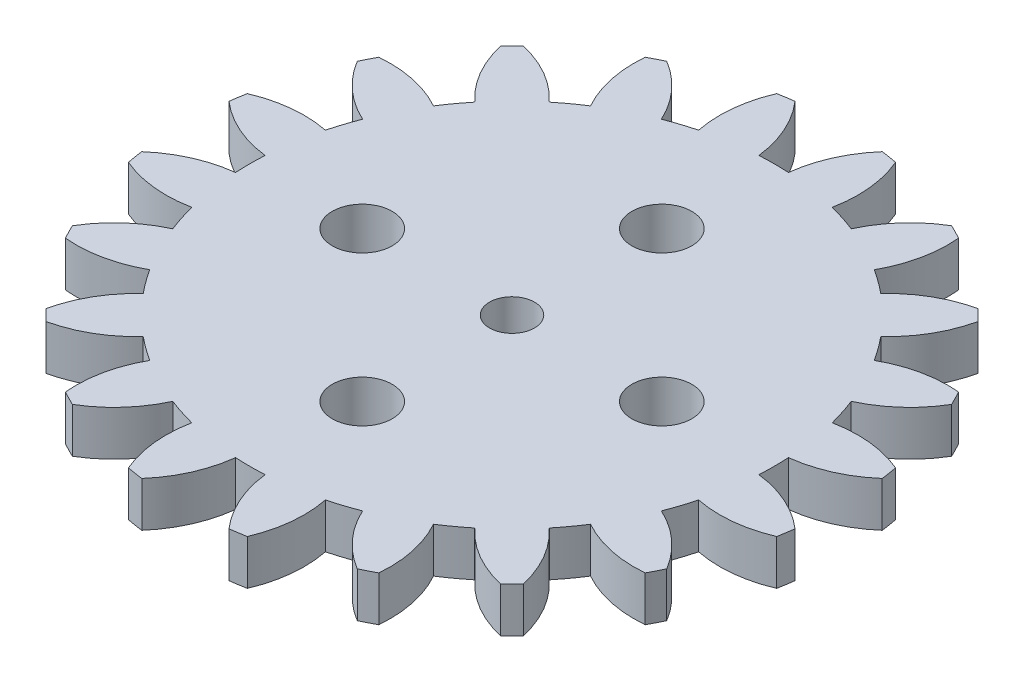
ISO-10303-21;
HEADER;
FILE_DESCRIPTION(('STEP AP214'),'2;1');
FILE_NAME('part.step','',(''),(''),'','','');
FILE_SCHEMA(('AUTOMOTIVE_DESIGN { 1 0 10303 214 1 1 1 1 }'));
ENDSEC;
DATA;
#1=APPLICATION_CONTEXT('core data for automotive mechanical design processes');
#2=APPLICATION_PROTOCOL_DEFINITION('international standard','automotive_design',2000,#1);
#3=PRODUCT_CONTEXT('',#1,'mechanical');
#4=PRODUCT('Part','Part','',(#3));
#5=PRODUCT_RELATED_PRODUCT_CATEGORY('part','',(#4));
#6=PRODUCT_DEFINITION_FORMATION('','',#4);
#7=PRODUCT_DEFINITION_CONTEXT('part definition',#1,'design');
#8=PRODUCT_DEFINITION('design','',#6,#7);
#9=PRODUCT_DEFINITION_SHAPE('','',#8);
#10=(LENGTH_UNIT() NAMED_UNIT(*) SI_UNIT(.MILLI.,.METRE.));
#11=(NAMED_UNIT(*) PLANE_ANGLE_UNIT() SI_UNIT($,.RADIAN.));
#12=(NAMED_UNIT(*) SI_UNIT($,.STERADIAN.) SOLID_ANGLE_UNIT());
#13=UNCERTAINTY_MEASURE_WITH_UNIT(LENGTH_MEASURE(1.E-05),#10,'distance_accuracy_value','');
#14=(GEOMETRIC_REPRESENTATION_CONTEXT(3) GLOBAL_UNCERTAINTY_ASSIGNED_CONTEXT((#13)) GLOBAL_UNIT_ASSIGNED_CONTEXT((#10,
#11,#12)) REPRESENTATION_CONTEXT('',''));
#15=CARTESIAN_POINT('',(0.,0.,0.));
#16=DIRECTION('',(0.,0.,1.));
#17=DIRECTION('',(1.,0.,0.));
#18=AXIS2_PLACEMENT_3D('',#15,#16,#17);
#19=CARTESIAN_POINT('',(-11.9535113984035,3.,-20.918644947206));
#20=DIRECTION('',(0.,-1.,0.));
#21=DIRECTION('',(0.,0.,-1.));
#22=AXIS2_PLACEMENT_3D('',#19,#20,#21);
#23=CYLINDRICAL_SURFACE('',#22,22.);
#24=CARTESIAN_POINT('',(-11.9535113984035,0.,-20.918644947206));
#25=DIRECTION('',(0.,1.,0.));
#26=DIRECTION('',(0.,0.,1.));
#27=AXIS2_PLACEMENT_3D('',#24,#25,#26);
#28=CIRCLE('',#27,22.);
#29=CARTESIAN_POINT('',(-33.5926400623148,0.,-24.8870338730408));
#30=VERTEX_POINT('',#29);
#31=CARTESIAN_POINT('',(-33.7598453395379,0.,-23.8313413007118));
#32=VERTEX_POINT('',#31);
#33=EDGE_CURVE('E576',#30,#32,#28,.T.);
#34=ORIENTED_EDGE('',*,*,#33,.T.);
#35=DIRECTION('',(0.,-1.,0.));
#36=VECTOR('',#35,1.);
#37=CARTESIAN_POINT('',(-33.7598453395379,3.,-23.8313413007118));
#38=LINE('',#37,#36);
#39=CARTESIAN_POINT('',(-33.7598453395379,3.,-23.8313413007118));
#40=VERTEX_POINT('',#39);
#41=EDGE_CURVE('E13',#40,#32,#38,.T.);
#42=ORIENTED_EDGE('',*,*,#41,.F.);
#43=CARTESIAN_POINT('',(-11.9535113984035,3.,-20.918644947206));
#44=DIRECTION('',(0.,1.,0.));
#45=DIRECTION('',(0.,0.,1.));
#46=AXIS2_PLACEMENT_3D('',#43,#44,#45);
#47=CIRCLE('',#46,22.);
#48=CARTESIAN_POINT('',(-33.5926400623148,3.,-24.8870338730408));
#49=VERTEX_POINT('',#48);
#50=EDGE_CURVE('E735',#49,#40,#47,.T.);
#51=ORIENTED_EDGE('',*,*,#50,.F.);
#52=DIRECTION('',(0.,-1.,0.));
#53=VECTOR('',#52,1.);
#54=CARTESIAN_POINT('',(-33.5926400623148,3.,-24.8870338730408));
#55=LINE('',#54,#53);
#56=EDGE_CURVE('E572',#49,#30,#55,.T.);
#57=ORIENTED_EDGE('',*,*,#56,.T.);
#58=EDGE_LOOP('',(#34,#42,#51,#57));
#59=FACE_BOUND('',#58,.T.);
#60=ADVANCED_FACE('F46',(#59),#23,.T.);
#61=CARTESIAN_POINT('',(-28.4895419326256,3.,-29.8499708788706));
#62=DIRECTION('',(0.,-1.,0.));
#63=DIRECTION('',(0.,0.,-1.));
#64=AXIS2_PLACEMENT_3D('',#61,#62,#63);
#65=CYLINDRICAL_SURFACE('',#64,8.);
#66=CARTESIAN_POINT('',(-28.4895419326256,0.,-29.8499708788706));
#67=DIRECTION('',(0.,1.,0.));
#68=DIRECTION('',(0.,0.,1.));
#69=AXIS2_PLACEMENT_3D('',#66,#67,#68);
#70=CIRCLE('',#69,8.);
#71=CARTESIAN_POINT('',(-29.4247010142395,0.,-21.9048165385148));
#72=VERTEX_POINT('',#71);
#73=EDGE_CURVE('E579',#32,#72,#70,.T.);
#74=ORIENTED_EDGE('',*,*,#73,.T.);
#75=DIRECTION('',(0.,-1.,0.));
#76=VECTOR('',#75,1.);
#77=CARTESIAN_POINT('',(-29.4247010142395,3.,-21.9048165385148));
#78=LINE('',#77,#76);
#79=CARTESIAN_POINT('',(-29.4247010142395,3.,-21.9048165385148));
#80=VERTEX_POINT('',#79);
#81=EDGE_CURVE('E55',#80,#72,#78,.T.);
#82=ORIENTED_EDGE('',*,*,#81,.F.);
#83=CARTESIAN_POINT('',(-28.4895419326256,3.,-29.8499708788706));
#84=DIRECTION('',(0.,1.,0.));
#85=DIRECTION('',(0.,0.,1.));
#86=AXIS2_PLACEMENT_3D('',#83,#84,#85);
#87=CIRCLE('',#86,8.);
#88=EDGE_CURVE('E323',#40,#80,#87,.T.);
#89=ORIENTED_EDGE('',*,*,#88,.F.);
#90=ORIENTED_EDGE('',*,*,#41,.T.);
#91=EDGE_LOOP('',(#74,#82,#89,#90));
#92=FACE_BOUND('',#91,.T.);
#93=ADVANCED_FACE('F1168',(#92),#65,.T.);
#94=CARTESIAN_POINT('',(-11.9535113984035,3.,-20.918644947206));
#95=DIRECTION('',(0.,-1.,0.));
#96=DIRECTION('',(0.,0.,-1.));
#97=AXIS2_PLACEMENT_3D('',#94,#95,#96);
#98=CYLINDRICAL_SURFACE('',#97,17.499);
#99=CARTESIAN_POINT('',(-11.9535113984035,0.,-20.918644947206));
#100=DIRECTION('',(0.,1.,0.));
#101=DIRECTION('',(0.,0.,1.));
#102=AXIS2_PLACEMENT_3D('',#99,#100,#101);
#103=CIRCLE('',#102,17.499);
#104=CARTESIAN_POINT('',(-29.4247010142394,0.,-19.9324733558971));
#105=VERTEX_POINT('',#104);
#106=EDGE_CURVE('E582',#72,#105,#103,.T.);
#107=ORIENTED_EDGE('',*,*,#106,.T.);
#108=DIRECTION('',(0.,-1.,0.));
#109=VECTOR('',#108,1.);
#110=CARTESIAN_POINT('',(-29.4247010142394,3.,-19.9324733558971));
#111=LINE('',#110,#109);
#112=CARTESIAN_POINT('',(-29.4247010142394,3.,-19.9324733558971));
#113=VERTEX_POINT('',#112);
#114=EDGE_CURVE('E958',#113,#105,#111,.T.);
#115=ORIENTED_EDGE('',*,*,#114,.F.);
#116=CARTESIAN_POINT('',(-11.9535113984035,3.,-20.918644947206));
#117=DIRECTION('',(0.,1.,0.));
#118=DIRECTION('',(0.,0.,1.));
#119=AXIS2_PLACEMENT_3D('',#116,#117,#118);
#120=CIRCLE('',#119,17.499);
#121=EDGE_CURVE('E992',#80,#113,#120,.T.);
#122=ORIENTED_EDGE('',*,*,#121,.F.);
#123=ORIENTED_EDGE('',*,*,#81,.T.);
#124=EDGE_LOOP('',(#107,#115,#122,#123));
#125=FACE_BOUND('',#124,.T.);
#126=ADVANCED_FACE('F1172',(#125),#98,.T.);
#127=CARTESIAN_POINT('',(-28.4895419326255,3.,-11.9873190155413));
#128=DIRECTION('',(0.,-1.,0.));
#129=DIRECTION('',(0.,0.,-1.));
#130=AXIS2_PLACEMENT_3D('',#127,#128,#129);
#131=CYLINDRICAL_SURFACE('',#130,8.);
#132=CARTESIAN_POINT('',(-28.4895419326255,0.,-11.9873190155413));
#133=DIRECTION('',(0.,1.,0.));
#134=DIRECTION('',(0.,0.,1.));
#135=AXIS2_PLACEMENT_3D('',#132,#133,#134);
#136=CIRCLE('',#135,8.);
#137=CARTESIAN_POINT('',(-33.7598453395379,0.,-18.0059485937));
#138=VERTEX_POINT('',#137);
#139=EDGE_CURVE('E584',#105,#138,#136,.T.);
#140=ORIENTED_EDGE('',*,*,#139,.T.);
#141=DIRECTION('',(0.,-1.,0.));
#142=VECTOR('',#141,1.);
#143=CARTESIAN_POINT('',(-33.7598453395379,3.,-18.0059485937));
#144=LINE('',#143,#142);
#145=CARTESIAN_POINT('',(-33.7598453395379,3.,-18.0059485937));
#146=VERTEX_POINT('',#145);
#147=EDGE_CURVE('E955',#146,#138,#144,.T.);
#148=ORIENTED_EDGE('',*,*,#147,.F.);
#149=CARTESIAN_POINT('',(-28.4895419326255,3.,-11.9873190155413));
#150=DIRECTION('',(0.,1.,0.));
#151=DIRECTION('',(0.,0.,1.));
#152=AXIS2_PLACEMENT_3D('',#149,#150,#151);
#153=CIRCLE('',#152,8.);
#154=EDGE_CURVE('E994',#113,#146,#153,.T.);
#155=ORIENTED_EDGE('',*,*,#154,.F.);
#156=ORIENTED_EDGE('',*,*,#114,.T.);
#157=EDGE_LOOP('',(#140,#148,#155,#156));
#158=FACE_BOUND('',#157,.T.);
#159=ADVANCED_FACE('F1176',(#158),#131,.T.);
#160=CARTESIAN_POINT('',(-11.9535113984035,3.,-20.918644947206));
#161=DIRECTION('',(0.,-1.,0.));
#162=DIRECTION('',(0.,0.,-1.));
#163=AXIS2_PLACEMENT_3D('',#160,#161,#162);
#164=CYLINDRICAL_SURFACE('',#163,22.);
#165=CARTESIAN_POINT('',(-11.9535113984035,0.,-20.918644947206));
#166=DIRECTION('',(0.,1.,0.));
#167=DIRECTION('',(0.,0.,1.));
#168=AXIS2_PLACEMENT_3D('',#165,#166,#167);
#169=CIRCLE('',#168,22.);
#170=CARTESIAN_POINT('',(-33.5926400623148,0.,-16.9502560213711));
#171=VERTEX_POINT('',#170);
#172=EDGE_CURVE('E586',#138,#171,#169,.T.);
#173=ORIENTED_EDGE('',*,*,#172,.T.);
#174=DIRECTION('',(0.,-1.,0.));
#175=VECTOR('',#174,1.);
#176=CARTESIAN_POINT('',(-33.5926400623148,3.,-16.9502560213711));
#177=LINE('',#176,#175);
#178=CARTESIAN_POINT('',(-33.5926400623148,3.,-16.9502560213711));
#179=VERTEX_POINT('',#178);
#180=EDGE_CURVE('E952',#179,#171,#177,.T.);
#181=ORIENTED_EDGE('',*,*,#180,.F.);
#182=CARTESIAN_POINT('',(-11.9535113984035,3.,-20.918644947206));
#183=DIRECTION('',(0.,1.,0.));
#184=DIRECTION('',(0.,0.,1.));
#185=AXIS2_PLACEMENT_3D('',#182,#183,#184);
#186=CIRCLE('',#185,22.);
#187=EDGE_CURVE('E996',#146,#179,#186,.T.);
#188=ORIENTED_EDGE('',*,*,#187,.F.);
#189=ORIENTED_EDGE('',*,*,#147,.T.);
#190=EDGE_LOOP('',(#173,#181,#188,#189));
#191=FACE_BOUND('',#190,.T.);
#192=ADVANCED_FACE('F1182',(#191),#164,.T.);
#193=CARTESIAN_POINT('',(-30.440142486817,3.,-24.3029262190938));
#194=DIRECTION('',(0.,-1.,0.));
#195=DIRECTION('',(0.,0.,-1.));
#196=AXIS2_PLACEMENT_3D('',#193,#194,#195);
#197=CYLINDRICAL_SURFACE('',#196,8.);
#198=CARTESIAN_POINT('',(-30.440142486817,0.,-24.3029262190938));
#199=DIRECTION('',(0.,1.,0.));
#200=DIRECTION('',(0.,0.,1.));
#201=AXIS2_PLACEMENT_3D('',#198,#199,#200);
#202=CIRCLE('',#201,8.);
#203=CARTESIAN_POINT('',(-28.8743439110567,0.,-16.4576553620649));
#204=VERTEX_POINT('',#203);
#205=EDGE_CURVE('E588',#171,#204,#202,.T.);
#206=ORIENTED_EDGE('',*,*,#205,.T.);
#207=DIRECTION('',(0.,-1.,0.));
#208=VECTOR('',#207,1.);
#209=CARTESIAN_POINT('',(-28.8743439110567,3.,-16.4576553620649));
#210=LINE('',#209,#208);
#211=CARTESIAN_POINT('',(-28.8743439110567,3.,-16.4576553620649));
#212=VERTEX_POINT('',#211);
#213=EDGE_CURVE('E949',#212,#204,#210,.T.);
#214=ORIENTED_EDGE('',*,*,#213,.F.);
#215=CARTESIAN_POINT('',(-30.440142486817,3.,-24.3029262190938));
#216=DIRECTION('',(0.,1.,0.));
#217=DIRECTION('',(0.,0.,1.));
#218=AXIS2_PLACEMENT_3D('',#215,#216,#217);
#219=CIRCLE('',#218,8.);
#220=EDGE_CURVE('E998',#179,#212,#219,.T.);
#221=ORIENTED_EDGE('',*,*,#220,.F.);
#222=ORIENTED_EDGE('',*,*,#180,.T.);
#223=EDGE_LOOP('',(#206,#214,#221,#222));
#224=FACE_BOUND('',#223,.T.);
#225=ADVANCED_FACE('F1186',(#224),#197,.T.);
#226=CARTESIAN_POINT('',(-11.9535113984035,3.,-20.918644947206));
#227=DIRECTION('',(0.,-1.,0.));
#228=DIRECTION('',(0.,0.,-1.));
#229=AXIS2_PLACEMENT_3D('',#226,#227,#228);
#230=CYLINDRICAL_SURFACE('',#229,17.499);
#231=CARTESIAN_POINT('',(-11.9535113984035,0.,-20.918644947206));
#232=DIRECTION('',(0.,1.,0.));
#233=DIRECTION('',(0.,0.,1.));
#234=AXIS2_PLACEMENT_3D('',#231,#232,#233);
#235=CIRCLE('',#234,17.499);
#236=CARTESIAN_POINT('',(-28.2648563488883,0.,-14.5818455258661));
#237=VERTEX_POINT('',#236);
#238=EDGE_CURVE('E590',#204,#237,#235,.T.);
#239=ORIENTED_EDGE('',*,*,#238,.T.);
#240=DIRECTION('',(0.,-1.,0.));
#241=VECTOR('',#240,1.);
#242=CARTESIAN_POINT('',(-28.2648563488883,3.,-14.5818455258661));
#243=LINE('',#242,#241);
#244=CARTESIAN_POINT('',(-28.2648563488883,3.,-14.5818455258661));
#245=VERTEX_POINT('',#244);
#246=EDGE_CURVE('E946',#245,#237,#243,.T.);
#247=ORIENTED_EDGE('',*,*,#246,.F.);
#248=CARTESIAN_POINT('',(-11.9535113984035,3.,-20.918644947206));
#249=DIRECTION('',(0.,1.,0.));
#250=DIRECTION('',(0.,0.,1.));
#251=AXIS2_PLACEMENT_3D('',#248,#249,#250);
#252=CIRCLE('',#251,17.499);
#253=EDGE_CURVE('E1000',#212,#245,#252,.T.);
#254=ORIENTED_EDGE('',*,*,#253,.F.);
#255=ORIENTED_EDGE('',*,*,#213,.T.);
#256=EDGE_LOOP('',(#239,#247,#254,#255));
#257=FACE_BOUND('',#256,.T.);
#258=ADVANCED_FACE('F1190',(#257),#230,.T.);
#259=CARTESIAN_POINT('',(-24.9202794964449,3.,-7.31453476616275));
#260=DIRECTION('',(0.,-1.,0.));
#261=DIRECTION('',(0.,0.,-1.));
#262=AXIS2_PLACEMENT_3D('',#259,#260,#261);
#263=CYLINDRICAL_SURFACE('',#262,8.);
#264=CARTESIAN_POINT('',(-24.9202794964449,0.,-7.31453476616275));
#265=DIRECTION('',(0.,1.,0.));
#266=DIRECTION('',(0.,0.,1.));
#267=AXIS2_PLACEMENT_3D('',#264,#265,#266);
#268=CIRCLE('',#267,8.);
#269=CARTESIAN_POINT('',(-31.7924947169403,0.,-11.4099783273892));
#270=VERTEX_POINT('',#269);
#271=EDGE_CURVE('E592',#237,#270,#268,.T.);
#272=ORIENTED_EDGE('',*,*,#271,.T.);
#273=DIRECTION('',(0.,-1.,0.));
#274=VECTOR('',#273,1.);
#275=CARTESIAN_POINT('',(-31.7924947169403,3.,-11.4099783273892));
#276=LINE('',#275,#274);
#277=CARTESIAN_POINT('',(-31.7924947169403,3.,-11.4099783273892));
#278=VERTEX_POINT('',#277);
#279=EDGE_CURVE('E943',#278,#270,#276,.T.);
#280=ORIENTED_EDGE('',*,*,#279,.F.);
#281=CARTESIAN_POINT('',(-24.9202794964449,3.,-7.31453476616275));
#282=DIRECTION('',(0.,1.,0.));
#283=DIRECTION('',(0.,0.,1.));
#284=AXIS2_PLACEMENT_3D('',#281,#282,#283);
#285=CIRCLE('',#284,8.);
#286=EDGE_CURVE('E1002',#245,#278,#285,.T.);
#287=ORIENTED_EDGE('',*,*,#286,.F.);
#288=ORIENTED_EDGE('',*,*,#246,.T.);
#289=EDGE_LOOP('',(#272,#280,#287,#288));
#290=FACE_BOUND('',#289,.T.);
#291=ADVANCED_FACE('F1194',(#290),#263,.T.);
#292=CARTESIAN_POINT('',(-11.9535113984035,3.,-20.918644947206));
#293=DIRECTION('',(0.,-1.,0.));
#294=DIRECTION('',(0.,0.,-1.));
#295=AXIS2_PLACEMENT_3D('',#292,#293,#294);
#296=CYLINDRICAL_SURFACE('',#295,22.);
#297=CARTESIAN_POINT('',(-11.9535113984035,0.,-20.918644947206));
#298=DIRECTION('',(0.,1.,0.));
#299=DIRECTION('',(0.,0.,1.));
#300=AXIS2_PLACEMENT_3D('',#297,#298,#299);
#301=CIRCLE('',#300,22.);
#302=CARTESIAN_POINT('',(-31.3072461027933,0.,-10.4576242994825));
#303=VERTEX_POINT('',#302);
#304=EDGE_CURVE('E594',#270,#303,#301,.T.);
#305=ORIENTED_EDGE('',*,*,#304,.T.);
#306=DIRECTION('',(0.,-1.,0.));
#307=VECTOR('',#306,1.);
#308=CARTESIAN_POINT('',(-31.3072461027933,3.,-10.4576242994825));
#309=LINE('',#308,#307);
#310=CARTESIAN_POINT('',(-31.3072461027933,3.,-10.4576242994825));
#311=VERTEX_POINT('',#310);
#312=EDGE_CURVE('E940',#311,#303,#309,.T.);
#313=ORIENTED_EDGE('',*,*,#312,.F.);
#314=CARTESIAN_POINT('',(-11.9535113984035,3.,-20.918644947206));
#315=DIRECTION('',(0.,1.,0.));
#316=DIRECTION('',(0.,0.,1.));
#317=AXIS2_PLACEMENT_3D('',#314,#315,#316);
#318=CIRCLE('',#317,22.);
#319=EDGE_CURVE('E1004',#278,#311,#318,.T.);
#320=ORIENTED_EDGE('',*,*,#319,.F.);
#321=ORIENTED_EDGE('',*,*,#279,.T.);
#322=EDGE_LOOP('',(#305,#313,#320,#321));
#323=FACE_BOUND('',#322,.T.);
#324=ADVANCED_FACE('F1198',(#323),#296,.T.);
#325=CARTESIAN_POINT('',(-30.581142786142,3.,-18.4246045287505));
#326=DIRECTION('',(0.,-1.,0.));
#327=DIRECTION('',(0.,0.,-1.));
#328=AXIS2_PLACEMENT_3D('',#325,#326,#327);
#329=CYLINDRICAL_SURFACE('',#328,8.);
#330=CARTESIAN_POINT('',(-30.581142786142,0.,-18.4246045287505));
#331=DIRECTION('',(0.,1.,0.));
#332=DIRECTION('',(0.,0.,1.));
#333=AXIS2_PLACEMENT_3D('',#330,#331,#332);
#334=CIRCLE('',#333,8.);
#335=CARTESIAN_POINT('',(-26.667657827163,0.,-11.4471669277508));
#336=VERTEX_POINT('',#335);
#337=EDGE_CURVE('E596',#303,#336,#334,.T.);
#338=ORIENTED_EDGE('',*,*,#337,.T.);
#339=DIRECTION('',(0.,-1.,0.));
#340=VECTOR('',#339,1.);
#341=CARTESIAN_POINT('',(-26.667657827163,3.,-11.4471669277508));
#342=LINE('',#341,#340);
#343=CARTESIAN_POINT('',(-26.667657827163,3.,-11.4471669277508));
#344=VERTEX_POINT('',#343);
#345=EDGE_CURVE('E937',#344,#336,#342,.T.);
#346=ORIENTED_EDGE('',*,*,#345,.F.);
#347=CARTESIAN_POINT('',(-30.581142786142,3.,-18.4246045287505));
#348=DIRECTION('',(0.,1.,0.));
#349=DIRECTION('',(0.,0.,1.));
#350=AXIS2_PLACEMENT_3D('',#347,#348,#349);
#351=CIRCLE('',#350,8.);
#352=EDGE_CURVE('E1006',#311,#344,#351,.T.);
#353=ORIENTED_EDGE('',*,*,#352,.F.);
#354=ORIENTED_EDGE('',*,*,#312,.T.);
#355=EDGE_LOOP('',(#338,#346,#353,#354));
#356=FACE_BOUND('',#355,.T.);
#357=ADVANCED_FACE('F1202',(#356),#329,.T.);
#358=CARTESIAN_POINT('',(-11.9535113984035,3.,-20.918644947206));
#359=DIRECTION('',(0.,-1.,0.));
#360=DIRECTION('',(0.,0.,-1.));
#361=AXIS2_PLACEMENT_3D('',#358,#359,#360);
#362=CYLINDRICAL_SURFACE('',#361,17.499);
#363=CARTESIAN_POINT('',(-11.9535113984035,0.,-20.918644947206));
#364=DIRECTION('',(0.,1.,0.));
#365=DIRECTION('',(0.,0.,1.));
#366=AXIS2_PLACEMENT_3D('',#363,#364,#365);
#367=CIRCLE('',#366,17.499);
#368=CARTESIAN_POINT('',(-25.5083435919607,0.,-9.85150777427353));
#369=VERTEX_POINT('',#368);
#370=EDGE_CURVE('E598',#336,#369,#367,.T.);
#371=ORIENTED_EDGE('',*,*,#370,.T.);
#372=DIRECTION('',(0.,-1.,0.));
#373=VECTOR('',#372,1.);
#374=CARTESIAN_POINT('',(-25.5083435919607,3.,-9.85150777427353));
#375=LINE('',#374,#373);
#376=CARTESIAN_POINT('',(-25.5083435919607,3.,-9.85150777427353));
#377=VERTEX_POINT('',#376);
#378=EDGE_CURVE('E934',#377,#369,#375,.T.);
#379=ORIENTED_EDGE('',*,*,#378,.F.);
#380=CARTESIAN_POINT('',(-11.9535113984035,3.,-20.918644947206));
#381=DIRECTION('',(0.,1.,0.));
#382=DIRECTION('',(0.,0.,1.));
#383=AXIS2_PLACEMENT_3D('',#380,#381,#382);
#384=CIRCLE('',#383,17.499);
#385=EDGE_CURVE('E1008',#344,#377,#384,.T.);
#386=ORIENTED_EDGE('',*,*,#385,.F.);
#387=ORIENTED_EDGE('',*,*,#345,.T.);
#388=EDGE_LOOP('',(#371,#379,#386,#387));
#389=FACE_BOUND('',#388,.T.);
#390=ADVANCED_FACE('F1206',(#389),#362,.T.);
#391=CARTESIAN_POINT('',(-20.0817394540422,3.,-3.97341560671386));
#392=DIRECTION('',(0.,-1.,0.));
#393=DIRECTION('',(0.,0.,-1.));
#394=AXIS2_PLACEMENT_3D('',#391,#392,#393);
#395=CYLINDRICAL_SURFACE('',#394,8.);
#396=CARTESIAN_POINT('',(-20.0817394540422,0.,-3.97341560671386));
#397=DIRECTION('',(0.,1.,0.));
#398=DIRECTION('',(0.,0.,1.));
#399=AXIS2_PLACEMENT_3D('',#396,#397,#398);
#400=CIRCLE('',#399,8.);
#401=CARTESIAN_POINT('',(-27.8831661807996,0.,-5.74478260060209));
#402=VERTEX_POINT('',#401);
#403=EDGE_CURVE('E600',#369,#402,#400,.T.);
#404=ORIENTED_EDGE('',*,*,#403,.T.);
#405=DIRECTION('',(0.,-1.,0.));
#406=VECTOR('',#405,1.);
#407=CARTESIAN_POINT('',(-27.8831661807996,3.,-5.74478260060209));
#408=LINE('',#407,#406);
#409=CARTESIAN_POINT('',(-27.8831661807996,3.,-5.74478260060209));
#410=VERTEX_POINT('',#409);
#411=EDGE_CURVE('E931',#410,#402,#408,.T.);
#412=ORIENTED_EDGE('',*,*,#411,.F.);
#413=CARTESIAN_POINT('',(-20.0817394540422,3.,-3.97341560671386));
#414=DIRECTION('',(0.,1.,0.));
#415=DIRECTION('',(0.,0.,1.));
#416=AXIS2_PLACEMENT_3D('',#413,#414,#415);
#417=CIRCLE('',#416,8.);
#418=EDGE_CURVE('E1010',#377,#410,#417,.T.);
#419=ORIENTED_EDGE('',*,*,#418,.F.);
#420=ORIENTED_EDGE('',*,*,#378,.T.);
#421=EDGE_LOOP('',(#404,#412,#419,#420));
#422=FACE_BOUND('',#421,.T.);
#423=ADVANCED_FACE('F1210',(#422),#395,.T.);
#424=CARTESIAN_POINT('',(-11.9535113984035,3.,-20.918644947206));
#425=DIRECTION('',(0.,-1.,0.));
#426=DIRECTION('',(0.,0.,-1.));
#427=AXIS2_PLACEMENT_3D('',#424,#425,#426);
#428=CYLINDRICAL_SURFACE('',#427,22.);
#429=CARTESIAN_POINT('',(-11.9535113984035,0.,-20.918644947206));
#430=DIRECTION('',(0.,1.,0.));
#431=DIRECTION('',(0.,0.,1.));
#432=AXIS2_PLACEMENT_3D('',#429,#430,#431);
#433=CIRCLE('',#432,22.);
#434=CARTESIAN_POINT('',(-27.1273737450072,0.,-4.98899016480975));
#435=VERTEX_POINT('',#434);
#436=EDGE_CURVE('E602',#402,#435,#433,.T.);
#437=ORIENTED_EDGE('',*,*,#436,.T.);
#438=DIRECTION('',(0.,-1.,0.));
#439=VECTOR('',#438,1.);
#440=CARTESIAN_POINT('',(-27.1273737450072,3.,-4.98899016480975));
#441=LINE('',#440,#439);
#442=CARTESIAN_POINT('',(-27.1273737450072,3.,-4.98899016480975));
#443=VERTEX_POINT('',#442);
#444=EDGE_CURVE('E928',#443,#435,#441,.T.);
#445=ORIENTED_EDGE('',*,*,#444,.F.);
#446=CARTESIAN_POINT('',(-11.9535113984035,3.,-20.918644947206));
#447=DIRECTION('',(0.,1.,0.));
#448=DIRECTION('',(0.,0.,1.));
#449=AXIS2_PLACEMENT_3D('',#446,#447,#448);
#450=CIRCLE('',#449,22.);
#451=EDGE_CURVE('E1012',#410,#443,#450,.T.);
#452=ORIENTED_EDGE('',*,*,#451,.F.);
#453=ORIENTED_EDGE('',*,*,#411,.T.);
#454=EDGE_LOOP('',(#437,#445,#452,#453));
#455=FACE_BOUND('',#454,.T.);
#456=ADVANCED_FACE('F1214',(#455),#428,.T.);
#457=CARTESIAN_POINT('',(-28.8987407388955,3.,-12.790416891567));
#458=DIRECTION('',(0.,-1.,0.));
#459=DIRECTION('',(0.,0.,-1.));
#460=AXIS2_PLACEMENT_3D('',#457,#458,#459);
#461=CYLINDRICAL_SURFACE('',#460,8.);
#462=CARTESIAN_POINT('',(-28.8987407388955,0.,-12.790416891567));
#463=DIRECTION('',(0.,1.,0.));
#464=DIRECTION('',(0.,0.,1.));
#465=AXIS2_PLACEMENT_3D('',#462,#463,#464);
#466=CIRCLE('',#465,8.);
#467=CARTESIAN_POINT('',(-23.0206485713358,0.,-7.36381275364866));
#468=VERTEX_POINT('',#467);
#469=EDGE_CURVE('E604',#435,#468,#466,.T.);
#470=ORIENTED_EDGE('',*,*,#469,.T.);
#471=DIRECTION('',(0.,-1.,0.));
#472=VECTOR('',#471,1.);
#473=CARTESIAN_POINT('',(-23.0206485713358,3.,-7.36381275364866));
#474=LINE('',#473,#472);
#475=CARTESIAN_POINT('',(-23.0206485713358,3.,-7.36381275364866));
#476=VERTEX_POINT('',#475);
#477=EDGE_CURVE('E925',#476,#468,#474,.T.);
#478=ORIENTED_EDGE('',*,*,#477,.F.);
#479=CARTESIAN_POINT('',(-28.8987407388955,3.,-12.790416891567));
#480=DIRECTION('',(0.,1.,0.));
#481=DIRECTION('',(0.,0.,1.));
#482=AXIS2_PLACEMENT_3D('',#479,#480,#481);
#483=CIRCLE('',#482,8.);
#484=EDGE_CURVE('E1014',#443,#476,#483,.T.);
#485=ORIENTED_EDGE('',*,*,#484,.F.);
#486=ORIENTED_EDGE('',*,*,#444,.T.);
#487=EDGE_LOOP('',(#470,#478,#485,#486));
#488=FACE_BOUND('',#487,.T.);
#489=ADVANCED_FACE('F1218',(#488),#461,.T.);
#490=CARTESIAN_POINT('',(-11.9535113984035,3.,-20.918644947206));
#491=DIRECTION('',(0.,-1.,0.));
#492=DIRECTION('',(0.,0.,-1.));
#493=AXIS2_PLACEMENT_3D('',#490,#491,#492);
#494=CYLINDRICAL_SURFACE('',#493,17.499);
#495=CARTESIAN_POINT('',(-11.9535113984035,0.,-20.918644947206));
#496=DIRECTION('',(0.,1.,0.));
#497=DIRECTION('',(0.,0.,1.));
#498=AXIS2_PLACEMENT_3D('',#495,#496,#497);
#499=CIRCLE('',#498,17.499);
#500=CARTESIAN_POINT('',(-21.4249894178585,0.,-6.2044985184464));
#501=VERTEX_POINT('',#500);
#502=EDGE_CURVE('E606',#468,#501,#499,.T.);
#503=ORIENTED_EDGE('',*,*,#502,.T.);
#504=DIRECTION('',(0.,-1.,0.));
#505=VECTOR('',#504,1.);
#506=CARTESIAN_POINT('',(-21.4249894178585,3.,-6.2044985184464));
#507=LINE('',#506,#505);
#508=CARTESIAN_POINT('',(-21.4249894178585,3.,-6.2044985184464));
#509=VERTEX_POINT('',#508);
#510=EDGE_CURVE('E922',#509,#501,#507,.T.);
#511=ORIENTED_EDGE('',*,*,#510,.F.);
#512=CARTESIAN_POINT('',(-11.9535113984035,3.,-20.918644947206));
#513=DIRECTION('',(0.,1.,0.));
#514=DIRECTION('',(0.,0.,1.));
#515=AXIS2_PLACEMENT_3D('',#512,#513,#514);
#516=CIRCLE('',#515,17.499);
#517=EDGE_CURVE('E1016',#476,#509,#516,.T.);
#518=ORIENTED_EDGE('',*,*,#517,.F.);
#519=ORIENTED_EDGE('',*,*,#477,.T.);
#520=EDGE_LOOP('',(#503,#511,#518,#519));
#521=FACE_BOUND('',#520,.T.);
#522=ADVANCED_FACE('F1222',(#521),#494,.T.);
#523=CARTESIAN_POINT('',(-14.4475518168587,3.,-2.29101355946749));
#524=DIRECTION('',(0.,-1.,0.));
#525=DIRECTION('',(0.,0.,-1.));
#526=AXIS2_PLACEMENT_3D('',#523,#524,#525);
#527=CYLINDRICAL_SURFACE('',#526,8.);
#528=CARTESIAN_POINT('',(-14.4475518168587,0.,-2.29101355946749));
#529=DIRECTION('',(0.,1.,0.));
#530=DIRECTION('',(0.,0.,1.));
#531=AXIS2_PLACEMENT_3D('',#528,#529,#530);
#532=CIRCLE('',#531,8.);
#533=CARTESIAN_POINT('',(-22.4145320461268,0.,-1.56491024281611));
#534=VERTEX_POINT('',#533);
#535=EDGE_CURVE('E608',#501,#534,#532,.T.);
#536=ORIENTED_EDGE('',*,*,#535,.T.);
#537=DIRECTION('',(0.,-1.,0.));
#538=VECTOR('',#537,1.);
#539=CARTESIAN_POINT('',(-22.4145320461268,3.,-1.56491024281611));
#540=LINE('',#539,#538);
#541=CARTESIAN_POINT('',(-22.4145320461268,3.,-1.56491024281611));
#542=VERTEX_POINT('',#541);
#543=EDGE_CURVE('E919',#542,#534,#540,.T.);
#544=ORIENTED_EDGE('',*,*,#543,.F.);
#545=CARTESIAN_POINT('',(-14.4475518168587,3.,-2.29101355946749));
#546=DIRECTION('',(0.,1.,0.));
#547=DIRECTION('',(0.,0.,1.));
#548=AXIS2_PLACEMENT_3D('',#545,#546,#547);
#549=CIRCLE('',#548,8.);
#550=EDGE_CURVE('E1018',#509,#542,#549,.T.);
#551=ORIENTED_EDGE('',*,*,#550,.F.);
#552=ORIENTED_EDGE('',*,*,#510,.T.);
#553=EDGE_LOOP('',(#536,#544,#551,#552));
#554=FACE_BOUND('',#553,.T.);
#555=ADVANCED_FACE('F1226',(#554),#527,.T.);
#556=CARTESIAN_POINT('',(-11.9535113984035,3.,-20.918644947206));
#557=DIRECTION('',(0.,-1.,0.));
#558=DIRECTION('',(0.,0.,-1.));
#559=AXIS2_PLACEMENT_3D('',#556,#557,#558);
#560=CYLINDRICAL_SURFACE('',#559,22.);
#561=CARTESIAN_POINT('',(-11.9535113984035,0.,-20.918644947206));
#562=DIRECTION('',(0.,1.,0.));
#563=DIRECTION('',(0.,0.,1.));
#564=AXIS2_PLACEMENT_3D('',#561,#562,#563);
#565=CIRCLE('',#564,22.);
#566=CARTESIAN_POINT('',(-21.46217801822,0.,-1.0796616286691));
#567=VERTEX_POINT('',#566);
#568=EDGE_CURVE('E610',#534,#567,#565,.T.);
#569=ORIENTED_EDGE('',*,*,#568,.T.);
#570=DIRECTION('',(0.,-1.,0.));
#571=VECTOR('',#570,1.);
#572=CARTESIAN_POINT('',(-21.46217801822,3.,-1.0796616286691));
#573=LINE('',#572,#571);
#574=CARTESIAN_POINT('',(-21.46217801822,3.,-1.0796616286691));
#575=VERTEX_POINT('',#574);
#576=EDGE_CURVE('E916',#575,#567,#573,.T.);
#577=ORIENTED_EDGE('',*,*,#576,.F.);
#578=CARTESIAN_POINT('',(-11.9535113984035,3.,-20.918644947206));
#579=DIRECTION('',(0.,1.,0.));
#580=DIRECTION('',(0.,0.,1.));
#581=AXIS2_PLACEMENT_3D('',#578,#579,#580);
#582=CIRCLE('',#581,22.);
#583=EDGE_CURVE('E1020',#542,#575,#582,.T.);
#584=ORIENTED_EDGE('',*,*,#583,.F.);
#585=ORIENTED_EDGE('',*,*,#543,.T.);
#586=EDGE_LOOP('',(#569,#577,#584,#585));
#587=FACE_BOUND('',#586,.T.);
#588=ADVANCED_FACE('F1230',(#587),#560,.T.);
#589=CARTESIAN_POINT('',(-25.5576215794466,3.,-7.95187684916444));
#590=DIRECTION('',(0.,-1.,0.));
#591=DIRECTION('',(0.,0.,-1.));
#592=AXIS2_PLACEMENT_3D('',#589,#590,#591);
#593=CYLINDRICAL_SURFACE('',#592,8.);
#594=CARTESIAN_POINT('',(-25.5576215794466,0.,-7.95187684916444));
#595=DIRECTION('',(0.,1.,0.));
#596=DIRECTION('',(0.,0.,1.));
#597=AXIS2_PLACEMENT_3D('',#594,#595,#596);
#598=CIRCLE('',#597,8.);
#599=CARTESIAN_POINT('',(-18.2903108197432,0.,-4.60729999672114));
#600=VERTEX_POINT('',#599);
#601=EDGE_CURVE('E612',#567,#600,#598,.T.);
#602=ORIENTED_EDGE('',*,*,#601,.T.);
#603=DIRECTION('',(0.,-1.,0.));
#604=VECTOR('',#603,1.);
#605=CARTESIAN_POINT('',(-18.2903108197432,3.,-4.60729999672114));
#606=LINE('',#605,#604);
#607=CARTESIAN_POINT('',(-18.2903108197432,3.,-4.60729999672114));
#608=VERTEX_POINT('',#607);
#609=EDGE_CURVE('E913',#608,#600,#606,.T.);
#610=ORIENTED_EDGE('',*,*,#609,.F.);
#611=CARTESIAN_POINT('',(-25.5576215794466,3.,-7.95187684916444));
#612=DIRECTION('',(0.,1.,0.));
#613=DIRECTION('',(0.,0.,1.));
#614=AXIS2_PLACEMENT_3D('',#611,#612,#613);
#615=CIRCLE('',#614,8.);
#616=EDGE_CURVE('E1022',#575,#608,#615,.T.);
#617=ORIENTED_EDGE('',*,*,#616,.F.);
#618=ORIENTED_EDGE('',*,*,#576,.T.);
#619=EDGE_LOOP('',(#602,#610,#617,#618));
#620=FACE_BOUND('',#619,.T.);
#621=ADVANCED_FACE('F1234',(#620),#593,.T.);
#622=CARTESIAN_POINT('',(-11.9535113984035,3.,-20.918644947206));
#623=DIRECTION('',(0.,-1.,0.));
#624=DIRECTION('',(0.,0.,-1.));
#625=AXIS2_PLACEMENT_3D('',#622,#623,#624);
#626=CYLINDRICAL_SURFACE('',#625,17.499);
#627=CARTESIAN_POINT('',(-11.9535113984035,0.,-20.918644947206));
#628=DIRECTION('',(0.,1.,0.));
#629=DIRECTION('',(0.,0.,1.));
#630=AXIS2_PLACEMENT_3D('',#627,#628,#629);
#631=CIRCLE('',#630,17.499);
#632=CARTESIAN_POINT('',(-16.4145009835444,0.,-3.99781243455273));
#633=VERTEX_POINT('',#632);
#634=EDGE_CURVE('E614',#600,#633,#631,.T.);
#635=ORIENTED_EDGE('',*,*,#634,.T.);
#636=DIRECTION('',(0.,-1.,0.));
#637=VECTOR('',#636,1.);
#638=CARTESIAN_POINT('',(-16.4145009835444,3.,-3.99781243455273));
#639=LINE('',#638,#637);
#640=CARTESIAN_POINT('',(-16.4145009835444,3.,-3.99781243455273));
#641=VERTEX_POINT('',#640);
#642=EDGE_CURVE('E910',#641,#633,#639,.T.);
#643=ORIENTED_EDGE('',*,*,#642,.F.);
#644=CARTESIAN_POINT('',(-11.9535113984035,3.,-20.918644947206));
#645=DIRECTION('',(0.,1.,0.));
#646=DIRECTION('',(0.,0.,1.));
#647=AXIS2_PLACEMENT_3D('',#644,#645,#646);
#648=CIRCLE('',#647,17.499);
#649=EDGE_CURVE('E1024',#608,#641,#648,.T.);
#650=ORIENTED_EDGE('',*,*,#649,.F.);
#651=ORIENTED_EDGE('',*,*,#609,.T.);
#652=EDGE_LOOP('',(#635,#643,#650,#651));
#653=FACE_BOUND('',#652,.T.);
#654=ADVANCED_FACE('F1238',(#653),#626,.T.);
#655=CARTESIAN_POINT('',(-8.56923012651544,3.,-2.43201385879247));
#656=DIRECTION('',(0.,-1.,0.));
#657=DIRECTION('',(0.,0.,-1.));
#658=AXIS2_PLACEMENT_3D('',#655,#656,#657);
#659=CYLINDRICAL_SURFACE('',#658,8.);
#660=CARTESIAN_POINT('',(-8.56923012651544,0.,-2.43201385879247));
#661=DIRECTION('',(0.,1.,0.));
#662=DIRECTION('',(0.,0.,1.));
#663=AXIS2_PLACEMENT_3D('',#660,#661,#662);
#664=CIRCLE('',#663,8.);
#665=CARTESIAN_POINT('',(-15.9219003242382,0.,0.720483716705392));
#666=VERTEX_POINT('',#665);
#667=EDGE_CURVE('E616',#633,#666,#664,.T.);
#668=ORIENTED_EDGE('',*,*,#667,.T.);
#669=DIRECTION('',(0.,-1.,0.));
#670=VECTOR('',#669,1.);
#671=CARTESIAN_POINT('',(-15.9219003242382,3.,0.720483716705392));
#672=LINE('',#671,#670);
#673=CARTESIAN_POINT('',(-15.9219003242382,3.,0.720483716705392));
#674=VERTEX_POINT('',#673);
#675=EDGE_CURVE('E907',#674,#666,#672,.T.);
#676=ORIENTED_EDGE('',*,*,#675,.F.);
#677=CARTESIAN_POINT('',(-8.56923012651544,3.,-2.43201385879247));
#678=DIRECTION('',(0.,1.,0.));
#679=DIRECTION('',(0.,0.,1.));
#680=AXIS2_PLACEMENT_3D('',#677,#678,#679);
#681=CIRCLE('',#680,8.);
#682=EDGE_CURVE('E1026',#641,#674,#681,.T.);
#683=ORIENTED_EDGE('',*,*,#682,.F.);
#684=ORIENTED_EDGE('',*,*,#642,.T.);
#685=EDGE_LOOP('',(#668,#676,#683,#684));
#686=FACE_BOUND('',#685,.T.);
#687=ADVANCED_FACE('F1242',(#686),#659,.T.);
#688=CARTESIAN_POINT('',(-11.9535113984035,3.,-20.918644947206));
#689=DIRECTION('',(0.,-1.,0.));
#690=DIRECTION('',(0.,0.,-1.));
#691=AXIS2_PLACEMENT_3D('',#688,#689,#690);
#692=CYLINDRICAL_SURFACE('',#691,22.);
#693=CARTESIAN_POINT('',(-11.9535113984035,0.,-20.918644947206));
#694=DIRECTION('',(0.,1.,0.));
#695=DIRECTION('',(0.,0.,1.));
#696=AXIS2_PLACEMENT_3D('',#693,#694,#695);
#697=CIRCLE('',#696,22.);
#698=CARTESIAN_POINT('',(-14.8662077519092,0.,0.887688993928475));
#699=VERTEX_POINT('',#698);
#700=EDGE_CURVE('E618',#666,#699,#697,.T.);
#701=ORIENTED_EDGE('',*,*,#700,.T.);
#702=DIRECTION('',(0.,-1.,0.));
#703=VECTOR('',#702,1.);
#704=CARTESIAN_POINT('',(-14.8662077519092,3.,0.887688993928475));
#705=LINE('',#704,#703);
#706=CARTESIAN_POINT('',(-14.8662077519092,3.,0.887688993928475));
#707=VERTEX_POINT('',#706);
#708=EDGE_CURVE('E904',#707,#699,#705,.T.);
#709=ORIENTED_EDGE('',*,*,#708,.F.);
#710=CARTESIAN_POINT('',(-11.9535113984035,3.,-20.918644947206));
#711=DIRECTION('',(0.,1.,0.));
#712=DIRECTION('',(0.,0.,1.));
#713=AXIS2_PLACEMENT_3D('',#710,#711,#712);
#714=CIRCLE('',#713,22.);
#715=EDGE_CURVE('E1028',#674,#707,#714,.T.);
#716=ORIENTED_EDGE('',*,*,#715,.F.);
#717=ORIENTED_EDGE('',*,*,#675,.T.);
#718=EDGE_LOOP('',(#701,#709,#716,#717));
#719=FACE_BOUND('',#718,.T.);
#720=ADVANCED_FACE('F1246',(#719),#692,.T.);
#721=CARTESIAN_POINT('',(-20.884837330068,3.,-4.38261441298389));
#722=DIRECTION('',(0.,-1.,0.));
#723=DIRECTION('',(0.,0.,-1.));
#724=AXIS2_PLACEMENT_3D('',#721,#722,#723);
#725=CYLINDRICAL_SURFACE('',#724,8.);
#726=CARTESIAN_POINT('',(-20.884837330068,0.,-4.38261441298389));
#727=DIRECTION('',(0.,1.,0.));
#728=DIRECTION('',(0.,0.,1.));
#729=AXIS2_PLACEMENT_3D('',#726,#727,#728);
#730=CIRCLE('',#729,8.);
#731=CARTESIAN_POINT('',(-12.9396829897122,0.,-3.44745533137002));
#732=VERTEX_POINT('',#731);
#733=EDGE_CURVE('E620',#699,#732,#730,.T.);
#734=ORIENTED_EDGE('',*,*,#733,.T.);
#735=DIRECTION('',(0.,-1.,0.));
#736=VECTOR('',#735,1.);
#737=CARTESIAN_POINT('',(-12.9396829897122,3.,-3.44745533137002));
#738=LINE('',#737,#736);
#739=CARTESIAN_POINT('',(-12.9396829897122,3.,-3.44745533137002));
#740=VERTEX_POINT('',#739);
#741=EDGE_CURVE('E901',#740,#732,#738,.T.);
#742=ORIENTED_EDGE('',*,*,#741,.F.);
#743=CARTESIAN_POINT('',(-20.884837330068,3.,-4.38261441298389));
#744=DIRECTION('',(0.,1.,0.));
#745=DIRECTION('',(0.,0.,1.));
#746=AXIS2_PLACEMENT_3D('',#743,#744,#745);
#747=CIRCLE('',#746,8.);
#748=EDGE_CURVE('E1030',#707,#740,#747,.T.);
#749=ORIENTED_EDGE('',*,*,#748,.F.);
#750=ORIENTED_EDGE('',*,*,#708,.T.);
#751=EDGE_LOOP('',(#734,#742,#749,#750));
#752=FACE_BOUND('',#751,.T.);
#753=ADVANCED_FACE('F1250',(#752),#725,.T.);
#754=CARTESIAN_POINT('',(-11.9535113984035,3.,-20.918644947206));
#755=DIRECTION('',(0.,-1.,0.));
#756=DIRECTION('',(0.,0.,-1.));
#757=AXIS2_PLACEMENT_3D('',#754,#755,#756);
#758=CYLINDRICAL_SURFACE('',#757,17.499);
#759=CARTESIAN_POINT('',(-11.9535113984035,0.,-20.918644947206));
#760=DIRECTION('',(0.,1.,0.));
#761=DIRECTION('',(0.,0.,1.));
#762=AXIS2_PLACEMENT_3D('',#759,#760,#761);
#763=CIRCLE('',#762,17.499);
#764=CARTESIAN_POINT('',(-10.9673398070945,0.,-3.44745533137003));
#765=VERTEX_POINT('',#764);
#766=EDGE_CURVE('E622',#732,#765,#763,.T.);
#767=ORIENTED_EDGE('',*,*,#766,.T.);
#768=DIRECTION('',(0.,-1.,0.));
#769=VECTOR('',#768,1.);
#770=CARTESIAN_POINT('',(-10.9673398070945,3.,-3.44745533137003));
#771=LINE('',#770,#769);
#772=CARTESIAN_POINT('',(-10.9673398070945,3.,-3.44745533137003));
#773=VERTEX_POINT('',#772);
#774=EDGE_CURVE('E898',#773,#765,#771,.T.);
#775=ORIENTED_EDGE('',*,*,#774,.F.);
#776=CARTESIAN_POINT('',(-11.9535113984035,3.,-20.918644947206));
#777=DIRECTION('',(0.,1.,0.));
#778=DIRECTION('',(0.,0.,1.));
#779=AXIS2_PLACEMENT_3D('',#776,#777,#778);
#780=CIRCLE('',#779,17.499);
#781=EDGE_CURVE('E1032',#740,#773,#780,.T.);
#782=ORIENTED_EDGE('',*,*,#781,.F.);
#783=ORIENTED_EDGE('',*,*,#741,.T.);
#784=EDGE_LOOP('',(#767,#775,#782,#783));
#785=FACE_BOUND('',#784,.T.);
#786=ADVANCED_FACE('F1254',(#785),#758,.T.);
#787=CARTESIAN_POINT('',(-3.02218546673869,3.,-4.38261441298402));
#788=DIRECTION('',(0.,-1.,0.));
#789=DIRECTION('',(0.,0.,-1.));
#790=AXIS2_PLACEMENT_3D('',#787,#788,#789);
#791=CYLINDRICAL_SURFACE('',#790,8.);
#792=CARTESIAN_POINT('',(-3.02218546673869,0.,-4.38261441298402));
#793=DIRECTION('',(0.,1.,0.));
#794=DIRECTION('',(0.,0.,1.));
#795=AXIS2_PLACEMENT_3D('',#792,#793,#794);
#796=CIRCLE('',#795,8.);
#797=CARTESIAN_POINT('',(-9.04081504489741,0.,0.887688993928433));
#798=VERTEX_POINT('',#797);
#799=EDGE_CURVE('E624',#765,#798,#796,.T.);
#800=ORIENTED_EDGE('',*,*,#799,.T.);
#801=DIRECTION('',(0.,-1.,0.));
#802=VECTOR('',#801,1.);
#803=CARTESIAN_POINT('',(-9.04081504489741,3.,0.887688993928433));
#804=LINE('',#803,#802);
#805=CARTESIAN_POINT('',(-9.04081504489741,3.,0.887688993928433));
#806=VERTEX_POINT('',#805);
#807=EDGE_CURVE('E895',#806,#798,#804,.T.);
#808=ORIENTED_EDGE('',*,*,#807,.F.);
#809=CARTESIAN_POINT('',(-3.02218546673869,3.,-4.38261441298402));
#810=DIRECTION('',(0.,1.,0.));
#811=DIRECTION('',(0.,0.,1.));
#812=AXIS2_PLACEMENT_3D('',#809,#810,#811);
#813=CIRCLE('',#812,8.);
#814=EDGE_CURVE('E1034',#773,#806,#813,.T.);
#815=ORIENTED_EDGE('',*,*,#814,.F.);
#816=ORIENTED_EDGE('',*,*,#774,.T.);
#817=EDGE_LOOP('',(#800,#808,#815,#816));
#818=FACE_BOUND('',#817,.T.);
#819=ADVANCED_FACE('F1258',(#818),#791,.T.);
#820=CARTESIAN_POINT('',(-11.9535113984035,3.,-20.918644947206));
#821=DIRECTION('',(0.,-1.,0.));
#822=DIRECTION('',(0.,0.,-1.));
#823=AXIS2_PLACEMENT_3D('',#820,#821,#822);
#824=CYLINDRICAL_SURFACE('',#823,22.);
#825=CARTESIAN_POINT('',(-11.9535113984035,0.,-20.918644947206));
#826=DIRECTION('',(0.,1.,0.));
#827=DIRECTION('',(0.,0.,1.));
#828=AXIS2_PLACEMENT_3D('',#825,#826,#827);
#829=CIRCLE('',#828,22.);
#830=CARTESIAN_POINT('',(-7.98512247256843,0.,0.720483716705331));
#831=VERTEX_POINT('',#830);
#832=EDGE_CURVE('E626',#798,#831,#829,.T.);
#833=ORIENTED_EDGE('',*,*,#832,.T.);
#834=DIRECTION('',(0.,-1.,0.));
#835=VECTOR('',#834,1.);
#836=CARTESIAN_POINT('',(-7.98512247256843,3.,0.720483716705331));
#837=LINE('',#836,#835);
#838=CARTESIAN_POINT('',(-7.98512247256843,3.,0.720483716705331));
#839=VERTEX_POINT('',#838);
#840=EDGE_CURVE('E892',#839,#831,#837,.T.);
#841=ORIENTED_EDGE('',*,*,#840,.F.);
#842=CARTESIAN_POINT('',(-11.9535113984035,3.,-20.918644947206));
#843=DIRECTION('',(0.,1.,0.));
#844=DIRECTION('',(0.,0.,1.));
#845=AXIS2_PLACEMENT_3D('',#842,#843,#844);
#846=CIRCLE('',#845,22.);
#847=EDGE_CURVE('E1036',#806,#839,#846,.T.);
#848=ORIENTED_EDGE('',*,*,#847,.F.);
#849=ORIENTED_EDGE('',*,*,#807,.T.);
#850=EDGE_LOOP('',(#833,#841,#848,#849));
#851=FACE_BOUND('',#850,.T.);
#852=ADVANCED_FACE('F1262',(#851),#824,.T.);
#853=CARTESIAN_POINT('',(-15.3377926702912,3.,-2.43201385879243));
#854=DIRECTION('',(0.,-1.,0.));
#855=DIRECTION('',(0.,0.,-1.));
#856=AXIS2_PLACEMENT_3D('',#853,#854,#855);
#857=CYLINDRICAL_SURFACE('',#856,8.);
#858=CARTESIAN_POINT('',(-15.3377926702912,0.,-2.43201385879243));
#859=DIRECTION('',(0.,1.,0.));
#860=DIRECTION('',(0.,0.,1.));
#861=AXIS2_PLACEMENT_3D('',#858,#859,#860);
#862=CIRCLE('',#861,8.);
#863=CARTESIAN_POINT('',(-7.49252181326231,0.,-3.9978124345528));
#864=VERTEX_POINT('',#863);
#865=EDGE_CURVE('E628',#831,#864,#862,.T.);
#866=ORIENTED_EDGE('',*,*,#865,.T.);
#867=DIRECTION('',(0.,-1.,0.));
#868=VECTOR('',#867,1.);
#869=CARTESIAN_POINT('',(-7.49252181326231,3.,-3.9978124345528));
#870=LINE('',#869,#868);
#871=CARTESIAN_POINT('',(-7.49252181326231,3.,-3.9978124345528));
#872=VERTEX_POINT('',#871);
#873=EDGE_CURVE('E889',#872,#864,#870,.T.);
#874=ORIENTED_EDGE('',*,*,#873,.F.);
#875=CARTESIAN_POINT('',(-15.3377926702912,3.,-2.43201385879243));
#876=DIRECTION('',(0.,1.,0.));
#877=DIRECTION('',(0.,0.,1.));
#878=AXIS2_PLACEMENT_3D('',#875,#876,#877);
#879=CIRCLE('',#878,8.);
#880=EDGE_CURVE('E1038',#839,#872,#879,.T.);
#881=ORIENTED_EDGE('',*,*,#880,.F.);
#882=ORIENTED_EDGE('',*,*,#840,.T.);
#883=EDGE_LOOP('',(#866,#874,#881,#882));
#884=FACE_BOUND('',#883,.T.);
#885=ADVANCED_FACE('F1266',(#884),#857,.T.);
#886=CARTESIAN_POINT('',(-11.9535113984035,3.,-20.918644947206));
#887=DIRECTION('',(0.,-1.,0.));
#888=DIRECTION('',(0.,0.,-1.));
#889=AXIS2_PLACEMENT_3D('',#886,#887,#888);
#890=CYLINDRICAL_SURFACE('',#889,17.499);
#891=CARTESIAN_POINT('',(-11.9535113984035,0.,-20.918644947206));
#892=DIRECTION('',(0.,1.,0.));
#893=DIRECTION('',(0.,0.,1.));
#894=AXIS2_PLACEMENT_3D('',#891,#892,#893);
#895=CIRCLE('',#894,17.499);
#896=CARTESIAN_POINT('',(-5.61671197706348,0.,-4.60729999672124));
#897=VERTEX_POINT('',#896);
#898=EDGE_CURVE('E630',#864,#897,#895,.T.);
#899=ORIENTED_EDGE('',*,*,#898,.T.);
#900=DIRECTION('',(0.,-1.,0.));
#901=VECTOR('',#900,1.);
#902=CARTESIAN_POINT('',(-5.61671197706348,3.,-4.60729999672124));
#903=LINE('',#902,#901);
#904=CARTESIAN_POINT('',(-5.61671197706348,3.,-4.60729999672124));
#905=VERTEX_POINT('',#904);
#906=EDGE_CURVE('E886',#905,#897,#903,.T.);
#907=ORIENTED_EDGE('',*,*,#906,.F.);
#908=CARTESIAN_POINT('',(-11.9535113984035,3.,-20.918644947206));
#909=DIRECTION('',(0.,1.,0.));
#910=DIRECTION('',(0.,0.,1.));
#911=AXIS2_PLACEMENT_3D('',#908,#909,#910);
#912=CIRCLE('',#911,17.499);
#913=EDGE_CURVE('E1040',#872,#905,#912,.T.);
#914=ORIENTED_EDGE('',*,*,#913,.F.);
#915=ORIENTED_EDGE('',*,*,#873,.T.);
#916=EDGE_LOOP('',(#899,#907,#914,#915));
#917=FACE_BOUND('',#916,.T.);
#918=ADVANCED_FACE('F1270',(#917),#890,.T.);
#919=CARTESIAN_POINT('',(1.65059878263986,3.,-7.95187684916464));
#920=DIRECTION('',(0.,-1.,0.));
#921=DIRECTION('',(0.,0.,-1.));
#922=AXIS2_PLACEMENT_3D('',#919,#920,#921);
#923=CYLINDRICAL_SURFACE('',#922,8.);
#924=CARTESIAN_POINT('',(1.65059878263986,0.,-7.95187684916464));
#925=DIRECTION('',(0.,1.,0.));
#926=DIRECTION('',(0.,0.,1.));
#927=AXIS2_PLACEMENT_3D('',#924,#925,#926);
#928=CIRCLE('',#927,8.);
#929=CARTESIAN_POINT('',(-2.44484477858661,0.,-1.07966162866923));
#930=VERTEX_POINT('',#929);
#931=EDGE_CURVE('E632',#897,#930,#928,.T.);
#932=ORIENTED_EDGE('',*,*,#931,.T.);
#933=DIRECTION('',(0.,-1.,0.));
#934=VECTOR('',#933,1.);
#935=CARTESIAN_POINT('',(-2.44484477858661,3.,-1.07966162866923));
#936=LINE('',#935,#934);
#937=CARTESIAN_POINT('',(-2.44484477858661,3.,-1.07966162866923));
#938=VERTEX_POINT('',#937);
#939=EDGE_CURVE('E883',#938,#930,#936,.T.);
#940=ORIENTED_EDGE('',*,*,#939,.F.);
#941=CARTESIAN_POINT('',(1.65059878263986,3.,-7.95187684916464));
#942=DIRECTION('',(0.,1.,0.));
#943=DIRECTION('',(0.,0.,1.));
#944=AXIS2_PLACEMENT_3D('',#941,#942,#943);
#945=CIRCLE('',#944,8.);
#946=EDGE_CURVE('E1042',#905,#938,#945,.T.);
#947=ORIENTED_EDGE('',*,*,#946,.F.);
#948=ORIENTED_EDGE('',*,*,#906,.T.);
#949=EDGE_LOOP('',(#932,#940,#947,#948));
#950=FACE_BOUND('',#949,.T.);
#951=ADVANCED_FACE('F1274',(#950),#923,.T.);
#952=CARTESIAN_POINT('',(-11.9535113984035,3.,-20.918644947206));
#953=DIRECTION('',(0.,-1.,0.));
#954=DIRECTION('',(0.,0.,-1.));
#955=AXIS2_PLACEMENT_3D('',#952,#953,#954);
#956=CYLINDRICAL_SURFACE('',#955,22.);
#957=CARTESIAN_POINT('',(-11.9535113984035,0.,-20.918644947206));
#958=DIRECTION('',(0.,1.,0.));
#959=DIRECTION('',(0.,0.,1.));
#960=AXIS2_PLACEMENT_3D('',#957,#958,#959);
#961=CIRCLE('',#960,22.);
#962=CARTESIAN_POINT('',(-1.49249075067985,0.,-1.56491024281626));
#963=VERTEX_POINT('',#962);
#964=EDGE_CURVE('E634',#930,#963,#961,.T.);
#965=ORIENTED_EDGE('',*,*,#964,.T.);
#966=DIRECTION('',(0.,-1.,0.));
#967=VECTOR('',#966,1.);
#968=CARTESIAN_POINT('',(-1.49249075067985,3.,-1.56491024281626));
#969=LINE('',#968,#967);
#970=CARTESIAN_POINT('',(-1.49249075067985,3.,-1.56491024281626));
#971=VERTEX_POINT('',#970);
#972=EDGE_CURVE('E880',#971,#963,#969,.T.);
#973=ORIENTED_EDGE('',*,*,#972,.F.);
#974=CARTESIAN_POINT('',(-11.9535113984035,3.,-20.918644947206));
#975=DIRECTION('',(0.,1.,0.));
#976=DIRECTION('',(0.,0.,1.));
#977=AXIS2_PLACEMENT_3D('',#974,#975,#976);
#978=CIRCLE('',#977,22.);
#979=EDGE_CURVE('E1044',#938,#971,#978,.T.);
#980=ORIENTED_EDGE('',*,*,#979,.F.);
#981=ORIENTED_EDGE('',*,*,#939,.T.);
#982=EDGE_LOOP('',(#965,#973,#980,#981));
#983=FACE_BOUND('',#982,.T.);
#984=ADVANCED_FACE('F1278',(#983),#956,.T.);
#985=CARTESIAN_POINT('',(-9.4594709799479,3.,-2.29101355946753));
#986=DIRECTION('',(0.,-1.,0.));
#987=DIRECTION('',(0.,0.,-1.));
#988=AXIS2_PLACEMENT_3D('',#985,#986,#987);
#989=CYLINDRICAL_SURFACE('',#988,8.);
#990=CARTESIAN_POINT('',(-9.4594709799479,0.,-2.29101355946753));
#991=DIRECTION('',(0.,1.,0.));
#992=DIRECTION('',(0.,0.,1.));
#993=AXIS2_PLACEMENT_3D('',#990,#991,#992);
#994=CIRCLE('',#993,8.);
#995=CARTESIAN_POINT('',(-2.48203337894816,0.,-6.20449851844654));
#996=VERTEX_POINT('',#995);
#997=EDGE_CURVE('E636',#963,#996,#994,.T.);
#998=ORIENTED_EDGE('',*,*,#997,.T.);
#999=DIRECTION('',(0.,-1.,0.));
#1000=VECTOR('',#999,1.);
#1001=CARTESIAN_POINT('',(-2.48203337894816,3.,-6.20449851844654));
#1002=LINE('',#1001,#1000);
#1003=CARTESIAN_POINT('',(-2.48203337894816,3.,-6.20449851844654));
#1004=VERTEX_POINT('',#1003);
#1005=EDGE_CURVE('E877',#1004,#996,#1002,.T.);
#1006=ORIENTED_EDGE('',*,*,#1005,.F.);
#1007=CARTESIAN_POINT('',(-9.4594709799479,3.,-2.29101355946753));
#1008=DIRECTION('',(0.,1.,0.));
#1009=DIRECTION('',(0.,0.,1.));
#1010=AXIS2_PLACEMENT_3D('',#1007,#1008,#1009);
#1011=CIRCLE('',#1010,8.);
#1012=EDGE_CURVE('E1046',#971,#1004,#1011,.T.);
#1013=ORIENTED_EDGE('',*,*,#1012,.F.);
#1014=ORIENTED_EDGE('',*,*,#972,.T.);
#1015=EDGE_LOOP('',(#998,#1006,#1013,#1014));
#1016=FACE_BOUND('',#1015,.T.);
#1017=ADVANCED_FACE('F1282',(#1016),#989,.T.);
#1018=CARTESIAN_POINT('',(-11.9535113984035,3.,-20.918644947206));
#1019=DIRECTION('',(0.,-1.,0.));
#1020=DIRECTION('',(0.,0.,-1.));
#1021=AXIS2_PLACEMENT_3D('',#1018,#1019,#1020);
#1022=CYLINDRICAL_SURFACE('',#1021,17.499);
#1023=CARTESIAN_POINT('',(-11.9535113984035,0.,-20.918644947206));
#1024=DIRECTION('',(0.,1.,0.));
#1025=DIRECTION('',(0.,0.,1.));
#1026=AXIS2_PLACEMENT_3D('',#1023,#1024,#1025);
#1027=CIRCLE('',#1026,17.499);
#1028=CARTESIAN_POINT('',(-0.886374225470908,0.,-7.36381275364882));
#1029=VERTEX_POINT('',#1028);
#1030=EDGE_CURVE('E638',#996,#1029,#1027,.T.);
#1031=ORIENTED_EDGE('',*,*,#1030,.T.);
#1032=DIRECTION('',(0.,-1.,0.));
#1033=VECTOR('',#1032,1.);
#1034=CARTESIAN_POINT('',(-0.886374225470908,3.,-7.36381275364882));
#1035=LINE('',#1034,#1033);
#1036=CARTESIAN_POINT('',(-0.886374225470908,3.,-7.36381275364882));
#1037=VERTEX_POINT('',#1036);
#1038=EDGE_CURVE('E874',#1037,#1029,#1035,.T.);
#1039=ORIENTED_EDGE('',*,*,#1038,.F.);
#1040=CARTESIAN_POINT('',(-11.9535113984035,3.,-20.918644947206));
#1041=DIRECTION('',(0.,1.,0.));
#1042=DIRECTION('',(0.,0.,1.));
#1043=AXIS2_PLACEMENT_3D('',#1040,#1041,#1042);
#1044=CIRCLE('',#1043,17.499);
#1045=EDGE_CURVE('E1048',#1004,#1037,#1044,.T.);
#1046=ORIENTED_EDGE('',*,*,#1045,.F.);
#1047=ORIENTED_EDGE('',*,*,#1005,.T.);
#1048=EDGE_LOOP('',(#1031,#1039,#1046,#1047));
#1049=FACE_BOUND('',#1048,.T.);
#1050=ADVANCED_FACE('F1286',(#1049),#1022,.T.);
#1051=CARTESIAN_POINT('',(4.99171794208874,3.,-12.7904168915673));
#1052=DIRECTION('',(0.,-1.,0.));
#1053=DIRECTION('',(0.,0.,-1.));
#1054=AXIS2_PLACEMENT_3D('',#1051,#1052,#1053);
#1055=CYLINDRICAL_SURFACE('',#1054,8.);
#1056=CARTESIAN_POINT('',(4.99171794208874,0.,-12.7904168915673));
#1057=DIRECTION('',(0.,1.,0.));
#1058=DIRECTION('',(0.,0.,1.));
#1059=AXIS2_PLACEMENT_3D('',#1056,#1057,#1058);
#1060=CIRCLE('',#1059,8.);
#1061=CARTESIAN_POINT('',(3.22035094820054,0.,-4.98899016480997));
#1062=VERTEX_POINT('',#1061);
#1063=EDGE_CURVE('E640',#1029,#1062,#1060,.T.);
#1064=ORIENTED_EDGE('',*,*,#1063,.T.);
#1065=DIRECTION('',(0.,-1.,0.));
#1066=VECTOR('',#1065,1.);
#1067=CARTESIAN_POINT('',(3.22035094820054,3.,-4.98899016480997));
#1068=LINE('',#1067,#1066);
#1069=CARTESIAN_POINT('',(3.22035094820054,3.,-4.98899016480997));
#1070=VERTEX_POINT('',#1069);
#1071=EDGE_CURVE('E871',#1070,#1062,#1068,.T.);
#1072=ORIENTED_EDGE('',*,*,#1071,.F.);
#1073=CARTESIAN_POINT('',(4.99171794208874,3.,-12.7904168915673));
#1074=DIRECTION('',(0.,1.,0.));
#1075=DIRECTION('',(0.,0.,1.));
#1076=AXIS2_PLACEMENT_3D('',#1073,#1074,#1075);
#1077=CIRCLE('',#1076,8.);
#1078=EDGE_CURVE('E1050',#1037,#1070,#1077,.T.);
#1079=ORIENTED_EDGE('',*,*,#1078,.F.);
#1080=ORIENTED_EDGE('',*,*,#1038,.T.);
#1081=EDGE_LOOP('',(#1064,#1072,#1079,#1080));
#1082=FACE_BOUND('',#1081,.T.);
#1083=ADVANCED_FACE('F1290',(#1082),#1055,.T.);
#1084=CARTESIAN_POINT('',(-11.9535113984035,3.,-20.918644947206));
#1085=DIRECTION('',(0.,-1.,0.));
#1086=DIRECTION('',(0.,0.,-1.));
#1087=AXIS2_PLACEMENT_3D('',#1084,#1085,#1086);
#1088=CYLINDRICAL_SURFACE('',#1087,22.);
#1089=CARTESIAN_POINT('',(-11.9535113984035,0.,-20.918644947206));
#1090=DIRECTION('',(0.,1.,0.));
#1091=DIRECTION('',(0.,0.,1.));
#1092=AXIS2_PLACEMENT_3D('',#1089,#1090,#1091);
#1093=CIRCLE('',#1092,22.);
#1094=CARTESIAN_POINT('',(3.97614338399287,0.,-5.74478260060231));
#1095=VERTEX_POINT('',#1094);
#1096=EDGE_CURVE('E642',#1062,#1095,#1093,.T.);
#1097=ORIENTED_EDGE('',*,*,#1096,.T.);
#1098=DIRECTION('',(0.,-1.,0.));
#1099=VECTOR('',#1098,1.);
#1100=CARTESIAN_POINT('',(3.97614338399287,3.,-5.74478260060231));
#1101=LINE('',#1100,#1099);
#1102=CARTESIAN_POINT('',(3.97614338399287,3.,-5.74478260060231));
#1103=VERTEX_POINT('',#1102);
#1104=EDGE_CURVE('E868',#1103,#1095,#1101,.T.);
#1105=ORIENTED_EDGE('',*,*,#1104,.F.);
#1106=CARTESIAN_POINT('',(-11.9535113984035,3.,-20.918644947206));
#1107=DIRECTION('',(0.,1.,0.));
#1108=DIRECTION('',(0.,0.,1.));
#1109=AXIS2_PLACEMENT_3D('',#1106,#1107,#1108);
#1110=CIRCLE('',#1109,22.);
#1111=EDGE_CURVE('E1052',#1070,#1103,#1110,.T.);
#1112=ORIENTED_EDGE('',*,*,#1111,.F.);
#1113=ORIENTED_EDGE('',*,*,#1071,.T.);
#1114=EDGE_LOOP('',(#1097,#1105,#1112,#1113));
#1115=FACE_BOUND('',#1114,.T.);
#1116=ADVANCED_FACE('F1294',(#1115),#1088,.T.);
#1117=CARTESIAN_POINT('',(-3.82528334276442,3.,-3.97341560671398));
#1118=DIRECTION('',(0.,-1.,0.));
#1119=DIRECTION('',(0.,0.,-1.));
#1120=AXIS2_PLACEMENT_3D('',#1117,#1118,#1119);
#1121=CYLINDRICAL_SURFACE('',#1120,8.);
#1122=CARTESIAN_POINT('',(-3.82528334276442,0.,-3.97341560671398));
#1123=DIRECTION('',(0.,1.,0.));
#1124=DIRECTION('',(0.,0.,1.));
#1125=AXIS2_PLACEMENT_3D('',#1122,#1123,#1124);
#1126=CIRCLE('',#1125,8.);
#1127=CARTESIAN_POINT('',(1.60132079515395,0.,-9.85150777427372));
#1128=VERTEX_POINT('',#1127);
#1129=EDGE_CURVE('E644',#1095,#1128,#1126,.T.);
#1130=ORIENTED_EDGE('',*,*,#1129,.T.);
#1131=DIRECTION('',(0.,-1.,0.));
#1132=VECTOR('',#1131,1.);
#1133=CARTESIAN_POINT('',(1.60132079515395,3.,-9.85150777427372));
#1134=LINE('',#1133,#1132);
#1135=CARTESIAN_POINT('',(1.60132079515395,3.,-9.85150777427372));
#1136=VERTEX_POINT('',#1135);
#1137=EDGE_CURVE('E865',#1136,#1128,#1134,.T.);
#1138=ORIENTED_EDGE('',*,*,#1137,.F.);
#1139=CARTESIAN_POINT('',(-3.82528334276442,3.,-3.97341560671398));
#1140=DIRECTION('',(0.,1.,0.));
#1141=DIRECTION('',(0.,0.,1.));
#1142=AXIS2_PLACEMENT_3D('',#1139,#1140,#1141);
#1143=CIRCLE('',#1142,8.);
#1144=EDGE_CURVE('E1054',#1103,#1136,#1143,.T.);
#1145=ORIENTED_EDGE('',*,*,#1144,.F.);
#1146=ORIENTED_EDGE('',*,*,#1104,.T.);
#1147=EDGE_LOOP('',(#1130,#1138,#1145,#1146));
#1148=FACE_BOUND('',#1147,.T.);
#1149=ADVANCED_FACE('F1298',(#1148),#1121,.T.);
#1150=CARTESIAN_POINT('',(-11.9535113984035,3.,-20.918644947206));
#1151=DIRECTION('',(0.,-1.,0.));
#1152=DIRECTION('',(0.,0.,-1.));
#1153=AXIS2_PLACEMENT_3D('',#1150,#1151,#1152);
#1154=CYLINDRICAL_SURFACE('',#1153,17.499);
#1155=CARTESIAN_POINT('',(-11.9535113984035,0.,-20.918644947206));
#1156=DIRECTION('',(0.,1.,0.));
#1157=DIRECTION('',(0.,0.,1.));
#1158=AXIS2_PLACEMENT_3D('',#1155,#1156,#1157);
#1159=CIRCLE('',#1158,17.499);
#1160=CARTESIAN_POINT('',(2.7606350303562,0.,-11.447166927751));
#1161=VERTEX_POINT('',#1160);
#1162=EDGE_CURVE('E646',#1128,#1161,#1159,.T.);
#1163=ORIENTED_EDGE('',*,*,#1162,.T.);
#1164=DIRECTION('',(0.,-1.,0.));
#1165=VECTOR('',#1164,1.);
#1166=CARTESIAN_POINT('',(2.7606350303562,3.,-11.447166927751));
#1167=LINE('',#1166,#1165);
#1168=CARTESIAN_POINT('',(2.7606350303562,3.,-11.447166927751));
#1169=VERTEX_POINT('',#1168);
#1170=EDGE_CURVE('E862',#1169,#1161,#1167,.T.);
#1171=ORIENTED_EDGE('',*,*,#1170,.F.);
#1172=CARTESIAN_POINT('',(-11.9535113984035,3.,-20.918644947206));
#1173=DIRECTION('',(0.,1.,0.));
#1174=DIRECTION('',(0.,0.,1.));
#1175=AXIS2_PLACEMENT_3D('',#1172,#1173,#1174);
#1176=CIRCLE('',#1175,17.499);
#1177=EDGE_CURVE('E1056',#1136,#1169,#1176,.T.);
#1178=ORIENTED_EDGE('',*,*,#1177,.F.);
#1179=ORIENTED_EDGE('',*,*,#1137,.T.);
#1180=EDGE_LOOP('',(#1163,#1171,#1178,#1179));
#1181=FACE_BOUND('',#1180,.T.);
#1182=ADVANCED_FACE('F1302',(#1181),#1154,.T.);
#1183=CARTESIAN_POINT('',(6.67411998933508,3.,-18.4246045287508));
#1184=DIRECTION('',(0.,-1.,0.));
#1185=DIRECTION('',(0.,0.,-1.));
#1186=AXIS2_PLACEMENT_3D('',#1183,#1184,#1185);
#1187=CYLINDRICAL_SURFACE('',#1186,8.);
#1188=CARTESIAN_POINT('',(6.67411998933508,0.,-18.4246045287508));
#1189=DIRECTION('',(0.,1.,0.));
#1190=DIRECTION('',(0.,0.,1.));
#1191=AXIS2_PLACEMENT_3D('',#1188,#1189,#1190);
#1192=CIRCLE('',#1191,8.);
#1193=CARTESIAN_POINT('',(7.40022330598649,0.,-10.4576242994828));
#1194=VERTEX_POINT('',#1193);
#1195=EDGE_CURVE('E648',#1161,#1194,#1192,.T.);
#1196=ORIENTED_EDGE('',*,*,#1195,.T.);
#1197=DIRECTION('',(0.,-1.,0.));
#1198=VECTOR('',#1197,1.);
#1199=CARTESIAN_POINT('',(7.40022330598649,3.,-10.4576242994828));
#1200=LINE('',#1199,#1198);
#1201=CARTESIAN_POINT('',(7.40022330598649,3.,-10.4576242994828));
#1202=VERTEX_POINT('',#1201);
#1203=EDGE_CURVE('E859',#1202,#1194,#1200,.T.);
#1204=ORIENTED_EDGE('',*,*,#1203,.F.);
#1205=CARTESIAN_POINT('',(6.67411998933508,3.,-18.4246045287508));
#1206=DIRECTION('',(0.,1.,0.));
#1207=DIRECTION('',(0.,0.,1.));
#1208=AXIS2_PLACEMENT_3D('',#1205,#1206,#1207);
#1209=CIRCLE('',#1208,8.);
#1210=EDGE_CURVE('E1058',#1169,#1202,#1209,.T.);
#1211=ORIENTED_EDGE('',*,*,#1210,.F.);
#1212=ORIENTED_EDGE('',*,*,#1170,.T.);
#1213=EDGE_LOOP('',(#1196,#1204,#1211,#1212));
#1214=FACE_BOUND('',#1213,.T.);
#1215=ADVANCED_FACE('F1306',(#1214),#1187,.T.);
#1216=CARTESIAN_POINT('',(-11.9535113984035,3.,-20.918644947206));
#1217=DIRECTION('',(0.,-1.,0.));
#1218=DIRECTION('',(0.,0.,-1.));
#1219=AXIS2_PLACEMENT_3D('',#1216,#1217,#1218);
#1220=CYLINDRICAL_SURFACE('',#1219,22.);
#1221=CARTESIAN_POINT('',(-11.9535113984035,0.,-20.918644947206));
#1222=DIRECTION('',(0.,1.,0.));
#1223=DIRECTION('',(0.,0.,1.));
#1224=AXIS2_PLACEMENT_3D('',#1221,#1222,#1223);
#1225=CIRCLE('',#1224,22.);
#1226=CARTESIAN_POINT('',(7.88547192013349,0.,-11.4099783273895));
#1227=VERTEX_POINT('',#1226);
#1228=EDGE_CURVE('E650',#1194,#1227,#1225,.T.);
#1229=ORIENTED_EDGE('',*,*,#1228,.T.);
#1230=DIRECTION('',(0.,-1.,0.));
#1231=VECTOR('',#1230,1.);
#1232=CARTESIAN_POINT('',(7.88547192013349,3.,-11.4099783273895));
#1233=LINE('',#1232,#1231);
#1234=CARTESIAN_POINT('',(7.88547192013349,3.,-11.4099783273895));
#1235=VERTEX_POINT('',#1234);
#1236=EDGE_CURVE('E856',#1235,#1227,#1233,.T.);
#1237=ORIENTED_EDGE('',*,*,#1236,.F.);
#1238=CARTESIAN_POINT('',(-11.9535113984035,3.,-20.918644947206));
#1239=DIRECTION('',(0.,1.,0.));
#1240=DIRECTION('',(0.,0.,1.));
#1241=AXIS2_PLACEMENT_3D('',#1238,#1239,#1240);
#1242=CIRCLE('',#1241,22.);
#1243=EDGE_CURVE('E1060',#1202,#1235,#1242,.T.);
#1244=ORIENTED_EDGE('',*,*,#1243,.F.);
#1245=ORIENTED_EDGE('',*,*,#1203,.T.);
#1246=EDGE_LOOP('',(#1229,#1237,#1244,#1245));
#1247=FACE_BOUND('',#1246,.T.);
#1248=ADVANCED_FACE('F1310',(#1247),#1220,.T.);
#1249=CARTESIAN_POINT('',(1.01325669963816,3.,-7.31453476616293));
#1250=DIRECTION('',(0.,-1.,0.));
#1251=DIRECTION('',(0.,0.,-1.));
#1252=AXIS2_PLACEMENT_3D('',#1249,#1250,#1251);
#1253=CYLINDRICAL_SURFACE('',#1252,8.);
#1254=CARTESIAN_POINT('',(1.01325669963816,0.,-7.31453476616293));
#1255=DIRECTION('',(0.,1.,0.));
#1256=DIRECTION('',(0.,0.,1.));
#1257=AXIS2_PLACEMENT_3D('',#1254,#1255,#1256);
#1258=CIRCLE('',#1257,8.);
#1259=CARTESIAN_POINT('',(4.35783355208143,0.,-14.5818455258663));
#1260=VERTEX_POINT('',#1259);
#1261=EDGE_CURVE('E652',#1227,#1260,#1258,.T.);
#1262=ORIENTED_EDGE('',*,*,#1261,.T.);
#1263=DIRECTION('',(0.,-1.,0.));
#1264=VECTOR('',#1263,1.);
#1265=CARTESIAN_POINT('',(4.35783355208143,3.,-14.5818455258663));
#1266=LINE('',#1265,#1264);
#1267=CARTESIAN_POINT('',(4.35783355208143,3.,-14.5818455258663));
#1268=VERTEX_POINT('',#1267);
#1269=EDGE_CURVE('E853',#1268,#1260,#1266,.T.);
#1270=ORIENTED_EDGE('',*,*,#1269,.F.);
#1271=CARTESIAN_POINT('',(1.01325669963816,3.,-7.31453476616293));
#1272=DIRECTION('',(0.,1.,0.));
#1273=DIRECTION('',(0.,0.,1.));
#1274=AXIS2_PLACEMENT_3D('',#1271,#1272,#1273);
#1275=CIRCLE('',#1274,8.);
#1276=EDGE_CURVE('E1062',#1235,#1268,#1275,.T.);
#1277=ORIENTED_EDGE('',*,*,#1276,.F.);
#1278=ORIENTED_EDGE('',*,*,#1236,.T.);
#1279=EDGE_LOOP('',(#1262,#1270,#1277,#1278));
#1280=FACE_BOUND('',#1279,.T.);
#1281=ADVANCED_FACE('F1314',(#1280),#1253,.T.);
#1282=CARTESIAN_POINT('',(-11.9535113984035,3.,-20.918644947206));
#1283=DIRECTION('',(0.,-1.,0.));
#1284=DIRECTION('',(0.,0.,-1.));
#1285=AXIS2_PLACEMENT_3D('',#1282,#1283,#1284);
#1286=CYLINDRICAL_SURFACE('',#1285,17.499);
#1287=CARTESIAN_POINT('',(-11.9535113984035,0.,-20.918644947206));
#1288=DIRECTION('',(0.,1.,0.));
#1289=DIRECTION('',(0.,0.,1.));
#1290=AXIS2_PLACEMENT_3D('',#1287,#1288,#1289);
#1291=CIRCLE('',#1290,17.499);
#1292=CARTESIAN_POINT('',(4.96732111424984,0.,-16.4576553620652));
#1293=VERTEX_POINT('',#1292);
#1294=EDGE_CURVE('E654',#1260,#1293,#1291,.T.);
#1295=ORIENTED_EDGE('',*,*,#1294,.T.);
#1296=DIRECTION('',(0.,-1.,0.));
#1297=VECTOR('',#1296,1.);
#1298=CARTESIAN_POINT('',(4.96732111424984,3.,-16.4576553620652));
#1299=LINE('',#1298,#1297);
#1300=CARTESIAN_POINT('',(4.96732111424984,3.,-16.4576553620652));
#1301=VERTEX_POINT('',#1300);
#1302=EDGE_CURVE('E850',#1301,#1293,#1299,.T.);
#1303=ORIENTED_EDGE('',*,*,#1302,.F.);
#1304=CARTESIAN_POINT('',(-11.9535113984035,3.,-20.918644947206));
#1305=DIRECTION('',(0.,1.,0.));
#1306=DIRECTION('',(0.,0.,1.));
#1307=AXIS2_PLACEMENT_3D('',#1304,#1305,#1306);
#1308=CIRCLE('',#1307,17.499);
#1309=EDGE_CURVE('E1064',#1268,#1301,#1308,.T.);
#1310=ORIENTED_EDGE('',*,*,#1309,.F.);
#1311=ORIENTED_EDGE('',*,*,#1269,.T.);
#1312=EDGE_LOOP('',(#1295,#1303,#1310,#1311));
#1313=FACE_BOUND('',#1312,.T.);
#1314=ADVANCED_FACE('F1318',(#1313),#1286,.T.);
#1315=CARTESIAN_POINT('',(6.53311969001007,3.,-24.3029262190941));
#1316=DIRECTION('',(0.,-1.,0.));
#1317=DIRECTION('',(0.,0.,-1.));
#1318=AXIS2_PLACEMENT_3D('',#1315,#1316,#1317);
#1319=CYLINDRICAL_SURFACE('',#1318,8.);
#1320=CARTESIAN_POINT('',(6.53311969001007,0.,-24.3029262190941));
#1321=DIRECTION('',(0.,1.,0.));
#1322=DIRECTION('',(0.,0.,1.));
#1323=AXIS2_PLACEMENT_3D('',#1320,#1321,#1322);
#1324=CIRCLE('',#1323,8.);
#1325=CARTESIAN_POINT('',(9.68561726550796,0.,-16.9502560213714));
#1326=VERTEX_POINT('',#1325);
#1327=EDGE_CURVE('E656',#1293,#1326,#1324,.T.);
#1328=ORIENTED_EDGE('',*,*,#1327,.T.);
#1329=DIRECTION('',(0.,-1.,0.));
#1330=VECTOR('',#1329,1.);
#1331=CARTESIAN_POINT('',(9.68561726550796,3.,-16.9502560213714));
#1332=LINE('',#1331,#1330);
#1333=CARTESIAN_POINT('',(9.68561726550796,3.,-16.9502560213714));
#1334=VERTEX_POINT('',#1333);
#1335=EDGE_CURVE('E847',#1334,#1326,#1332,.T.);
#1336=ORIENTED_EDGE('',*,*,#1335,.F.);
#1337=CARTESIAN_POINT('',(6.53311969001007,3.,-24.3029262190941));
#1338=DIRECTION('',(0.,1.,0.));
#1339=DIRECTION('',(0.,0.,1.));
#1340=AXIS2_PLACEMENT_3D('',#1337,#1338,#1339);
#1341=CIRCLE('',#1340,8.);
#1342=EDGE_CURVE('E1066',#1301,#1334,#1341,.T.);
#1343=ORIENTED_EDGE('',*,*,#1342,.F.);
#1344=ORIENTED_EDGE('',*,*,#1302,.T.);
#1345=EDGE_LOOP('',(#1328,#1336,#1343,#1344));
#1346=FACE_BOUND('',#1345,.T.);
#1347=ADVANCED_FACE('F1322',(#1346),#1319,.T.);
#1348=CARTESIAN_POINT('',(-11.9535113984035,3.,-20.918644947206));
#1349=DIRECTION('',(0.,-1.,0.));
#1350=DIRECTION('',(0.,0.,-1.));
#1351=AXIS2_PLACEMENT_3D('',#1348,#1349,#1350);
#1352=CYLINDRICAL_SURFACE('',#1351,22.);
#1353=CARTESIAN_POINT('',(-11.9535113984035,0.,-20.918644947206));
#1354=DIRECTION('',(0.,1.,0.));
#1355=DIRECTION('',(0.,0.,1.));
#1356=AXIS2_PLACEMENT_3D('',#1353,#1354,#1355);
#1357=CIRCLE('',#1356,22.);
#1358=CARTESIAN_POINT('',(9.85282254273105,0.,-18.0059485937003));
#1359=VERTEX_POINT('',#1358);
#1360=EDGE_CURVE('E658',#1326,#1359,#1357,.T.);
#1361=ORIENTED_EDGE('',*,*,#1360,.T.);
#1362=DIRECTION('',(0.,-1.,0.));
#1363=VECTOR('',#1362,1.);
#1364=CARTESIAN_POINT('',(9.85282254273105,3.,-18.0059485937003));
#1365=LINE('',#1364,#1363);
#1366=CARTESIAN_POINT('',(9.85282254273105,3.,-18.0059485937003));
#1367=VERTEX_POINT('',#1366);
#1368=EDGE_CURVE('E844',#1367,#1359,#1365,.T.);
#1369=ORIENTED_EDGE('',*,*,#1368,.F.);
#1370=CARTESIAN_POINT('',(-11.9535113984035,3.,-20.918644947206));
#1371=DIRECTION('',(0.,1.,0.));
#1372=DIRECTION('',(0.,0.,1.));
#1373=AXIS2_PLACEMENT_3D('',#1370,#1371,#1372);
#1374=CIRCLE('',#1373,22.);
#1375=EDGE_CURVE('E1068',#1334,#1367,#1374,.T.);
#1376=ORIENTED_EDGE('',*,*,#1375,.F.);
#1377=ORIENTED_EDGE('',*,*,#1335,.T.);
#1378=EDGE_LOOP('',(#1361,#1369,#1376,#1377));
#1379=FACE_BOUND('',#1378,.T.);
#1380=ADVANCED_FACE('F1326',(#1379),#1352,.T.);
#1381=CARTESIAN_POINT('',(4.5825191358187,3.,-11.9873190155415));
#1382=DIRECTION('',(0.,-1.,0.));
#1383=DIRECTION('',(0.,0.,-1.));
#1384=AXIS2_PLACEMENT_3D('',#1381,#1382,#1383);
#1385=CYLINDRICAL_SURFACE('',#1384,8.);
#1386=CARTESIAN_POINT('',(4.5825191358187,0.,-11.9873190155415));
#1387=DIRECTION('',(0.,1.,0.));
#1388=DIRECTION('',(0.,0.,1.));
#1389=AXIS2_PLACEMENT_3D('',#1386,#1387,#1388);
#1390=CIRCLE('',#1389,8.);
#1391=CARTESIAN_POINT('',(5.51767821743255,0.,-19.9324733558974));
#1392=VERTEX_POINT('',#1391);
#1393=EDGE_CURVE('E660',#1359,#1392,#1390,.T.);
#1394=ORIENTED_EDGE('',*,*,#1393,.T.);
#1395=DIRECTION('',(0.,-1.,0.));
#1396=VECTOR('',#1395,1.);
#1397=CARTESIAN_POINT('',(5.51767821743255,3.,-19.9324733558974));
#1398=LINE('',#1397,#1396);
#1399=CARTESIAN_POINT('',(5.51767821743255,3.,-19.9324733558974));
#1400=VERTEX_POINT('',#1399);
#1401=EDGE_CURVE('E841',#1400,#1392,#1398,.T.);
#1402=ORIENTED_EDGE('',*,*,#1401,.F.);
#1403=CARTESIAN_POINT('',(4.5825191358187,3.,-11.9873190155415));
#1404=DIRECTION('',(0.,1.,0.));
#1405=DIRECTION('',(0.,0.,1.));
#1406=AXIS2_PLACEMENT_3D('',#1403,#1404,#1405);
#1407=CIRCLE('',#1406,8.);
#1408=EDGE_CURVE('E1070',#1367,#1400,#1407,.T.);
#1409=ORIENTED_EDGE('',*,*,#1408,.F.);
#1410=ORIENTED_EDGE('',*,*,#1368,.T.);
#1411=EDGE_LOOP('',(#1394,#1402,#1409,#1410));
#1412=FACE_BOUND('',#1411,.T.);
#1413=ADVANCED_FACE('F1330',(#1412),#1385,.T.);
#1414=CARTESIAN_POINT('',(-11.9535113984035,3.,-20.918644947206));
#1415=DIRECTION('',(0.,-1.,0.));
#1416=DIRECTION('',(0.,0.,-1.));
#1417=AXIS2_PLACEMENT_3D('',#1414,#1415,#1416);
#1418=CYLINDRICAL_SURFACE('',#1417,17.499);
#1419=CARTESIAN_POINT('',(-11.9535113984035,0.,-20.918644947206));
#1420=DIRECTION('',(0.,1.,0.));
#1421=DIRECTION('',(0.,0.,1.));
#1422=AXIS2_PLACEMENT_3D('',#1419,#1420,#1421);
#1423=CIRCLE('',#1422,17.499);
#1424=CARTESIAN_POINT('',(5.51767821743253,0.,-21.904816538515));
#1425=VERTEX_POINT('',#1424);
#1426=EDGE_CURVE('E662',#1392,#1425,#1423,.T.);
#1427=ORIENTED_EDGE('',*,*,#1426,.T.);
#1428=DIRECTION('',(0.,-1.,0.));
#1429=VECTOR('',#1428,1.);
#1430=CARTESIAN_POINT('',(5.51767821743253,3.,-21.904816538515));
#1431=LINE('',#1430,#1429);
#1432=CARTESIAN_POINT('',(5.51767821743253,3.,-21.904816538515));
#1433=VERTEX_POINT('',#1432);
#1434=EDGE_CURVE('E838',#1433,#1425,#1431,.T.);
#1435=ORIENTED_EDGE('',*,*,#1434,.F.);
#1436=CARTESIAN_POINT('',(-11.9535113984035,3.,-20.918644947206));
#1437=DIRECTION('',(0.,1.,0.));
#1438=DIRECTION('',(0.,0.,1.));
#1439=AXIS2_PLACEMENT_3D('',#1436,#1437,#1438);
#1440=CIRCLE('',#1439,17.499);
#1441=EDGE_CURVE('E1072',#1400,#1433,#1440,.T.);
#1442=ORIENTED_EDGE('',*,*,#1441,.F.);
#1443=ORIENTED_EDGE('',*,*,#1401,.T.);
#1444=EDGE_LOOP('',(#1427,#1435,#1442,#1443));
#1445=FACE_BOUND('',#1444,.T.);
#1446=ADVANCED_FACE('F1334',(#1445),#1418,.T.);
#1447=CARTESIAN_POINT('',(4.58251913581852,3.,-29.8499708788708));
#1448=DIRECTION('',(0.,-1.,0.));
#1449=DIRECTION('',(0.,0.,-1.));
#1450=AXIS2_PLACEMENT_3D('',#1447,#1448,#1449);
#1451=CYLINDRICAL_SURFACE('',#1450,8.);
#1452=CARTESIAN_POINT('',(4.58251913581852,0.,-29.8499708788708));
#1453=DIRECTION('',(0.,1.,0.));
#1454=DIRECTION('',(0.,0.,1.));
#1455=AXIS2_PLACEMENT_3D('',#1452,#1453,#1454);
#1456=CIRCLE('',#1455,8.);
#1457=CARTESIAN_POINT('',(9.85282254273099,0.,-23.8313413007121));
#1458=VERTEX_POINT('',#1457);
#1459=EDGE_CURVE('E664',#1425,#1458,#1456,.T.);
#1460=ORIENTED_EDGE('',*,*,#1459,.T.);
#1461=DIRECTION('',(0.,-1.,0.));
#1462=VECTOR('',#1461,1.);
#1463=CARTESIAN_POINT('',(9.85282254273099,3.,-23.8313413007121));
#1464=LINE('',#1463,#1462);
#1465=CARTESIAN_POINT('',(9.85282254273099,3.,-23.8313413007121));
#1466=VERTEX_POINT('',#1465);
#1467=EDGE_CURVE('E835',#1466,#1458,#1464,.T.);
#1468=ORIENTED_EDGE('',*,*,#1467,.F.);
#1469=CARTESIAN_POINT('',(4.58251913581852,3.,-29.8499708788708));
#1470=DIRECTION('',(0.,1.,0.));
#1471=DIRECTION('',(0.,0.,1.));
#1472=AXIS2_PLACEMENT_3D('',#1469,#1470,#1471);
#1473=CIRCLE('',#1472,8.);
#1474=EDGE_CURVE('E1074',#1433,#1466,#1473,.T.);
#1475=ORIENTED_EDGE('',*,*,#1474,.F.);
#1476=ORIENTED_EDGE('',*,*,#1434,.T.);
#1477=EDGE_LOOP('',(#1460,#1468,#1475,#1476));
#1478=FACE_BOUND('',#1477,.T.);
#1479=ADVANCED_FACE('F1338',(#1478),#1451,.T.);
#1480=CARTESIAN_POINT('',(-11.9535113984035,3.,-20.918644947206));
#1481=DIRECTION('',(0.,-1.,0.));
#1482=DIRECTION('',(0.,0.,-1.));
#1483=AXIS2_PLACEMENT_3D('',#1480,#1481,#1482);
#1484=CYLINDRICAL_SURFACE('',#1483,22.);
#1485=CARTESIAN_POINT('',(-11.9535113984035,0.,-20.918644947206));
#1486=DIRECTION('',(0.,1.,0.));
#1487=DIRECTION('',(0.,0.,1.));
#1488=AXIS2_PLACEMENT_3D('',#1485,#1486,#1487);
#1489=CIRCLE('',#1488,22.);
#1490=CARTESIAN_POINT('',(9.68561726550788,0.,-24.8870338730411));
#1491=VERTEX_POINT('',#1490);
#1492=EDGE_CURVE('E666',#1458,#1491,#1489,.T.);
#1493=ORIENTED_EDGE('',*,*,#1492,.T.);
#1494=DIRECTION('',(0.,-1.,0.));
#1495=VECTOR('',#1494,1.);
#1496=CARTESIAN_POINT('',(9.68561726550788,3.,-24.8870338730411));
#1497=LINE('',#1496,#1495);
#1498=CARTESIAN_POINT('',(9.68561726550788,3.,-24.8870338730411));
#1499=VERTEX_POINT('',#1498);
#1500=EDGE_CURVE('E832',#1499,#1491,#1497,.T.);
#1501=ORIENTED_EDGE('',*,*,#1500,.F.);
#1502=CARTESIAN_POINT('',(-11.9535113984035,3.,-20.918644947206));
#1503=DIRECTION('',(0.,1.,0.));
#1504=DIRECTION('',(0.,0.,1.));
#1505=AXIS2_PLACEMENT_3D('',#1502,#1503,#1504);
#1506=CIRCLE('',#1505,22.);
#1507=EDGE_CURVE('E1076',#1466,#1499,#1506,.T.);
#1508=ORIENTED_EDGE('',*,*,#1507,.F.);
#1509=ORIENTED_EDGE('',*,*,#1467,.T.);
#1510=EDGE_LOOP('',(#1493,#1501,#1508,#1509));
#1511=FACE_BOUND('',#1510,.T.);
#1512=ADVANCED_FACE('F1342',(#1511),#1484,.T.);
#1513=CARTESIAN_POINT('',(6.53311969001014,3.,-17.5343636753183));
#1514=DIRECTION('',(0.,-1.,0.));
#1515=DIRECTION('',(0.,0.,-1.));
#1516=AXIS2_PLACEMENT_3D('',#1513,#1514,#1515);
#1517=CYLINDRICAL_SURFACE('',#1516,8.);
#1518=CARTESIAN_POINT('',(6.53311969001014,0.,-17.5343636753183));
#1519=DIRECTION('',(0.,1.,0.));
#1520=DIRECTION('',(0.,0.,1.));
#1521=AXIS2_PLACEMENT_3D('',#1518,#1519,#1520);
#1522=CIRCLE('',#1521,8.);
#1523=CARTESIAN_POINT('',(4.96732111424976,0.,-25.3796345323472));
#1524=VERTEX_POINT('',#1523);
#1525=EDGE_CURVE('E668',#1491,#1524,#1522,.T.);
#1526=ORIENTED_EDGE('',*,*,#1525,.T.);
#1527=DIRECTION('',(0.,-1.,0.));
#1528=VECTOR('',#1527,1.);
#1529=CARTESIAN_POINT('',(4.96732111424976,3.,-25.3796345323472));
#1530=LINE('',#1529,#1528);
#1531=CARTESIAN_POINT('',(4.96732111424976,3.,-25.3796345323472));
#1532=VERTEX_POINT('',#1531);
#1533=EDGE_CURVE('E829',#1532,#1524,#1530,.T.);
#1534=ORIENTED_EDGE('',*,*,#1533,.F.);
#1535=CARTESIAN_POINT('',(6.53311969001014,3.,-17.5343636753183));
#1536=DIRECTION('',(0.,1.,0.));
#1537=DIRECTION('',(0.,0.,1.));
#1538=AXIS2_PLACEMENT_3D('',#1535,#1536,#1537);
#1539=CIRCLE('',#1538,8.);
#1540=EDGE_CURVE('E1078',#1499,#1532,#1539,.T.);
#1541=ORIENTED_EDGE('',*,*,#1540,.F.);
#1542=ORIENTED_EDGE('',*,*,#1500,.T.);
#1543=EDGE_LOOP('',(#1526,#1534,#1541,#1542));
#1544=FACE_BOUND('',#1543,.T.);
#1545=ADVANCED_FACE('F1346',(#1544),#1517,.T.);
#1546=CARTESIAN_POINT('',(-11.9535113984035,3.,-20.918644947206));
#1547=DIRECTION('',(0.,-1.,0.));
#1548=DIRECTION('',(0.,0.,-1.));
#1549=AXIS2_PLACEMENT_3D('',#1546,#1547,#1548);
#1550=CYLINDRICAL_SURFACE('',#1549,17.499);
#1551=CARTESIAN_POINT('',(-11.9535113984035,0.,-20.918644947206));
#1552=DIRECTION('',(0.,1.,0.));
#1553=DIRECTION('',(0.,0.,1.));
#1554=AXIS2_PLACEMENT_3D('',#1551,#1552,#1553);
#1555=CIRCLE('',#1554,17.499);
#1556=CARTESIAN_POINT('',(4.3578335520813,0.,-27.2554443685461));
#1557=VERTEX_POINT('',#1556);
#1558=EDGE_CURVE('E670',#1524,#1557,#1555,.T.);
#1559=ORIENTED_EDGE('',*,*,#1558,.T.);
#1560=DIRECTION('',(0.,-1.,0.));
#1561=VECTOR('',#1560,1.);
#1562=CARTESIAN_POINT('',(4.3578335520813,3.,-27.2554443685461));
#1563=LINE('',#1562,#1561);
#1564=CARTESIAN_POINT('',(4.3578335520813,3.,-27.2554443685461));
#1565=VERTEX_POINT('',#1564);
#1566=EDGE_CURVE('E826',#1565,#1557,#1563,.T.);
#1567=ORIENTED_EDGE('',*,*,#1566,.F.);
#1568=CARTESIAN_POINT('',(-11.9535113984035,3.,-20.918644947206));
#1569=DIRECTION('',(0.,1.,0.));
#1570=DIRECTION('',(0.,0.,1.));
#1571=AXIS2_PLACEMENT_3D('',#1568,#1569,#1570);
#1572=CIRCLE('',#1571,17.499);
#1573=EDGE_CURVE('E1080',#1532,#1565,#1572,.T.);
#1574=ORIENTED_EDGE('',*,*,#1573,.F.);
#1575=ORIENTED_EDGE('',*,*,#1533,.T.);
#1576=EDGE_LOOP('',(#1559,#1567,#1574,#1575));
#1577=FACE_BOUND('',#1576,.T.);
#1578=ADVANCED_FACE('F1350',(#1577),#1550,.T.);
#1579=CARTESIAN_POINT('',(1.01325669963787,3.,-34.5227551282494));
#1580=DIRECTION('',(0.,-1.,0.));
#1581=DIRECTION('',(0.,0.,-1.));
#1582=AXIS2_PLACEMENT_3D('',#1579,#1580,#1581);
#1583=CYLINDRICAL_SURFACE('',#1582,8.);
#1584=CARTESIAN_POINT('',(1.01325669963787,0.,-34.5227551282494));
#1585=DIRECTION('',(0.,1.,0.));
#1586=DIRECTION('',(0.,0.,1.));
#1587=AXIS2_PLACEMENT_3D('',#1584,#1585,#1586);
#1588=CIRCLE('',#1587,8.);
#1589=CARTESIAN_POINT('',(7.88547192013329,0.,-30.4273115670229));
#1590=VERTEX_POINT('',#1589);
#1591=EDGE_CURVE('E672',#1557,#1590,#1588,.T.);
#1592=ORIENTED_EDGE('',*,*,#1591,.T.);
#1593=DIRECTION('',(0.,-1.,0.));
#1594=VECTOR('',#1593,1.);
#1595=CARTESIAN_POINT('',(7.88547192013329,3.,-30.4273115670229));
#1596=LINE('',#1595,#1594);
#1597=CARTESIAN_POINT('',(7.88547192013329,3.,-30.4273115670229));
#1598=VERTEX_POINT('',#1597);
#1599=EDGE_CURVE('E823',#1598,#1590,#1596,.T.);
#1600=ORIENTED_EDGE('',*,*,#1599,.F.);
#1601=CARTESIAN_POINT('',(1.01325669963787,3.,-34.5227551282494));
#1602=DIRECTION('',(0.,1.,0.));
#1603=DIRECTION('',(0.,0.,1.));
#1604=AXIS2_PLACEMENT_3D('',#1601,#1602,#1603);
#1605=CIRCLE('',#1604,8.);
#1606=EDGE_CURVE('E1082',#1565,#1598,#1605,.T.);
#1607=ORIENTED_EDGE('',*,*,#1606,.F.);
#1608=ORIENTED_EDGE('',*,*,#1566,.T.);
#1609=EDGE_LOOP('',(#1592,#1600,#1607,#1608));
#1610=FACE_BOUND('',#1609,.T.);
#1611=ADVANCED_FACE('F1354',(#1610),#1583,.T.);
#1612=CARTESIAN_POINT('',(-11.9535113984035,3.,-20.918644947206));
#1613=DIRECTION('',(0.,-1.,0.));
#1614=DIRECTION('',(0.,0.,-1.));
#1615=AXIS2_PLACEMENT_3D('',#1612,#1613,#1614);
#1616=CYLINDRICAL_SURFACE('',#1615,22.);
#1617=CARTESIAN_POINT('',(-11.9535113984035,0.,-20.918644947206));
#1618=DIRECTION('',(0.,1.,0.));
#1619=DIRECTION('',(0.,0.,1.));
#1620=AXIS2_PLACEMENT_3D('',#1617,#1618,#1619);
#1621=CIRCLE('',#1620,22.);
#1622=CARTESIAN_POINT('',(7.40022330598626,0.,-31.3796655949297));
#1623=VERTEX_POINT('',#1622);
#1624=EDGE_CURVE('E674',#1590,#1623,#1621,.T.);
#1625=ORIENTED_EDGE('',*,*,#1624,.T.);
#1626=DIRECTION('',(0.,-1.,0.));
#1627=VECTOR('',#1626,1.);
#1628=CARTESIAN_POINT('',(7.40022330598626,3.,-31.3796655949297));
#1629=LINE('',#1628,#1627);
#1630=CARTESIAN_POINT('',(7.40022330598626,3.,-31.3796655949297));
#1631=VERTEX_POINT('',#1630);
#1632=EDGE_CURVE('E820',#1631,#1623,#1629,.T.);
#1633=ORIENTED_EDGE('',*,*,#1632,.F.);
#1634=CARTESIAN_POINT('',(-11.9535113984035,3.,-20.918644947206));
#1635=DIRECTION('',(0.,1.,0.));
#1636=DIRECTION('',(0.,0.,1.));
#1637=AXIS2_PLACEMENT_3D('',#1634,#1635,#1636);
#1638=CIRCLE('',#1637,22.);
#1639=EDGE_CURVE('E1084',#1598,#1631,#1638,.T.);
#1640=ORIENTED_EDGE('',*,*,#1639,.F.);
#1641=ORIENTED_EDGE('',*,*,#1599,.T.);
#1642=EDGE_LOOP('',(#1625,#1633,#1640,#1641));
#1643=FACE_BOUND('',#1642,.T.);
#1644=ADVANCED_FACE('F1358',(#1643),#1616,.T.);
#1645=CARTESIAN_POINT('',(6.67411998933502,3.,-23.4126853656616));
#1646=DIRECTION('',(0.,-1.,0.));
#1647=DIRECTION('',(0.,0.,-1.));
#1648=AXIS2_PLACEMENT_3D('',#1645,#1646,#1647);
#1649=CYLINDRICAL_SURFACE('',#1648,8.);
#1650=CARTESIAN_POINT('',(6.67411998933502,0.,-23.4126853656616));
#1651=DIRECTION('',(0.,1.,0.));
#1652=DIRECTION('',(0.,0.,1.));
#1653=AXIS2_PLACEMENT_3D('',#1650,#1651,#1652);
#1654=CIRCLE('',#1653,8.);
#1655=CARTESIAN_POINT('',(2.76063503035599,0.,-30.3901229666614));
#1656=VERTEX_POINT('',#1655);
#1657=EDGE_CURVE('E676',#1623,#1656,#1654,.T.);
#1658=ORIENTED_EDGE('',*,*,#1657,.T.);
#1659=DIRECTION('',(0.,-1.,0.));
#1660=VECTOR('',#1659,1.);
#1661=CARTESIAN_POINT('',(2.76063503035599,3.,-30.3901229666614));
#1662=LINE('',#1661,#1660);
#1663=CARTESIAN_POINT('',(2.76063503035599,3.,-30.3901229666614));
#1664=VERTEX_POINT('',#1663);
#1665=EDGE_CURVE('E817',#1664,#1656,#1662,.T.);
#1666=ORIENTED_EDGE('',*,*,#1665,.F.);
#1667=CARTESIAN_POINT('',(6.67411998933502,3.,-23.4126853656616));
#1668=DIRECTION('',(0.,1.,0.));
#1669=DIRECTION('',(0.,0.,1.));
#1670=AXIS2_PLACEMENT_3D('',#1667,#1668,#1669);
#1671=CIRCLE('',#1670,8.);
#1672=EDGE_CURVE('E1086',#1631,#1664,#1671,.T.);
#1673=ORIENTED_EDGE('',*,*,#1672,.F.);
#1674=ORIENTED_EDGE('',*,*,#1632,.T.);
#1675=EDGE_LOOP('',(#1658,#1666,#1673,#1674));
#1676=FACE_BOUND('',#1675,.T.);
#1677=ADVANCED_FACE('F1362',(#1676),#1649,.T.);
#1678=CARTESIAN_POINT('',(-11.9535113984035,3.,-20.918644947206));
#1679=DIRECTION('',(0.,-1.,0.));
#1680=DIRECTION('',(0.,0.,-1.));
#1681=AXIS2_PLACEMENT_3D('',#1678,#1679,#1680);
#1682=CYLINDRICAL_SURFACE('',#1681,17.499);
#1683=CARTESIAN_POINT('',(-11.9535113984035,0.,-20.918644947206));
#1684=DIRECTION('',(0.,1.,0.));
#1685=DIRECTION('',(0.,0.,1.));
#1686=AXIS2_PLACEMENT_3D('',#1683,#1684,#1685);
#1687=CIRCLE('',#1686,17.499);
#1688=CARTESIAN_POINT('',(1.60132079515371,0.,-31.9857821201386));
#1689=VERTEX_POINT('',#1688);
#1690=EDGE_CURVE('E678',#1656,#1689,#1687,.T.);
#1691=ORIENTED_EDGE('',*,*,#1690,.T.);
#1692=DIRECTION('',(0.,-1.,0.));
#1693=VECTOR('',#1692,1.);
#1694=CARTESIAN_POINT('',(1.60132079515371,3.,-31.9857821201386));
#1695=LINE('',#1694,#1693);
#1696=CARTESIAN_POINT('',(1.60132079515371,3.,-31.9857821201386));
#1697=VERTEX_POINT('',#1696);
#1698=EDGE_CURVE('E814',#1697,#1689,#1695,.T.);
#1699=ORIENTED_EDGE('',*,*,#1698,.F.);
#1700=CARTESIAN_POINT('',(-11.9535113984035,3.,-20.918644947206));
#1701=DIRECTION('',(0.,1.,0.));
#1702=DIRECTION('',(0.,0.,1.));
#1703=AXIS2_PLACEMENT_3D('',#1700,#1701,#1702);
#1704=CIRCLE('',#1703,17.499);
#1705=EDGE_CURVE('E1088',#1664,#1697,#1704,.T.);
#1706=ORIENTED_EDGE('',*,*,#1705,.F.);
#1707=ORIENTED_EDGE('',*,*,#1665,.T.);
#1708=EDGE_LOOP('',(#1691,#1699,#1706,#1707));
#1709=FACE_BOUND('',#1708,.T.);
#1710=ADVANCED_FACE('F1366',(#1709),#1682,.T.);
#1711=CARTESIAN_POINT('',(-3.82528334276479,3.,-37.8638742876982));
#1712=DIRECTION('',(0.,-1.,0.));
#1713=DIRECTION('',(0.,0.,-1.));
#1714=AXIS2_PLACEMENT_3D('',#1711,#1712,#1713);
#1715=CYLINDRICAL_SURFACE('',#1714,8.);
#1716=CARTESIAN_POINT('',(-3.82528334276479,0.,-37.8638742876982));
#1717=DIRECTION('',(0.,1.,0.));
#1718=DIRECTION('',(0.,0.,1.));
#1719=AXIS2_PLACEMENT_3D('',#1716,#1717,#1718);
#1720=CIRCLE('',#1719,8.);
#1721=CARTESIAN_POINT('',(3.97614338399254,0.,-36.0925072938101));
#1722=VERTEX_POINT('',#1721);
#1723=EDGE_CURVE('E680',#1689,#1722,#1720,.T.);
#1724=ORIENTED_EDGE('',*,*,#1723,.T.);
#1725=DIRECTION('',(0.,-1.,0.));
#1726=VECTOR('',#1725,1.);
#1727=CARTESIAN_POINT('',(3.97614338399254,3.,-36.0925072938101));
#1728=LINE('',#1727,#1726);
#1729=CARTESIAN_POINT('',(3.97614338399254,3.,-36.0925072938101));
#1730=VERTEX_POINT('',#1729);
#1731=EDGE_CURVE('E811',#1730,#1722,#1728,.T.);
#1732=ORIENTED_EDGE('',*,*,#1731,.F.);
#1733=CARTESIAN_POINT('',(-3.82528334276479,3.,-37.8638742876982));
#1734=DIRECTION('',(0.,1.,0.));
#1735=DIRECTION('',(0.,0.,1.));
#1736=AXIS2_PLACEMENT_3D('',#1733,#1734,#1735);
#1737=CIRCLE('',#1736,8.);
#1738=EDGE_CURVE('E1090',#1697,#1730,#1737,.T.);
#1739=ORIENTED_EDGE('',*,*,#1738,.F.);
#1740=ORIENTED_EDGE('',*,*,#1698,.T.);
#1741=EDGE_LOOP('',(#1724,#1732,#1739,#1740));
#1742=FACE_BOUND('',#1741,.T.);
#1743=ADVANCED_FACE('F1370',(#1742),#1715,.T.);
#1744=CARTESIAN_POINT('',(-11.9535113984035,3.,-20.918644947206));
#1745=DIRECTION('',(0.,-1.,0.));
#1746=DIRECTION('',(0.,0.,-1.));
#1747=AXIS2_PLACEMENT_3D('',#1744,#1745,#1746);
#1748=CYLINDRICAL_SURFACE('',#1747,22.);
#1749=CARTESIAN_POINT('',(-11.9535113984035,0.,-20.918644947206));
#1750=DIRECTION('',(0.,1.,0.));
#1751=DIRECTION('',(0.,0.,1.));
#1752=AXIS2_PLACEMENT_3D('',#1749,#1750,#1751);
#1753=CIRCLE('',#1752,22.);
#1754=CARTESIAN_POINT('',(3.22035094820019,0.,-36.8482997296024));
#1755=VERTEX_POINT('',#1754);
#1756=EDGE_CURVE('E682',#1722,#1755,#1753,.T.);
#1757=ORIENTED_EDGE('',*,*,#1756,.T.);
#1758=DIRECTION('',(0.,-1.,0.));
#1759=VECTOR('',#1758,1.);
#1760=CARTESIAN_POINT('',(3.22035094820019,3.,-36.8482997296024));
#1761=LINE('',#1760,#1759);
#1762=CARTESIAN_POINT('',(3.22035094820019,3.,-36.8482997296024));
#1763=VERTEX_POINT('',#1762);
#1764=EDGE_CURVE('E808',#1763,#1755,#1761,.T.);
#1765=ORIENTED_EDGE('',*,*,#1764,.F.);
#1766=CARTESIAN_POINT('',(-11.9535113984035,3.,-20.918644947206));
#1767=DIRECTION('',(0.,1.,0.));
#1768=DIRECTION('',(0.,0.,1.));
#1769=AXIS2_PLACEMENT_3D('',#1766,#1767,#1768);
#1770=CIRCLE('',#1769,22.);
#1771=EDGE_CURVE('E1092',#1730,#1763,#1770,.T.);
#1772=ORIENTED_EDGE('',*,*,#1771,.F.);
#1773=ORIENTED_EDGE('',*,*,#1731,.T.);
#1774=EDGE_LOOP('',(#1757,#1765,#1772,#1773));
#1775=FACE_BOUND('',#1774,.T.);
#1776=ADVANCED_FACE('F1374',(#1775),#1748,.T.);
#1777=CARTESIAN_POINT('',(4.99171794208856,3.,-29.0468730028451));
#1778=DIRECTION('',(0.,-1.,0.));
#1779=DIRECTION('',(0.,0.,-1.));
#1780=AXIS2_PLACEMENT_3D('',#1777,#1778,#1779);
#1781=CYLINDRICAL_SURFACE('',#1780,8.);
#1782=CARTESIAN_POINT('',(4.99171794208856,0.,-29.0468730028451));
#1783=DIRECTION('',(0.,1.,0.));
#1784=DIRECTION('',(0.,0.,1.));
#1785=AXIS2_PLACEMENT_3D('',#1782,#1783,#1784);
#1786=CIRCLE('',#1785,8.);
#1787=CARTESIAN_POINT('',(-0.886374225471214,0.,-34.4734771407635));
#1788=VERTEX_POINT('',#1787);
#1789=EDGE_CURVE('E684',#1755,#1788,#1786,.T.);
#1790=ORIENTED_EDGE('',*,*,#1789,.T.);
#1791=DIRECTION('',(0.,-1.,0.));
#1792=VECTOR('',#1791,1.);
#1793=CARTESIAN_POINT('',(-0.886374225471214,3.,-34.4734771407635));
#1794=LINE('',#1793,#1792);
#1795=CARTESIAN_POINT('',(-0.886374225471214,3.,-34.4734771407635));
#1796=VERTEX_POINT('',#1795);
#1797=EDGE_CURVE('E805',#1796,#1788,#1794,.T.);
#1798=ORIENTED_EDGE('',*,*,#1797,.F.);
#1799=CARTESIAN_POINT('',(4.99171794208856,3.,-29.0468730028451));
#1800=DIRECTION('',(0.,1.,0.));
#1801=DIRECTION('',(0.,0.,1.));
#1802=AXIS2_PLACEMENT_3D('',#1799,#1800,#1801);
#1803=CIRCLE('',#1802,8.);
#1804=EDGE_CURVE('E1094',#1763,#1796,#1803,.T.);
#1805=ORIENTED_EDGE('',*,*,#1804,.F.);
#1806=ORIENTED_EDGE('',*,*,#1764,.T.);
#1807=EDGE_LOOP('',(#1790,#1798,#1805,#1806));
#1808=FACE_BOUND('',#1807,.T.);
#1809=ADVANCED_FACE('F1378',(#1808),#1781,.T.);
#1810=CARTESIAN_POINT('',(-11.9535113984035,3.,-20.918644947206));
#1811=DIRECTION('',(0.,-1.,0.));
#1812=DIRECTION('',(0.,0.,-1.));
#1813=AXIS2_PLACEMENT_3D('',#1810,#1811,#1812);
#1814=CYLINDRICAL_SURFACE('',#1813,17.499);
#1815=CARTESIAN_POINT('',(-11.9535113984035,0.,-20.918644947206));
#1816=DIRECTION('',(0.,1.,0.));
#1817=DIRECTION('',(0.,0.,1.));
#1818=AXIS2_PLACEMENT_3D('',#1815,#1816,#1817);
#1819=CIRCLE('',#1818,17.499);
#1820=CARTESIAN_POINT('',(-2.48203337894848,0.,-35.6327913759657));
#1821=VERTEX_POINT('',#1820);
#1822=EDGE_CURVE('E686',#1788,#1821,#1819,.T.);
#1823=ORIENTED_EDGE('',*,*,#1822,.T.);
#1824=DIRECTION('',(0.,-1.,0.));
#1825=VECTOR('',#1824,1.);
#1826=CARTESIAN_POINT('',(-2.48203337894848,3.,-35.6327913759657));
#1827=LINE('',#1826,#1825);
#1828=CARTESIAN_POINT('',(-2.48203337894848,3.,-35.6327913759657));
#1829=VERTEX_POINT('',#1828);
#1830=EDGE_CURVE('E802',#1829,#1821,#1827,.T.);
#1831=ORIENTED_EDGE('',*,*,#1830,.F.);
#1832=CARTESIAN_POINT('',(-11.9535113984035,3.,-20.918644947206));
#1833=DIRECTION('',(0.,1.,0.));
#1834=DIRECTION('',(0.,0.,1.));
#1835=AXIS2_PLACEMENT_3D('',#1832,#1833,#1834);
#1836=CIRCLE('',#1835,17.499);
#1837=EDGE_CURVE('E1096',#1796,#1829,#1836,.T.);
#1838=ORIENTED_EDGE('',*,*,#1837,.F.);
#1839=ORIENTED_EDGE('',*,*,#1797,.T.);
#1840=EDGE_LOOP('',(#1823,#1831,#1838,#1839));
#1841=FACE_BOUND('',#1840,.T.);
#1842=ADVANCED_FACE('F1382',(#1841),#1814,.T.);
#1843=CARTESIAN_POINT('',(-9.45947097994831,3.,-39.5462763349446));
#1844=DIRECTION('',(0.,-1.,0.));
#1845=DIRECTION('',(0.,0.,-1.));
#1846=AXIS2_PLACEMENT_3D('',#1843,#1844,#1845);
#1847=CYLINDRICAL_SURFACE('',#1846,8.);
#1848=CARTESIAN_POINT('',(-9.45947097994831,0.,-39.5462763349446));
#1849=DIRECTION('',(0.,1.,0.));
#1850=DIRECTION('',(0.,0.,1.));
#1851=AXIS2_PLACEMENT_3D('',#1848,#1849,#1850);
#1852=CIRCLE('',#1851,8.);
#1853=CARTESIAN_POINT('',(-1.49249075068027,0.,-40.272379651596));
#1854=VERTEX_POINT('',#1853);
#1855=EDGE_CURVE('E688',#1821,#1854,#1852,.T.);
#1856=ORIENTED_EDGE('',*,*,#1855,.T.);
#1857=DIRECTION('',(0.,-1.,0.));
#1858=VECTOR('',#1857,1.);
#1859=CARTESIAN_POINT('',(-1.49249075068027,3.,-40.272379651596));
#1860=LINE('',#1859,#1858);
#1861=CARTESIAN_POINT('',(-1.49249075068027,3.,-40.272379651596));
#1862=VERTEX_POINT('',#1861);
#1863=EDGE_CURVE('E799',#1862,#1854,#1860,.T.);
#1864=ORIENTED_EDGE('',*,*,#1863,.F.);
#1865=CARTESIAN_POINT('',(-9.45947097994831,3.,-39.5462763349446));
#1866=DIRECTION('',(0.,1.,0.));
#1867=DIRECTION('',(0.,0.,1.));
#1868=AXIS2_PLACEMENT_3D('',#1865,#1866,#1867);
#1869=CIRCLE('',#1868,8.);
#1870=EDGE_CURVE('E1098',#1829,#1862,#1869,.T.);
#1871=ORIENTED_EDGE('',*,*,#1870,.F.);
#1872=ORIENTED_EDGE('',*,*,#1830,.T.);
#1873=EDGE_LOOP('',(#1856,#1864,#1871,#1872));
#1874=FACE_BOUND('',#1873,.T.);
#1875=ADVANCED_FACE('F1386',(#1874),#1847,.T.);
#1876=CARTESIAN_POINT('',(-11.9535113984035,3.,-20.918644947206));
#1877=DIRECTION('',(0.,-1.,0.));
#1878=DIRECTION('',(0.,0.,-1.));
#1879=AXIS2_PLACEMENT_3D('',#1876,#1877,#1878);
#1880=CYLINDRICAL_SURFACE('',#1879,22.);
#1881=CARTESIAN_POINT('',(-11.9535113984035,0.,-20.918644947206));
#1882=DIRECTION('',(0.,1.,0.));
#1883=DIRECTION('',(0.,0.,1.));
#1884=AXIS2_PLACEMENT_3D('',#1881,#1882,#1883);
#1885=CIRCLE('',#1884,22.);
#1886=CARTESIAN_POINT('',(-2.44484477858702,0.,-40.757628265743));
#1887=VERTEX_POINT('',#1886);
#1888=EDGE_CURVE('E690',#1854,#1887,#1885,.T.);
#1889=ORIENTED_EDGE('',*,*,#1888,.T.);
#1890=DIRECTION('',(0.,-1.,0.));
#1891=VECTOR('',#1890,1.);
#1892=CARTESIAN_POINT('',(-2.44484477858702,3.,-40.757628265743));
#1893=LINE('',#1892,#1891);
#1894=CARTESIAN_POINT('',(-2.44484477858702,3.,-40.757628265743));
#1895=VERTEX_POINT('',#1894);
#1896=EDGE_CURVE('E796',#1895,#1887,#1893,.T.);
#1897=ORIENTED_EDGE('',*,*,#1896,.F.);
#1898=CARTESIAN_POINT('',(-11.9535113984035,3.,-20.918644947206));
#1899=DIRECTION('',(0.,1.,0.));
#1900=DIRECTION('',(0.,0.,1.));
#1901=AXIS2_PLACEMENT_3D('',#1898,#1899,#1900);
#1902=CIRCLE('',#1901,22.);
#1903=EDGE_CURVE('E1100',#1862,#1895,#1902,.T.);
#1904=ORIENTED_EDGE('',*,*,#1903,.F.);
#1905=ORIENTED_EDGE('',*,*,#1863,.T.);
#1906=EDGE_LOOP('',(#1889,#1897,#1904,#1905));
#1907=FACE_BOUND('',#1906,.T.);
#1908=ADVANCED_FACE('F1390',(#1907),#1880,.T.);
#1909=CARTESIAN_POINT('',(1.65059878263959,3.,-33.8854130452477));
#1910=DIRECTION('',(0.,-1.,0.));
#1911=DIRECTION('',(0.,0.,-1.));
#1912=AXIS2_PLACEMENT_3D('',#1909,#1910,#1911);
#1913=CYLINDRICAL_SURFACE('',#1912,8.);
#1914=CARTESIAN_POINT('',(1.65059878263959,0.,-33.8854130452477));
#1915=DIRECTION('',(0.,1.,0.));
#1916=DIRECTION('',(0.,0.,1.));
#1917=AXIS2_PLACEMENT_3D('',#1914,#1915,#1916);
#1918=CIRCLE('',#1917,8.);
#1919=CARTESIAN_POINT('',(-5.61671197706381,0.,-37.2299898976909));
#1920=VERTEX_POINT('',#1919);
#1921=EDGE_CURVE('E692',#1887,#1920,#1918,.T.);
#1922=ORIENTED_EDGE('',*,*,#1921,.T.);
#1923=DIRECTION('',(0.,-1.,0.));
#1924=VECTOR('',#1923,1.);
#1925=CARTESIAN_POINT('',(-5.61671197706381,3.,-37.2299898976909));
#1926=LINE('',#1925,#1924);
#1927=CARTESIAN_POINT('',(-5.61671197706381,3.,-37.2299898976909));
#1928=VERTEX_POINT('',#1927);
#1929=EDGE_CURVE('E793',#1928,#1920,#1926,.T.);
#1930=ORIENTED_EDGE('',*,*,#1929,.F.);
#1931=CARTESIAN_POINT('',(1.65059878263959,3.,-33.8854130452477));
#1932=DIRECTION('',(0.,1.,0.));
#1933=DIRECTION('',(0.,0.,1.));
#1934=AXIS2_PLACEMENT_3D('',#1931,#1932,#1933);
#1935=CIRCLE('',#1934,8.);
#1936=EDGE_CURVE('E1102',#1895,#1928,#1935,.T.);
#1937=ORIENTED_EDGE('',*,*,#1936,.F.);
#1938=ORIENTED_EDGE('',*,*,#1896,.T.);
#1939=EDGE_LOOP('',(#1922,#1930,#1937,#1938));
#1940=FACE_BOUND('',#1939,.T.);
#1941=ADVANCED_FACE('F1394',(#1940),#1913,.T.);
#1942=CARTESIAN_POINT('',(-11.9535113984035,3.,-20.918644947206));
#1943=DIRECTION('',(0.,-1.,0.));
#1944=DIRECTION('',(0.,0.,-1.));
#1945=AXIS2_PLACEMENT_3D('',#1942,#1943,#1944);
#1946=CYLINDRICAL_SURFACE('',#1945,17.499);
#1947=CARTESIAN_POINT('',(-11.9535113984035,0.,-20.918644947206));
#1948=DIRECTION('',(0.,1.,0.));
#1949=DIRECTION('',(0.,0.,1.));
#1950=AXIS2_PLACEMENT_3D('',#1947,#1948,#1949);
#1951=CIRCLE('',#1950,17.499);
#1952=CARTESIAN_POINT('',(-7.49252181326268,0.,-37.8394774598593));
#1953=VERTEX_POINT('',#1952);
#1954=EDGE_CURVE('E694',#1920,#1953,#1951,.T.);
#1955=ORIENTED_EDGE('',*,*,#1954,.T.);
#1956=DIRECTION('',(0.,-1.,0.));
#1957=VECTOR('',#1956,1.);
#1958=CARTESIAN_POINT('',(-7.49252181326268,3.,-37.8394774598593));
#1959=LINE('',#1958,#1957);
#1960=CARTESIAN_POINT('',(-7.49252181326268,3.,-37.8394774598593));
#1961=VERTEX_POINT('',#1960);
#1962=EDGE_CURVE('E790',#1961,#1953,#1959,.T.);
#1963=ORIENTED_EDGE('',*,*,#1962,.F.);
#1964=CARTESIAN_POINT('',(-11.9535113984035,3.,-20.918644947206));
#1965=DIRECTION('',(0.,1.,0.));
#1966=DIRECTION('',(0.,0.,1.));
#1967=AXIS2_PLACEMENT_3D('',#1964,#1965,#1966);
#1968=CIRCLE('',#1967,17.499);
#1969=EDGE_CURVE('E1104',#1928,#1961,#1968,.T.);
#1970=ORIENTED_EDGE('',*,*,#1969,.F.);
#1971=ORIENTED_EDGE('',*,*,#1929,.T.);
#1972=EDGE_LOOP('',(#1955,#1963,#1970,#1971));
#1973=FACE_BOUND('',#1972,.T.);
#1974=ADVANCED_FACE('F1398',(#1973),#1946,.T.);
#1975=CARTESIAN_POINT('',(-15.3377926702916,3.,-39.4052760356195));
#1976=DIRECTION('',(0.,-1.,0.));
#1977=DIRECTION('',(0.,0.,-1.));
#1978=AXIS2_PLACEMENT_3D('',#1975,#1976,#1977);
#1979=CYLINDRICAL_SURFACE('',#1978,8.);
#1980=CARTESIAN_POINT('',(-15.3377926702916,0.,-39.4052760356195));
#1981=DIRECTION('',(0.,1.,0.));
#1982=DIRECTION('',(0.,0.,1.));
#1983=AXIS2_PLACEMENT_3D('',#1980,#1981,#1982);
#1984=CIRCLE('',#1983,8.);
#1985=CARTESIAN_POINT('',(-7.98512247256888,0.,-42.5577736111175));
#1986=VERTEX_POINT('',#1985);
#1987=EDGE_CURVE('E696',#1953,#1986,#1984,.T.);
#1988=ORIENTED_EDGE('',*,*,#1987,.T.);
#1989=DIRECTION('',(0.,-1.,0.));
#1990=VECTOR('',#1989,1.);
#1991=CARTESIAN_POINT('',(-7.98512247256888,3.,-42.5577736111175));
#1992=LINE('',#1991,#1990);
#1993=CARTESIAN_POINT('',(-7.98512247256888,3.,-42.5577736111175));
#1994=VERTEX_POINT('',#1993);
#1995=EDGE_CURVE('E787',#1994,#1986,#1992,.T.);
#1996=ORIENTED_EDGE('',*,*,#1995,.F.);
#1997=CARTESIAN_POINT('',(-15.3377926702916,3.,-39.4052760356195));
#1998=DIRECTION('',(0.,1.,0.));
#1999=DIRECTION('',(0.,0.,1.));
#2000=AXIS2_PLACEMENT_3D('',#1997,#1998,#1999);
#2001=CIRCLE('',#2000,8.);
#2002=EDGE_CURVE('E1106',#1961,#1994,#2001,.T.);
#2003=ORIENTED_EDGE('',*,*,#2002,.F.);
#2004=ORIENTED_EDGE('',*,*,#1962,.T.);
#2005=EDGE_LOOP('',(#1988,#1996,#2003,#2004));
#2006=FACE_BOUND('',#2005,.T.);
#2007=ADVANCED_FACE('F1402',(#2006),#1979,.T.);
#2008=CARTESIAN_POINT('',(-11.9535113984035,3.,-20.918644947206));
#2009=DIRECTION('',(0.,-1.,0.));
#2010=DIRECTION('',(0.,0.,-1.));
#2011=AXIS2_PLACEMENT_3D('',#2008,#2009,#2010);
#2012=CYLINDRICAL_SURFACE('',#2011,22.);
#2013=CARTESIAN_POINT('',(-11.9535113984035,0.,-20.918644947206));
#2014=DIRECTION('',(0.,1.,0.));
#2015=DIRECTION('',(0.,0.,1.));
#2016=AXIS2_PLACEMENT_3D('',#2013,#2014,#2015);
#2017=CIRCLE('',#2016,22.);
#2018=CARTESIAN_POINT('',(-9.04081504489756,0.,-42.7249788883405));
#2019=VERTEX_POINT('',#2018);
#2020=EDGE_CURVE('E698',#1986,#2019,#2017,.T.);
#2021=ORIENTED_EDGE('',*,*,#2020,.T.);
#2022=DIRECTION('',(0.,-1.,0.));
#2023=VECTOR('',#2022,1.);
#2024=CARTESIAN_POINT('',(-9.04081504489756,3.,-42.7249788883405));
#2025=LINE('',#2024,#2023);
#2026=CARTESIAN_POINT('',(-9.04081504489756,3.,-42.7249788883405));
#2027=VERTEX_POINT('',#2026);
#2028=EDGE_CURVE('E784',#2027,#2019,#2025,.T.);
#2029=ORIENTED_EDGE('',*,*,#2028,.F.);
#2030=CARTESIAN_POINT('',(-11.9535113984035,3.,-20.918644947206));
#2031=DIRECTION('',(0.,1.,0.));
#2032=DIRECTION('',(0.,0.,1.));
#2033=AXIS2_PLACEMENT_3D('',#2030,#2031,#2032);
#2034=CIRCLE('',#2033,22.);
#2035=EDGE_CURVE('E1108',#1994,#2027,#2034,.T.);
#2036=ORIENTED_EDGE('',*,*,#2035,.F.);
#2037=ORIENTED_EDGE('',*,*,#1995,.T.);
#2038=EDGE_LOOP('',(#2021,#2029,#2036,#2037));
#2039=FACE_BOUND('',#2038,.T.);
#2040=ADVANCED_FACE('F1406',(#2039),#2012,.T.);
#2041=CARTESIAN_POINT('',(-3.0221854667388,3.,-37.4546754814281));
#2042=DIRECTION('',(0.,-1.,0.));
#2043=DIRECTION('',(0.,0.,-1.));
#2044=AXIS2_PLACEMENT_3D('',#2041,#2042,#2043);
#2045=CYLINDRICAL_SURFACE('',#2044,8.);
#2046=CARTESIAN_POINT('',(-3.0221854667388,0.,-37.4546754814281));
#2047=DIRECTION('',(0.,1.,0.));
#2048=DIRECTION('',(0.,0.,1.));
#2049=AXIS2_PLACEMENT_3D('',#2046,#2047,#2048);
#2050=CIRCLE('',#2049,8.);
#2051=CARTESIAN_POINT('',(-10.9673398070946,0.,-38.389834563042));
#2052=VERTEX_POINT('',#2051);
#2053=EDGE_CURVE('E700',#2019,#2052,#2050,.T.);
#2054=ORIENTED_EDGE('',*,*,#2053,.T.);
#2055=DIRECTION('',(0.,-1.,0.));
#2056=VECTOR('',#2055,1.);
#2057=CARTESIAN_POINT('',(-10.9673398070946,3.,-38.389834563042));
#2058=LINE('',#2057,#2056);
#2059=CARTESIAN_POINT('',(-10.9673398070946,3.,-38.389834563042));
#2060=VERTEX_POINT('',#2059);
#2061=EDGE_CURVE('E781',#2060,#2052,#2058,.T.);
#2062=ORIENTED_EDGE('',*,*,#2061,.F.);
#2063=CARTESIAN_POINT('',(-3.0221854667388,3.,-37.4546754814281));
#2064=DIRECTION('',(0.,1.,0.));
#2065=DIRECTION('',(0.,0.,1.));
#2066=AXIS2_PLACEMENT_3D('',#2063,#2064,#2065);
#2067=CIRCLE('',#2066,8.);
#2068=EDGE_CURVE('E1110',#2027,#2060,#2067,.T.);
#2069=ORIENTED_EDGE('',*,*,#2068,.F.);
#2070=ORIENTED_EDGE('',*,*,#2028,.T.);
#2071=EDGE_LOOP('',(#2054,#2062,#2069,#2070));
#2072=FACE_BOUND('',#2071,.T.);
#2073=ADVANCED_FACE('F1410',(#2072),#2045,.T.);
#2074=CARTESIAN_POINT('',(-11.9535113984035,3.,-20.918644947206));
#2075=DIRECTION('',(0.,-1.,0.));
#2076=DIRECTION('',(0.,0.,-1.));
#2077=AXIS2_PLACEMENT_3D('',#2074,#2075,#2076);
#2078=CYLINDRICAL_SURFACE('',#2077,17.499);
#2079=CARTESIAN_POINT('',(-11.9535113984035,0.,-20.918644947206));
#2080=DIRECTION('',(0.,1.,0.));
#2081=DIRECTION('',(0.,0.,1.));
#2082=AXIS2_PLACEMENT_3D('',#2079,#2080,#2081);
#2083=CIRCLE('',#2082,17.499);
#2084=CARTESIAN_POINT('',(-12.9396829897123,0.,-38.389834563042));
#2085=VERTEX_POINT('',#2084);
#2086=EDGE_CURVE('E702',#2052,#2085,#2083,.T.);
#2087=ORIENTED_EDGE('',*,*,#2086,.T.);
#2088=DIRECTION('',(0.,-1.,0.));
#2089=VECTOR('',#2088,1.);
#2090=CARTESIAN_POINT('',(-12.9396829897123,3.,-38.389834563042));
#2091=LINE('',#2090,#2089);
#2092=CARTESIAN_POINT('',(-12.9396829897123,3.,-38.389834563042));
#2093=VERTEX_POINT('',#2092);
#2094=EDGE_CURVE('E778',#2093,#2085,#2091,.T.);
#2095=ORIENTED_EDGE('',*,*,#2094,.F.);
#2096=CARTESIAN_POINT('',(-11.9535113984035,3.,-20.918644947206));
#2097=DIRECTION('',(0.,1.,0.));
#2098=DIRECTION('',(0.,0.,1.));
#2099=AXIS2_PLACEMENT_3D('',#2096,#2097,#2098);
#2100=CIRCLE('',#2099,17.499);
#2101=EDGE_CURVE('E1112',#2060,#2093,#2100,.T.);
#2102=ORIENTED_EDGE('',*,*,#2101,.F.);
#2103=ORIENTED_EDGE('',*,*,#2061,.T.);
#2104=EDGE_LOOP('',(#2087,#2095,#2102,#2103));
#2105=FACE_BOUND('',#2104,.T.);
#2106=ADVANCED_FACE('F1414',(#2105),#2078,.T.);
#2107=CARTESIAN_POINT('',(-20.8848373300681,3.,-37.4546754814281));
#2108=DIRECTION('',(0.,-1.,0.));
#2109=DIRECTION('',(0.,0.,-1.));
#2110=AXIS2_PLACEMENT_3D('',#2107,#2108,#2109);
#2111=CYLINDRICAL_SURFACE('',#2110,8.);
#2112=CARTESIAN_POINT('',(-20.8848373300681,0.,-37.4546754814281));
#2113=DIRECTION('',(0.,1.,0.));
#2114=DIRECTION('',(0.,0.,1.));
#2115=AXIS2_PLACEMENT_3D('',#2112,#2113,#2114);
#2116=CIRCLE('',#2115,8.);
#2117=CARTESIAN_POINT('',(-14.8662077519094,0.,-42.7249788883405));
#2118=VERTEX_POINT('',#2117);
#2119=EDGE_CURVE('E704',#2085,#2118,#2116,.T.);
#2120=ORIENTED_EDGE('',*,*,#2119,.T.);
#2121=DIRECTION('',(0.,-1.,0.));
#2122=VECTOR('',#2121,1.);
#2123=CARTESIAN_POINT('',(-14.8662077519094,3.,-42.7249788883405));
#2124=LINE('',#2123,#2122);
#2125=CARTESIAN_POINT('',(-14.8662077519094,3.,-42.7249788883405));
#2126=VERTEX_POINT('',#2125);
#2127=EDGE_CURVE('E775',#2126,#2118,#2124,.T.);
#2128=ORIENTED_EDGE('',*,*,#2127,.F.);
#2129=CARTESIAN_POINT('',(-20.8848373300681,3.,-37.4546754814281));
#2130=DIRECTION('',(0.,1.,0.));
#2131=DIRECTION('',(0.,0.,1.));
#2132=AXIS2_PLACEMENT_3D('',#2129,#2130,#2131);
#2133=CIRCLE('',#2132,8.);
#2134=EDGE_CURVE('E1114',#2093,#2126,#2133,.T.);
#2135=ORIENTED_EDGE('',*,*,#2134,.F.);
#2136=ORIENTED_EDGE('',*,*,#2094,.T.);
#2137=EDGE_LOOP('',(#2120,#2128,#2135,#2136));
#2138=FACE_BOUND('',#2137,.T.);
#2139=ADVANCED_FACE('F1418',(#2138),#2111,.T.);
#2140=CARTESIAN_POINT('',(-11.9535113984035,3.,-20.918644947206));
#2141=DIRECTION('',(0.,-1.,0.));
#2142=DIRECTION('',(0.,0.,-1.));
#2143=AXIS2_PLACEMENT_3D('',#2140,#2141,#2142);
#2144=CYLINDRICAL_SURFACE('',#2143,22.);
#2145=CARTESIAN_POINT('',(-11.9535113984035,0.,-20.918644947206));
#2146=DIRECTION('',(0.,1.,0.));
#2147=DIRECTION('',(0.,0.,1.));
#2148=AXIS2_PLACEMENT_3D('',#2145,#2146,#2147);
#2149=CIRCLE('',#2148,22.);
#2150=CARTESIAN_POINT('',(-15.9219003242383,0.,-42.5577736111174));
#2151=VERTEX_POINT('',#2150);
#2152=EDGE_CURVE('E706',#2118,#2151,#2149,.T.);
#2153=ORIENTED_EDGE('',*,*,#2152,.T.);
#2154=DIRECTION('',(0.,-1.,0.));
#2155=VECTOR('',#2154,1.);
#2156=CARTESIAN_POINT('',(-15.9219003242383,3.,-42.5577736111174));
#2157=LINE('',#2156,#2155);
#2158=CARTESIAN_POINT('',(-15.9219003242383,3.,-42.5577736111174));
#2159=VERTEX_POINT('',#2158);
#2160=EDGE_CURVE('E772',#2159,#2151,#2157,.T.);
#2161=ORIENTED_EDGE('',*,*,#2160,.F.);
#2162=CARTESIAN_POINT('',(-11.9535113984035,3.,-20.918644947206));
#2163=DIRECTION('',(0.,1.,0.));
#2164=DIRECTION('',(0.,0.,1.));
#2165=AXIS2_PLACEMENT_3D('',#2162,#2163,#2164);
#2166=CIRCLE('',#2165,22.);
#2167=EDGE_CURVE('E1116',#2126,#2159,#2166,.T.);
#2168=ORIENTED_EDGE('',*,*,#2167,.F.);
#2169=ORIENTED_EDGE('',*,*,#2127,.T.);
#2170=EDGE_LOOP('',(#2153,#2161,#2168,#2169));
#2171=FACE_BOUND('',#2170,.T.);
#2172=ADVANCED_FACE('F1422',(#2171),#2144,.T.);
#2173=CARTESIAN_POINT('',(-8.56923012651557,3.,-39.4052760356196));
#2174=DIRECTION('',(0.,-1.,0.));
#2175=DIRECTION('',(0.,0.,-1.));
#2176=AXIS2_PLACEMENT_3D('',#2173,#2174,#2175);
#2177=CYLINDRICAL_SURFACE('',#2176,8.);
#2178=CARTESIAN_POINT('',(-8.56923012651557,0.,-39.4052760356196));
#2179=DIRECTION('',(0.,1.,0.));
#2180=DIRECTION('',(0.,0.,1.));
#2181=AXIS2_PLACEMENT_3D('',#2178,#2179,#2180);
#2182=CIRCLE('',#2181,8.);
#2183=CARTESIAN_POINT('',(-16.4145009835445,0.,-37.8394774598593));
#2184=VERTEX_POINT('',#2183);
#2185=EDGE_CURVE('E708',#2151,#2184,#2182,.T.);
#2186=ORIENTED_EDGE('',*,*,#2185,.T.);
#2187=DIRECTION('',(0.,-1.,0.));
#2188=VECTOR('',#2187,1.);
#2189=CARTESIAN_POINT('',(-16.4145009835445,3.,-37.8394774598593));
#2190=LINE('',#2189,#2188);
#2191=CARTESIAN_POINT('',(-16.4145009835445,3.,-37.8394774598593));
#2192=VERTEX_POINT('',#2191);
#2193=EDGE_CURVE('E769',#2192,#2184,#2190,.T.);
#2194=ORIENTED_EDGE('',*,*,#2193,.F.);
#2195=CARTESIAN_POINT('',(-8.56923012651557,3.,-39.4052760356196));
#2196=DIRECTION('',(0.,1.,0.));
#2197=DIRECTION('',(0.,0.,1.));
#2198=AXIS2_PLACEMENT_3D('',#2195,#2196,#2197);
#2199=CIRCLE('',#2198,8.);
#2200=EDGE_CURVE('E1118',#2159,#2192,#2199,.T.);
#2201=ORIENTED_EDGE('',*,*,#2200,.F.);
#2202=ORIENTED_EDGE('',*,*,#2160,.T.);
#2203=EDGE_LOOP('',(#2186,#2194,#2201,#2202));
#2204=FACE_BOUND('',#2203,.T.);
#2205=ADVANCED_FACE('F1426',(#2204),#2177,.T.);
#2206=CARTESIAN_POINT('',(-11.9535113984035,3.,-20.918644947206));
#2207=DIRECTION('',(0.,-1.,0.));
#2208=DIRECTION('',(0.,0.,-1.));
#2209=AXIS2_PLACEMENT_3D('',#2206,#2207,#2208);
#2210=CYLINDRICAL_SURFACE('',#2209,17.499);
#2211=CARTESIAN_POINT('',(-11.9535113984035,0.,-20.918644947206));
#2212=DIRECTION('',(0.,1.,0.));
#2213=DIRECTION('',(0.,0.,1.));
#2214=AXIS2_PLACEMENT_3D('',#2211,#2212,#2213);
#2215=CIRCLE('',#2214,17.499);
#2216=CARTESIAN_POINT('',(-18.2903108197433,0.,-37.2299898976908));
#2217=VERTEX_POINT('',#2216);
#2218=EDGE_CURVE('E710',#2184,#2217,#2215,.T.);
#2219=ORIENTED_EDGE('',*,*,#2218,.T.);
#2220=DIRECTION('',(0.,-1.,0.));
#2221=VECTOR('',#2220,1.);
#2222=CARTESIAN_POINT('',(-18.2903108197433,3.,-37.2299898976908));
#2223=LINE('',#2222,#2221);
#2224=CARTESIAN_POINT('',(-18.2903108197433,3.,-37.2299898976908));
#2225=VERTEX_POINT('',#2224);
#2226=EDGE_CURVE('E766',#2225,#2217,#2223,.T.);
#2227=ORIENTED_EDGE('',*,*,#2226,.F.);
#2228=CARTESIAN_POINT('',(-11.9535113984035,3.,-20.918644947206));
#2229=DIRECTION('',(0.,1.,0.));
#2230=DIRECTION('',(0.,0.,1.));
#2231=AXIS2_PLACEMENT_3D('',#2228,#2229,#2230);
#2232=CIRCLE('',#2231,17.499);
#2233=EDGE_CURVE('E1120',#2192,#2225,#2232,.T.);
#2234=ORIENTED_EDGE('',*,*,#2233,.F.);
#2235=ORIENTED_EDGE('',*,*,#2193,.T.);
#2236=EDGE_LOOP('',(#2219,#2227,#2234,#2235));
#2237=FACE_BOUND('',#2236,.T.);
#2238=ADVANCED_FACE('F1430',(#2237),#2210,.T.);
#2239=CARTESIAN_POINT('',(-25.5576215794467,3.,-33.8854130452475));
#2240=DIRECTION('',(0.,-1.,0.));
#2241=DIRECTION('',(0.,0.,-1.));
#2242=AXIS2_PLACEMENT_3D('',#2239,#2240,#2241);
#2243=CYLINDRICAL_SURFACE('',#2242,8.);
#2244=CARTESIAN_POINT('',(-25.5576215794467,0.,-33.8854130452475));
#2245=DIRECTION('',(0.,1.,0.));
#2246=DIRECTION('',(0.,0.,1.));
#2247=AXIS2_PLACEMENT_3D('',#2244,#2245,#2246);
#2248=CIRCLE('',#2247,8.);
#2249=CARTESIAN_POINT('',(-21.4621780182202,0.,-40.7576282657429));
#2250=VERTEX_POINT('',#2249);
#2251=EDGE_CURVE('E712',#2217,#2250,#2248,.T.);
#2252=ORIENTED_EDGE('',*,*,#2251,.T.);
#2253=DIRECTION('',(0.,-1.,0.));
#2254=VECTOR('',#2253,1.);
#2255=CARTESIAN_POINT('',(-21.4621780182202,3.,-40.7576282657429));
#2256=LINE('',#2255,#2254);
#2257=CARTESIAN_POINT('',(-21.4621780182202,3.,-40.7576282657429));
#2258=VERTEX_POINT('',#2257);
#2259=EDGE_CURVE('E763',#2258,#2250,#2256,.T.);
#2260=ORIENTED_EDGE('',*,*,#2259,.F.);
#2261=CARTESIAN_POINT('',(-25.5576215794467,3.,-33.8854130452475));
#2262=DIRECTION('',(0.,1.,0.));
#2263=DIRECTION('',(0.,0.,1.));
#2264=AXIS2_PLACEMENT_3D('',#2261,#2262,#2263);
#2265=CIRCLE('',#2264,8.);
#2266=EDGE_CURVE('E1122',#2225,#2258,#2265,.T.);
#2267=ORIENTED_EDGE('',*,*,#2266,.F.);
#2268=ORIENTED_EDGE('',*,*,#2226,.T.);
#2269=EDGE_LOOP('',(#2252,#2260,#2267,#2268));
#2270=FACE_BOUND('',#2269,.T.);
#2271=ADVANCED_FACE('F1434',(#2270),#2243,.T.);
#2272=CARTESIAN_POINT('',(-11.9535113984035,3.,-20.918644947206));
#2273=DIRECTION('',(0.,-1.,0.));
#2274=DIRECTION('',(0.,0.,-1.));
#2275=AXIS2_PLACEMENT_3D('',#2272,#2273,#2274);
#2276=CYLINDRICAL_SURFACE('',#2275,22.);
#2277=CARTESIAN_POINT('',(-11.9535113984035,0.,-20.918644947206));
#2278=DIRECTION('',(0.,1.,0.));
#2279=DIRECTION('',(0.,0.,1.));
#2280=AXIS2_PLACEMENT_3D('',#2277,#2278,#2279);
#2281=CIRCLE('',#2280,22.);
#2282=CARTESIAN_POINT('',(-22.4145320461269,0.,-40.2723796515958));
#2283=VERTEX_POINT('',#2282);
#2284=EDGE_CURVE('E714',#2250,#2283,#2281,.T.);
#2285=ORIENTED_EDGE('',*,*,#2284,.T.);
#2286=DIRECTION('',(0.,-1.,0.));
#2287=VECTOR('',#2286,1.);
#2288=CARTESIAN_POINT('',(-22.4145320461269,3.,-40.2723796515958));
#2289=LINE('',#2288,#2287);
#2290=CARTESIAN_POINT('',(-22.4145320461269,3.,-40.2723796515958));
#2291=VERTEX_POINT('',#2290);
#2292=EDGE_CURVE('E760',#2291,#2283,#2289,.T.);
#2293=ORIENTED_EDGE('',*,*,#2292,.F.);
#2294=CARTESIAN_POINT('',(-11.9535113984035,3.,-20.918644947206));
#2295=DIRECTION('',(0.,1.,0.));
#2296=DIRECTION('',(0.,0.,1.));
#2297=AXIS2_PLACEMENT_3D('',#2294,#2295,#2296);
#2298=CIRCLE('',#2297,22.);
#2299=EDGE_CURVE('E1124',#2258,#2291,#2298,.T.);
#2300=ORIENTED_EDGE('',*,*,#2299,.F.);
#2301=ORIENTED_EDGE('',*,*,#2259,.T.);
#2302=EDGE_LOOP('',(#2285,#2293,#2300,#2301));
#2303=FACE_BOUND('',#2302,.T.);
#2304=ADVANCED_FACE('F1438',(#2303),#2276,.T.);
#2305=CARTESIAN_POINT('',(-14.4475518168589,3.,-39.5462763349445));
#2306=DIRECTION('',(0.,-1.,0.));
#2307=DIRECTION('',(0.,0.,-1.));
#2308=AXIS2_PLACEMENT_3D('',#2305,#2306,#2307);
#2309=CYLINDRICAL_SURFACE('',#2308,8.);
#2310=CARTESIAN_POINT('',(-14.4475518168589,0.,-39.5462763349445));
#2311=DIRECTION('',(0.,1.,0.));
#2312=DIRECTION('',(0.,0.,1.));
#2313=AXIS2_PLACEMENT_3D('',#2310,#2311,#2312);
#2314=CIRCLE('',#2313,8.);
#2315=CARTESIAN_POINT('',(-21.4249894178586,0.,-35.6327913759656));
#2316=VERTEX_POINT('',#2315);
#2317=EDGE_CURVE('E716',#2283,#2316,#2314,.T.);
#2318=ORIENTED_EDGE('',*,*,#2317,.T.);
#2319=DIRECTION('',(0.,-1.,0.));
#2320=VECTOR('',#2319,1.);
#2321=CARTESIAN_POINT('',(-21.4249894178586,3.,-35.6327913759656));
#2322=LINE('',#2321,#2320);
#2323=CARTESIAN_POINT('',(-21.4249894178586,3.,-35.6327913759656));
#2324=VERTEX_POINT('',#2323);
#2325=EDGE_CURVE('E757',#2324,#2316,#2322,.T.);
#2326=ORIENTED_EDGE('',*,*,#2325,.F.);
#2327=CARTESIAN_POINT('',(-14.4475518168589,3.,-39.5462763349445));
#2328=DIRECTION('',(0.,1.,0.));
#2329=DIRECTION('',(0.,0.,1.));
#2330=AXIS2_PLACEMENT_3D('',#2327,#2328,#2329);
#2331=CIRCLE('',#2330,8.);
#2332=EDGE_CURVE('E1126',#2291,#2324,#2331,.T.);
#2333=ORIENTED_EDGE('',*,*,#2332,.F.);
#2334=ORIENTED_EDGE('',*,*,#2292,.T.);
#2335=EDGE_LOOP('',(#2318,#2326,#2333,#2334));
#2336=FACE_BOUND('',#2335,.T.);
#2337=ADVANCED_FACE('F1442',(#2336),#2309,.T.);
#2338=CARTESIAN_POINT('',(-11.9535113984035,3.,-20.918644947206));
#2339=DIRECTION('',(0.,-1.,0.));
#2340=DIRECTION('',(0.,0.,-1.));
#2341=AXIS2_PLACEMENT_3D('',#2338,#2339,#2340);
#2342=CYLINDRICAL_SURFACE('',#2341,17.499);
#2343=CARTESIAN_POINT('',(-11.9535113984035,0.,-20.918644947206));
#2344=DIRECTION('',(0.,1.,0.));
#2345=DIRECTION('',(0.,0.,1.));
#2346=AXIS2_PLACEMENT_3D('',#2343,#2344,#2345);
#2347=CIRCLE('',#2346,17.499);
#2348=CARTESIAN_POINT('',(-23.0206485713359,0.,-34.4734771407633));
#2349=VERTEX_POINT('',#2348);
#2350=EDGE_CURVE('E718',#2316,#2349,#2347,.T.);
#2351=ORIENTED_EDGE('',*,*,#2350,.T.);
#2352=DIRECTION('',(0.,-1.,0.));
#2353=VECTOR('',#2352,1.);
#2354=CARTESIAN_POINT('',(-23.0206485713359,3.,-34.4734771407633));
#2355=LINE('',#2354,#2353);
#2356=CARTESIAN_POINT('',(-23.0206485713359,3.,-34.4734771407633));
#2357=VERTEX_POINT('',#2356);
#2358=EDGE_CURVE('E754',#2357,#2349,#2355,.T.);
#2359=ORIENTED_EDGE('',*,*,#2358,.F.);
#2360=CARTESIAN_POINT('',(-11.9535113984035,3.,-20.918644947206));
#2361=DIRECTION('',(0.,1.,0.));
#2362=DIRECTION('',(0.,0.,1.));
#2363=AXIS2_PLACEMENT_3D('',#2360,#2361,#2362);
#2364=CIRCLE('',#2363,17.499);
#2365=EDGE_CURVE('E1128',#2324,#2357,#2364,.T.);
#2366=ORIENTED_EDGE('',*,*,#2365,.F.);
#2367=ORIENTED_EDGE('',*,*,#2325,.T.);
#2368=EDGE_LOOP('',(#2351,#2359,#2366,#2367));
#2369=FACE_BOUND('',#2368,.T.);
#2370=ADVANCED_FACE('F1446',(#2369),#2342,.T.);
#2371=CARTESIAN_POINT('',(-28.8987407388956,3.,-29.0468730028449));
#2372=DIRECTION('',(0.,-1.,0.));
#2373=DIRECTION('',(0.,0.,-1.));
#2374=AXIS2_PLACEMENT_3D('',#2371,#2372,#2373);
#2375=CYLINDRICAL_SURFACE('',#2374,8.);
#2376=CARTESIAN_POINT('',(-28.8987407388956,0.,-29.0468730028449));
#2377=DIRECTION('',(0.,1.,0.));
#2378=DIRECTION('',(0.,0.,1.));
#2379=AXIS2_PLACEMENT_3D('',#2376,#2377,#2378);
#2380=CIRCLE('',#2379,8.);
#2381=CARTESIAN_POINT('',(-27.1273737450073,0.,-36.8482997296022));
#2382=VERTEX_POINT('',#2381);
#2383=EDGE_CURVE('E720',#2349,#2382,#2380,.T.);
#2384=ORIENTED_EDGE('',*,*,#2383,.T.);
#2385=DIRECTION('',(0.,-1.,0.));
#2386=VECTOR('',#2385,1.);
#2387=CARTESIAN_POINT('',(-27.1273737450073,3.,-36.8482997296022));
#2388=LINE('',#2387,#2386);
#2389=CARTESIAN_POINT('',(-27.1273737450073,3.,-36.8482997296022));
#2390=VERTEX_POINT('',#2389);
#2391=EDGE_CURVE('E751',#2390,#2382,#2388,.T.);
#2392=ORIENTED_EDGE('',*,*,#2391,.F.);
#2393=CARTESIAN_POINT('',(-28.8987407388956,3.,-29.0468730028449));
#2394=DIRECTION('',(0.,1.,0.));
#2395=DIRECTION('',(0.,0.,1.));
#2396=AXIS2_PLACEMENT_3D('',#2393,#2394,#2395);
#2397=CIRCLE('',#2396,8.);
#2398=EDGE_CURVE('E1130',#2357,#2390,#2397,.T.);
#2399=ORIENTED_EDGE('',*,*,#2398,.F.);
#2400=ORIENTED_EDGE('',*,*,#2358,.T.);
#2401=EDGE_LOOP('',(#2384,#2392,#2399,#2400));
#2402=FACE_BOUND('',#2401,.T.);
#2403=ADVANCED_FACE('F1450',(#2402),#2375,.T.);
#2404=CARTESIAN_POINT('',(-11.9535113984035,3.,-20.918644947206));
#2405=DIRECTION('',(0.,-1.,0.));
#2406=DIRECTION('',(0.,0.,-1.));
#2407=AXIS2_PLACEMENT_3D('',#2404,#2405,#2406);
#2408=CYLINDRICAL_SURFACE('',#2407,22.);
#2409=CARTESIAN_POINT('',(-11.9535113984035,0.,-20.918644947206));
#2410=DIRECTION('',(0.,1.,0.));
#2411=DIRECTION('',(0.,0.,1.));
#2412=AXIS2_PLACEMENT_3D('',#2409,#2410,#2411);
#2413=CIRCLE('',#2412,22.);
#2414=CARTESIAN_POINT('',(-27.8831661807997,0.,-36.0925072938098));
#2415=VERTEX_POINT('',#2414);
#2416=EDGE_CURVE('E722',#2382,#2415,#2413,.T.);
#2417=ORIENTED_EDGE('',*,*,#2416,.T.);
#2418=DIRECTION('',(0.,-1.,0.));
#2419=VECTOR('',#2418,1.);
#2420=CARTESIAN_POINT('',(-27.8831661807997,3.,-36.0925072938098));
#2421=LINE('',#2420,#2419);
#2422=CARTESIAN_POINT('',(-27.8831661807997,3.,-36.0925072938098));
#2423=VERTEX_POINT('',#2422);
#2424=EDGE_CURVE('E748',#2423,#2415,#2421,.T.);
#2425=ORIENTED_EDGE('',*,*,#2424,.F.);
#2426=CARTESIAN_POINT('',(-11.9535113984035,3.,-20.918644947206));
#2427=DIRECTION('',(0.,1.,0.));
#2428=DIRECTION('',(0.,0.,1.));
#2429=AXIS2_PLACEMENT_3D('',#2426,#2427,#2428);
#2430=CIRCLE('',#2429,22.);
#2431=EDGE_CURVE('E1132',#2390,#2423,#2430,.T.);
#2432=ORIENTED_EDGE('',*,*,#2431,.F.);
#2433=ORIENTED_EDGE('',*,*,#2391,.T.);
#2434=EDGE_LOOP('',(#2417,#2425,#2432,#2433));
#2435=FACE_BOUND('',#2434,.T.);
#2436=ADVANCED_FACE('F1454',(#2435),#2408,.T.);
#2437=CARTESIAN_POINT('',(-20.0817394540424,3.,-37.8638742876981));
#2438=DIRECTION('',(0.,-1.,0.));
#2439=DIRECTION('',(0.,0.,-1.));
#2440=AXIS2_PLACEMENT_3D('',#2437,#2438,#2439);
#2441=CYLINDRICAL_SURFACE('',#2440,8.);
#2442=CARTESIAN_POINT('',(-20.0817394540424,0.,-37.8638742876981));
#2443=DIRECTION('',(0.,1.,0.));
#2444=DIRECTION('',(0.,0.,1.));
#2445=AXIS2_PLACEMENT_3D('',#2442,#2443,#2444);
#2446=CIRCLE('',#2445,8.);
#2447=CARTESIAN_POINT('',(-25.5083435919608,0.,-31.9857821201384));
#2448=VERTEX_POINT('',#2447);
#2449=EDGE_CURVE('E724',#2415,#2448,#2446,.T.);
#2450=ORIENTED_EDGE('',*,*,#2449,.T.);
#2451=DIRECTION('',(0.,-1.,0.));
#2452=VECTOR('',#2451,1.);
#2453=CARTESIAN_POINT('',(-25.5083435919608,3.,-31.9857821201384));
#2454=LINE('',#2453,#2452);
#2455=CARTESIAN_POINT('',(-25.5083435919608,3.,-31.9857821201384));
#2456=VERTEX_POINT('',#2455);
#2457=EDGE_CURVE('E745',#2456,#2448,#2454,.T.);
#2458=ORIENTED_EDGE('',*,*,#2457,.F.);
#2459=CARTESIAN_POINT('',(-20.0817394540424,3.,-37.8638742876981));
#2460=DIRECTION('',(0.,1.,0.));
#2461=DIRECTION('',(0.,0.,1.));
#2462=AXIS2_PLACEMENT_3D('',#2459,#2460,#2461);
#2463=CIRCLE('',#2462,8.);
#2464=EDGE_CURVE('E1134',#2423,#2456,#2463,.T.);
#2465=ORIENTED_EDGE('',*,*,#2464,.F.);
#2466=ORIENTED_EDGE('',*,*,#2424,.T.);
#2467=EDGE_LOOP('',(#2450,#2458,#2465,#2466));
#2468=FACE_BOUND('',#2467,.T.);
#2469=ADVANCED_FACE('F1458',(#2468),#2441,.T.);
#2470=CARTESIAN_POINT('',(-11.9535113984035,3.,-20.918644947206));
#2471=DIRECTION('',(0.,-1.,0.));
#2472=DIRECTION('',(0.,0.,-1.));
#2473=AXIS2_PLACEMENT_3D('',#2470,#2471,#2472);
#2474=CYLINDRICAL_SURFACE('',#2473,17.499);
#2475=CARTESIAN_POINT('',(-11.9535113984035,0.,-20.918644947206));
#2476=DIRECTION('',(0.,1.,0.));
#2477=DIRECTION('',(0.,0.,1.));
#2478=AXIS2_PLACEMENT_3D('',#2475,#2476,#2477);
#2479=CIRCLE('',#2478,17.499);
#2480=CARTESIAN_POINT('',(-26.667657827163,0.,-30.3901229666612));
#2481=VERTEX_POINT('',#2480);
#2482=EDGE_CURVE('E726',#2448,#2481,#2479,.T.);
#2483=ORIENTED_EDGE('',*,*,#2482,.T.);
#2484=DIRECTION('',(0.,-1.,0.));
#2485=VECTOR('',#2484,1.);
#2486=CARTESIAN_POINT('',(-26.667657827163,3.,-30.3901229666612));
#2487=LINE('',#2486,#2485);
#2488=CARTESIAN_POINT('',(-26.667657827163,3.,-30.3901229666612));
#2489=VERTEX_POINT('',#2488);
#2490=EDGE_CURVE('E742',#2489,#2481,#2487,.T.);
#2491=ORIENTED_EDGE('',*,*,#2490,.F.);
#2492=CARTESIAN_POINT('',(-11.9535113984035,3.,-20.918644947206));
#2493=DIRECTION('',(0.,1.,0.));
#2494=DIRECTION('',(0.,0.,1.));
#2495=AXIS2_PLACEMENT_3D('',#2492,#2493,#2494);
#2496=CIRCLE('',#2495,17.499);
#2497=EDGE_CURVE('E1136',#2456,#2489,#2496,.T.);
#2498=ORIENTED_EDGE('',*,*,#2497,.F.);
#2499=ORIENTED_EDGE('',*,*,#2457,.T.);
#2500=EDGE_LOOP('',(#2483,#2491,#2498,#2499));
#2501=FACE_BOUND('',#2500,.T.);
#2502=ADVANCED_FACE('F1462',(#2501),#2474,.T.);
#2503=CARTESIAN_POINT('',(-30.581142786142,3.,-23.4126853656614));
#2504=DIRECTION('',(0.,-1.,0.));
#2505=DIRECTION('',(0.,0.,-1.));
#2506=AXIS2_PLACEMENT_3D('',#2503,#2504,#2505);
#2507=CYLINDRICAL_SURFACE('',#2506,8.);
#2508=CARTESIAN_POINT('',(-30.581142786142,0.,-23.4126853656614));
#2509=DIRECTION('',(0.,1.,0.));
#2510=DIRECTION('',(0.,0.,1.));
#2511=AXIS2_PLACEMENT_3D('',#2508,#2509,#2510);
#2512=CIRCLE('',#2511,8.);
#2513=CARTESIAN_POINT('',(-31.3072461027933,0.,-31.3796655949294));
#2514=VERTEX_POINT('',#2513);
#2515=EDGE_CURVE('E728',#2481,#2514,#2512,.T.);
#2516=ORIENTED_EDGE('',*,*,#2515,.T.);
#2517=DIRECTION('',(0.,-1.,0.));
#2518=VECTOR('',#2517,1.);
#2519=CARTESIAN_POINT('',(-31.3072461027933,3.,-31.3796655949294));
#2520=LINE('',#2519,#2518);
#2521=CARTESIAN_POINT('',(-31.3072461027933,3.,-31.3796655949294));
#2522=VERTEX_POINT('',#2521);
#2523=EDGE_CURVE('E739',#2522,#2514,#2520,.T.);
#2524=ORIENTED_EDGE('',*,*,#2523,.F.);
#2525=CARTESIAN_POINT('',(-30.581142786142,3.,-23.4126853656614));
#2526=DIRECTION('',(0.,1.,0.));
#2527=DIRECTION('',(0.,0.,1.));
#2528=AXIS2_PLACEMENT_3D('',#2525,#2526,#2527);
#2529=CIRCLE('',#2528,8.);
#2530=EDGE_CURVE('E1138',#2489,#2522,#2529,.T.);
#2531=ORIENTED_EDGE('',*,*,#2530,.F.);
#2532=ORIENTED_EDGE('',*,*,#2490,.T.);
#2533=EDGE_LOOP('',(#2516,#2524,#2531,#2532));
#2534=FACE_BOUND('',#2533,.T.);
#2535=ADVANCED_FACE('F1144',(#2534),#2507,.T.);
#2536=CARTESIAN_POINT('',(-11.9535113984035,3.,-20.918644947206));
#2537=DIRECTION('',(0.,-1.,0.));
#2538=DIRECTION('',(0.,0.,-1.));
#2539=AXIS2_PLACEMENT_3D('',#2536,#2537,#2538);
#2540=CYLINDRICAL_SURFACE('',#2539,22.);
#2541=CARTESIAN_POINT('',(-11.9535113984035,0.,-20.918644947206));
#2542=DIRECTION('',(0.,1.,0.));
#2543=DIRECTION('',(0.,0.,1.));
#2544=AXIS2_PLACEMENT_3D('',#2541,#2542,#2543);
#2545=CIRCLE('',#2544,22.);
#2546=CARTESIAN_POINT('',(-31.7924947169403,0.,-30.4273115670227));
#2547=VERTEX_POINT('',#2546);
#2548=EDGE_CURVE('E730',#2514,#2547,#2545,.T.);
#2549=ORIENTED_EDGE('',*,*,#2548,.T.);
#2550=DIRECTION('',(0.,-1.,0.));
#2551=VECTOR('',#2550,1.);
#2552=CARTESIAN_POINT('',(-31.7924947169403,3.,-30.4273115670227));
#2553=LINE('',#2552,#2551);
#2554=CARTESIAN_POINT('',(-31.7924947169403,3.,-30.4273115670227));
#2555=VERTEX_POINT('',#2554);
#2556=EDGE_CURVE('E567',#2555,#2547,#2553,.T.);
#2557=ORIENTED_EDGE('',*,*,#2556,.F.);
#2558=CARTESIAN_POINT('',(-11.9535113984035,3.,-20.918644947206));
#2559=DIRECTION('',(0.,1.,0.));
#2560=DIRECTION('',(0.,0.,1.));
#2561=AXIS2_PLACEMENT_3D('',#2558,#2559,#2560);
#2562=CIRCLE('',#2561,22.);
#2563=EDGE_CURVE('E558',#2522,#2555,#2562,.T.);
#2564=ORIENTED_EDGE('',*,*,#2563,.F.);
#2565=ORIENTED_EDGE('',*,*,#2523,.T.);
#2566=EDGE_LOOP('',(#2549,#2557,#2564,#2565));
#2567=FACE_BOUND('',#2566,.T.);
#2568=ADVANCED_FACE('F1148',(#2567),#2540,.T.);
#2569=CARTESIAN_POINT('',(-24.920279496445,3.,-34.5227551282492));
#2570=DIRECTION('',(0.,-1.,0.));
#2571=DIRECTION('',(0.,0.,-1.));
#2572=AXIS2_PLACEMENT_3D('',#2569,#2570,#2571);
#2573=CYLINDRICAL_SURFACE('',#2572,8.);
#2574=CARTESIAN_POINT('',(-24.920279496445,0.,-34.5227551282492));
#2575=DIRECTION('',(0.,1.,0.));
#2576=DIRECTION('',(0.,0.,1.));
#2577=AXIS2_PLACEMENT_3D('',#2574,#2575,#2576);
#2578=CIRCLE('',#2577,8.);
#2579=CARTESIAN_POINT('',(-28.2648563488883,0.,-27.2554443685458));
#2580=VERTEX_POINT('',#2579);
#2581=EDGE_CURVE('E566',#2547,#2580,#2578,.T.);
#2582=ORIENTED_EDGE('',*,*,#2581,.T.);
#2583=DIRECTION('',(0.,-1.,0.));
#2584=VECTOR('',#2583,1.);
#2585=CARTESIAN_POINT('',(-28.2648563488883,3.,-27.2554443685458));
#2586=LINE('',#2585,#2584);
#2587=CARTESIAN_POINT('',(-28.2648563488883,3.,-27.2554443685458));
#2588=VERTEX_POINT('',#2587);
#2589=EDGE_CURVE('E563',#2588,#2580,#2586,.T.);
#2590=ORIENTED_EDGE('',*,*,#2589,.F.);
#2591=CARTESIAN_POINT('',(-24.920279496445,3.,-34.5227551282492));
#2592=DIRECTION('',(0.,1.,0.));
#2593=DIRECTION('',(0.,0.,1.));
#2594=AXIS2_PLACEMENT_3D('',#2591,#2592,#2593);
#2595=CIRCLE('',#2594,8.);
#2596=EDGE_CURVE('E552',#2555,#2588,#2595,.T.);
#2597=ORIENTED_EDGE('',*,*,#2596,.F.);
#2598=ORIENTED_EDGE('',*,*,#2556,.T.);
#2599=EDGE_LOOP('',(#2582,#2590,#2597,#2598));
#2600=FACE_BOUND('',#2599,.T.);
#2601=ADVANCED_FACE('F564',(#2600),#2573,.T.);
#2602=CARTESIAN_POINT('',(-11.9535113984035,3.,-20.918644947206));
#2603=DIRECTION('',(0.,-1.,0.));
#2604=DIRECTION('',(0.,0.,-1.));
#2605=AXIS2_PLACEMENT_3D('',#2602,#2603,#2604);
#2606=CYLINDRICAL_SURFACE('',#2605,17.499);
#2607=CARTESIAN_POINT('',(-11.9535113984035,0.,-20.918644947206));
#2608=DIRECTION('',(0.,1.,0.));
#2609=DIRECTION('',(0.,0.,1.));
#2610=AXIS2_PLACEMENT_3D('',#2607,#2608,#2609);
#2611=CIRCLE('',#2610,17.499);
#2612=CARTESIAN_POINT('',(-28.8743439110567,0.,-25.379634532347));
#2613=VERTEX_POINT('',#2612);
#2614=EDGE_CURVE('E309',#2580,#2613,#2611,.T.);
#2615=ORIENTED_EDGE('',*,*,#2614,.T.);
#2616=DIRECTION('',(0.,-1.,0.));
#2617=VECTOR('',#2616,1.);
#2618=CARTESIAN_POINT('',(-28.8743439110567,3.,-25.379634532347));
#2619=LINE('',#2618,#2617);
#2620=CARTESIAN_POINT('',(-28.8743439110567,3.,-25.379634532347));
#2621=VERTEX_POINT('',#2620);
#2622=EDGE_CURVE('E568',#2621,#2613,#2619,.T.);
#2623=ORIENTED_EDGE('',*,*,#2622,.F.);
#2624=CARTESIAN_POINT('',(-11.9535113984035,3.,-20.918644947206));
#2625=DIRECTION('',(0.,1.,0.));
#2626=DIRECTION('',(0.,0.,1.));
#2627=AXIS2_PLACEMENT_3D('',#2624,#2625,#2626);
#2628=CIRCLE('',#2627,17.499);
#2629=EDGE_CURVE('E556',#2588,#2621,#2628,.T.);
#2630=ORIENTED_EDGE('',*,*,#2629,.F.);
#2631=ORIENTED_EDGE('',*,*,#2589,.T.);
#2632=EDGE_LOOP('',(#2615,#2623,#2630,#2631));
#2633=FACE_BOUND('',#2632,.T.);
#2634=ADVANCED_FACE('F570',(#2633),#2606,.T.);
#2635=CARTESIAN_POINT('',(-30.440142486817,3.,-17.5343636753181));
#2636=DIRECTION('',(0.,-1.,0.));
#2637=DIRECTION('',(0.,0.,-1.));
#2638=AXIS2_PLACEMENT_3D('',#2635,#2636,#2637);
#2639=CYLINDRICAL_SURFACE('',#2638,8.);
#2640=CARTESIAN_POINT('',(-30.440142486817,0.,-17.5343636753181));
#2641=DIRECTION('',(0.,1.,0.));
#2642=DIRECTION('',(0.,0.,1.));
#2643=AXIS2_PLACEMENT_3D('',#2640,#2641,#2642);
#2644=CIRCLE('',#2643,8.);
#2645=EDGE_CURVE('E315',#2613,#30,#2644,.T.);
#2646=ORIENTED_EDGE('',*,*,#2645,.T.);
#2647=ORIENTED_EDGE('',*,*,#56,.F.);
#2648=CARTESIAN_POINT('',(-30.440142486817,3.,-17.5343636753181));
#2649=DIRECTION('',(0.,1.,0.));
#2650=DIRECTION('',(0.,0.,1.));
#2651=AXIS2_PLACEMENT_3D('',#2648,#2649,#2650);
#2652=CIRCLE('',#2651,8.);
#2653=EDGE_CURVE('E64',#2621,#49,#2652,.T.);
#2654=ORIENTED_EDGE('',*,*,#2653,.F.);
#2655=ORIENTED_EDGE('',*,*,#2622,.T.);
#2656=EDGE_LOOP('',(#2646,#2647,#2654,#2655));
#2657=FACE_BOUND('',#2656,.T.);
#2658=ADVANCED_FACE('F1156',(#2657),#2639,.T.);
#2659=CARTESIAN_POINT('',(-20.2215266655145,3.,-25.3843079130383));
#2660=DIRECTION('',(0.,1.,0.));
#2661=DIRECTION('',(0.,0.,1.));
#2662=AXIS2_PLACEMENT_3D('',#2659,#2660,#2661);
#2663=PLANE('',#2662);
#2664=CARTESIAN_POINT('',(-1.95351139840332,3.,-20.9186449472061));
#2665=DIRECTION('',(0.,1.,0.));
#2666=DIRECTION('',(0.,0.,1.));
#2667=AXIS2_PLACEMENT_3D('',#2664,#2665,#2666);
#2668=CIRCLE('',#2667,2.);
#2669=CARTESIAN_POINT('',(-1.95351139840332,3.,-18.9186449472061));
#2670=VERTEX_POINT('',#2669);
#2671=EDGE_CURVE('E971',#2670,#2670,#2668,.T.);
#2672=ORIENTED_EDGE('',*,*,#2671,.F.);
#2673=EDGE_LOOP('',(#2672));
#2674=FACE_BOUND('',#2673,.T.);
#2675=CARTESIAN_POINT('',(-11.9535113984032,3.,-10.918644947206));
#2676=DIRECTION('',(0.,1.,0.));
#2677=DIRECTION('',(0.,0.,1.));
#2678=AXIS2_PLACEMENT_3D('',#2675,#2676,#2677);
#2679=CIRCLE('',#2678,2.);
#2680=CARTESIAN_POINT('',(-11.9535113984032,3.,-8.91864494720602));
#2681=VERTEX_POINT('',#2680);
#2682=EDGE_CURVE('E1553',#2681,#2681,#2679,.T.);
#2683=ORIENTED_EDGE('',*,*,#2682,.F.);
#2684=EDGE_LOOP('',(#2683));
#2685=FACE_BOUND('',#2684,.T.);
#2686=CARTESIAN_POINT('',(-21.9535113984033,3.,-20.918644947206));
#2687=DIRECTION('',(0.,1.,0.));
#2688=DIRECTION('',(0.,0.,1.));
#2689=AXIS2_PLACEMENT_3D('',#2686,#2687,#2688);
#2690=CIRCLE('',#2689,2.);
#2691=CARTESIAN_POINT('',(-21.9535113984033,3.,-18.918644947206));
#2692=VERTEX_POINT('',#2691);
#2693=EDGE_CURVE('E984',#2692,#2692,#2690,.T.);
#2694=ORIENTED_EDGE('',*,*,#2693,.F.);
#2695=EDGE_LOOP('',(#2694));
#2696=FACE_BOUND('',#2695,.T.);
#2697=CARTESIAN_POINT('',(-11.9535113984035,3.,-30.918644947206));
#2698=DIRECTION('',(0.,1.,0.));
#2699=DIRECTION('',(0.,0.,1.));
#2700=AXIS2_PLACEMENT_3D('',#2697,#2698,#2699);
#2701=CIRCLE('',#2700,2.);
#2702=CARTESIAN_POINT('',(-11.9535113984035,3.,-28.918644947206));
#2703=VERTEX_POINT('',#2702);
#2704=EDGE_CURVE('E967',#2703,#2703,#2701,.T.);
#2705=ORIENTED_EDGE('',*,*,#2704,.F.);
#2706=EDGE_LOOP('',(#2705));
#2707=FACE_BOUND('',#2706,.T.);
#2708=CARTESIAN_POINT('',(-11.9535113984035,3.,-20.918644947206));
#2709=DIRECTION('',(0.,1.,0.));
#2710=DIRECTION('',(0.,0.,1.));
#2711=AXIS2_PLACEMENT_3D('',#2708,#2709,#2710);
#2712=CIRCLE('',#2711,1.5);
#2713=CARTESIAN_POINT('',(-11.9535113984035,3.,-19.418644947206));
#2714=VERTEX_POINT('',#2713);
#2715=EDGE_CURVE('E966',#2714,#2714,#2712,.T.);
#2716=ORIENTED_EDGE('',*,*,#2715,.F.);
#2717=EDGE_LOOP('',(#2716));
#2718=FACE_BOUND('',#2717,.T.);
#2719=ORIENTED_EDGE('',*,*,#50,.T.);
#2720=ORIENTED_EDGE('',*,*,#88,.T.);
#2721=ORIENTED_EDGE('',*,*,#121,.T.);
#2722=ORIENTED_EDGE('',*,*,#154,.T.);
#2723=ORIENTED_EDGE('',*,*,#187,.T.);
#2724=ORIENTED_EDGE('',*,*,#220,.T.);
#2725=ORIENTED_EDGE('',*,*,#253,.T.);
#2726=ORIENTED_EDGE('',*,*,#286,.T.);
#2727=ORIENTED_EDGE('',*,*,#319,.T.);
#2728=ORIENTED_EDGE('',*,*,#352,.T.);
#2729=ORIENTED_EDGE('',*,*,#385,.T.);
#2730=ORIENTED_EDGE('',*,*,#418,.T.);
#2731=ORIENTED_EDGE('',*,*,#451,.T.);
#2732=ORIENTED_EDGE('',*,*,#484,.T.);
#2733=ORIENTED_EDGE('',*,*,#517,.T.);
#2734=ORIENTED_EDGE('',*,*,#550,.T.);
#2735=ORIENTED_EDGE('',*,*,#583,.T.);
#2736=ORIENTED_EDGE('',*,*,#616,.T.);
#2737=ORIENTED_EDGE('',*,*,#649,.T.);
#2738=ORIENTED_EDGE('',*,*,#682,.T.);
#2739=ORIENTED_EDGE('',*,*,#715,.T.);
#2740=ORIENTED_EDGE('',*,*,#748,.T.);
#2741=ORIENTED_EDGE('',*,*,#781,.T.);
#2742=ORIENTED_EDGE('',*,*,#814,.T.);
#2743=ORIENTED_EDGE('',*,*,#847,.T.);
#2744=ORIENTED_EDGE('',*,*,#880,.T.);
#2745=ORIENTED_EDGE('',*,*,#913,.T.);
#2746=ORIENTED_EDGE('',*,*,#946,.T.);
#2747=ORIENTED_EDGE('',*,*,#979,.T.);
#2748=ORIENTED_EDGE('',*,*,#1012,.T.);
#2749=ORIENTED_EDGE('',*,*,#1045,.T.);
#2750=ORIENTED_EDGE('',*,*,#1078,.T.);
#2751=ORIENTED_EDGE('',*,*,#1111,.T.);
#2752=ORIENTED_EDGE('',*,*,#1144,.T.);
#2753=ORIENTED_EDGE('',*,*,#1177,.T.);
#2754=ORIENTED_EDGE('',*,*,#1210,.T.);
#2755=ORIENTED_EDGE('',*,*,#1243,.T.);
#2756=ORIENTED_EDGE('',*,*,#1276,.T.);
#2757=ORIENTED_EDGE('',*,*,#1309,.T.);
#2758=ORIENTED_EDGE('',*,*,#1342,.T.);
#2759=ORIENTED_EDGE('',*,*,#1375,.T.);
#2760=ORIENTED_EDGE('',*,*,#1408,.T.);
#2761=ORIENTED_EDGE('',*,*,#1441,.T.);
#2762=ORIENTED_EDGE('',*,*,#1474,.T.);
#2763=ORIENTED_EDGE('',*,*,#1507,.T.);
#2764=ORIENTED_EDGE('',*,*,#1540,.T.);
#2765=ORIENTED_EDGE('',*,*,#1573,.T.);
#2766=ORIENTED_EDGE('',*,*,#1606,.T.);
#2767=ORIENTED_EDGE('',*,*,#1639,.T.);
#2768=ORIENTED_EDGE('',*,*,#1672,.T.);
#2769=ORIENTED_EDGE('',*,*,#1705,.T.);
#2770=ORIENTED_EDGE('',*,*,#1738,.T.);
#2771=ORIENTED_EDGE('',*,*,#1771,.T.);
#2772=ORIENTED_EDGE('',*,*,#1804,.T.);
#2773=ORIENTED_EDGE('',*,*,#1837,.T.);
#2774=ORIENTED_EDGE('',*,*,#1870,.T.);
#2775=ORIENTED_EDGE('',*,*,#1903,.T.);
#2776=ORIENTED_EDGE('',*,*,#1936,.T.);
#2777=ORIENTED_EDGE('',*,*,#1969,.T.);
#2778=ORIENTED_EDGE('',*,*,#2002,.T.);
#2779=ORIENTED_EDGE('',*,*,#2035,.T.);
#2780=ORIENTED_EDGE('',*,*,#2068,.T.);
#2781=ORIENTED_EDGE('',*,*,#2101,.T.);
#2782=ORIENTED_EDGE('',*,*,#2134,.T.);
#2783=ORIENTED_EDGE('',*,*,#2167,.T.);
#2784=ORIENTED_EDGE('',*,*,#2200,.T.);
#2785=ORIENTED_EDGE('',*,*,#2233,.T.);
#2786=ORIENTED_EDGE('',*,*,#2266,.T.);
#2787=ORIENTED_EDGE('',*,*,#2299,.T.);
#2788=ORIENTED_EDGE('',*,*,#2332,.T.);
#2789=ORIENTED_EDGE('',*,*,#2365,.T.);
#2790=ORIENTED_EDGE('',*,*,#2398,.T.);
#2791=ORIENTED_EDGE('',*,*,#2431,.T.);
#2792=ORIENTED_EDGE('',*,*,#2464,.T.);
#2793=ORIENTED_EDGE('',*,*,#2497,.T.);
#2794=ORIENTED_EDGE('',*,*,#2530,.T.);
#2795=ORIENTED_EDGE('',*,*,#2563,.T.);
#2796=ORIENTED_EDGE('',*,*,#2596,.T.);
#2797=ORIENTED_EDGE('',*,*,#2629,.T.);
#2798=ORIENTED_EDGE('',*,*,#2653,.T.);
#2799=EDGE_LOOP('',(#2719,#2720,#2721,#2722,#2723,#2724,#2725,#2726,#2727,#2728,#2729,#2730,
#2731,#2732,#2733,#2734,#2735,#2736,#2737,#2738,#2739,#2740,#2741,#2742,#2743,#2744,#2745,#2746,
#2747,#2748,#2749,#2750,#2751,#2752,#2753,#2754,#2755,#2756,#2757,#2758,#2759,#2760,#2761,#2762,
#2763,#2764,#2765,#2766,#2767,#2768,#2769,#2770,#2771,#2772,#2773,#2774,#2775,#2776,#2777,#2778,
#2779,#2780,#2781,#2782,#2783,#2784,#2785,#2786,#2787,#2788,#2789,#2790,#2791,#2792,#2793,#2794,
#2795,#2796,#2797,#2798));
#2800=FACE_BOUND('',#2799,.T.);
#2801=ADVANCED_FACE('F554',(#2674,#2685,#2696,#2707,#2718,#2800),#2663,.T.);
#2802=CARTESIAN_POINT('',(-20.2215266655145,0.,-25.3843079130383));
#2803=DIRECTION('',(0.,1.,0.));
#2804=DIRECTION('',(0.,0.,1.));
#2805=AXIS2_PLACEMENT_3D('',#2802,#2803,#2804);
#2806=PLANE('',#2805);
#2807=CARTESIAN_POINT('',(-1.95351139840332,0.,-20.9186449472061));
#2808=DIRECTION('',(0.,1.,0.));
#2809=DIRECTION('',(0.,0.,1.));
#2810=AXIS2_PLACEMENT_3D('',#2807,#2808,#2809);
#2811=CIRCLE('',#2810,2.);
#2812=CARTESIAN_POINT('',(-1.95351139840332,0.,-18.9186449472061));
#2813=VERTEX_POINT('',#2812);
#2814=EDGE_CURVE('E49',#2813,#2813,#2811,.T.);
#2815=ORIENTED_EDGE('',*,*,#2814,.T.);
#2816=EDGE_LOOP('',(#2815));
#2817=FACE_BOUND('',#2816,.T.);
#2818=CARTESIAN_POINT('',(-11.9535113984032,0.,-10.918644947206));
#2819=DIRECTION('',(0.,1.,0.));
#2820=DIRECTION('',(0.,0.,1.));
#2821=AXIS2_PLACEMENT_3D('',#2818,#2819,#2820);
#2822=CIRCLE('',#2821,2.);
#2823=CARTESIAN_POINT('',(-11.9535113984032,0.,-8.91864494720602));
#2824=VERTEX_POINT('',#2823);
#2825=EDGE_CURVE('E970',#2824,#2824,#2822,.T.);
#2826=ORIENTED_EDGE('',*,*,#2825,.T.);
#2827=EDGE_LOOP('',(#2826));
#2828=FACE_BOUND('',#2827,.T.);
#2829=CARTESIAN_POINT('',(-21.9535113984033,0.,-20.918644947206));
#2830=DIRECTION('',(0.,1.,0.));
#2831=DIRECTION('',(0.,0.,1.));
#2832=AXIS2_PLACEMENT_3D('',#2829,#2830,#2831);
#2833=CIRCLE('',#2832,2.);
#2834=CARTESIAN_POINT('',(-21.9535113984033,0.,-18.918644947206));
#2835=VERTEX_POINT('',#2834);
#2836=EDGE_CURVE('E968',#2835,#2835,#2833,.T.);
#2837=ORIENTED_EDGE('',*,*,#2836,.T.);
#2838=EDGE_LOOP('',(#2837));
#2839=FACE_BOUND('',#2838,.T.);
#2840=CARTESIAN_POINT('',(-11.9535113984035,0.,-30.918644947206));
#2841=DIRECTION('',(0.,1.,0.));
#2842=DIRECTION('',(0.,0.,1.));
#2843=AXIS2_PLACEMENT_3D('',#2840,#2841,#2842);
#2844=CIRCLE('',#2843,2.);
#2845=CARTESIAN_POINT('',(-11.9535113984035,0.,-28.918644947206));
#2846=VERTEX_POINT('',#2845);
#2847=EDGE_CURVE('E963',#2846,#2846,#2844,.T.);
#2848=ORIENTED_EDGE('',*,*,#2847,.T.);
#2849=EDGE_LOOP('',(#2848));
#2850=FACE_BOUND('',#2849,.T.);
#2851=CARTESIAN_POINT('',(-11.9535113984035,0.,-20.918644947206));
#2852=DIRECTION('',(0.,1.,0.));
#2853=DIRECTION('',(0.,0.,1.));
#2854=AXIS2_PLACEMENT_3D('',#2851,#2852,#2853);
#2855=CIRCLE('',#2854,1.5);
#2856=CARTESIAN_POINT('',(-11.9535113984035,0.,-19.418644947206));
#2857=VERTEX_POINT('',#2856);
#2858=EDGE_CURVE('E580',#2857,#2857,#2855,.T.);
#2859=ORIENTED_EDGE('',*,*,#2858,.T.);
#2860=EDGE_LOOP('',(#2859));
#2861=FACE_BOUND('',#2860,.T.);
#2862=ORIENTED_EDGE('',*,*,#33,.F.);
#2863=ORIENTED_EDGE('',*,*,#2645,.F.);
#2864=ORIENTED_EDGE('',*,*,#2614,.F.);
#2865=ORIENTED_EDGE('',*,*,#2581,.F.);
#2866=ORIENTED_EDGE('',*,*,#2548,.F.);
#2867=ORIENTED_EDGE('',*,*,#2515,.F.);
#2868=ORIENTED_EDGE('',*,*,#2482,.F.);
#2869=ORIENTED_EDGE('',*,*,#2449,.F.);
#2870=ORIENTED_EDGE('',*,*,#2416,.F.);
#2871=ORIENTED_EDGE('',*,*,#2383,.F.);
#2872=ORIENTED_EDGE('',*,*,#2350,.F.);
#2873=ORIENTED_EDGE('',*,*,#2317,.F.);
#2874=ORIENTED_EDGE('',*,*,#2284,.F.);
#2875=ORIENTED_EDGE('',*,*,#2251,.F.);
#2876=ORIENTED_EDGE('',*,*,#2218,.F.);
#2877=ORIENTED_EDGE('',*,*,#2185,.F.);
#2878=ORIENTED_EDGE('',*,*,#2152,.F.);
#2879=ORIENTED_EDGE('',*,*,#2119,.F.);
#2880=ORIENTED_EDGE('',*,*,#2086,.F.);
#2881=ORIENTED_EDGE('',*,*,#2053,.F.);
#2882=ORIENTED_EDGE('',*,*,#2020,.F.);
#2883=ORIENTED_EDGE('',*,*,#1987,.F.);
#2884=ORIENTED_EDGE('',*,*,#1954,.F.);
#2885=ORIENTED_EDGE('',*,*,#1921,.F.);
#2886=ORIENTED_EDGE('',*,*,#1888,.F.);
#2887=ORIENTED_EDGE('',*,*,#1855,.F.);
#2888=ORIENTED_EDGE('',*,*,#1822,.F.);
#2889=ORIENTED_EDGE('',*,*,#1789,.F.);
#2890=ORIENTED_EDGE('',*,*,#1756,.F.);
#2891=ORIENTED_EDGE('',*,*,#1723,.F.);
#2892=ORIENTED_EDGE('',*,*,#1690,.F.);
#2893=ORIENTED_EDGE('',*,*,#1657,.F.);
#2894=ORIENTED_EDGE('',*,*,#1624,.F.);
#2895=ORIENTED_EDGE('',*,*,#1591,.F.);
#2896=ORIENTED_EDGE('',*,*,#1558,.F.);
#2897=ORIENTED_EDGE('',*,*,#1525,.F.);
#2898=ORIENTED_EDGE('',*,*,#1492,.F.);
#2899=ORIENTED_EDGE('',*,*,#1459,.F.);
#2900=ORIENTED_EDGE('',*,*,#1426,.F.);
#2901=ORIENTED_EDGE('',*,*,#1393,.F.);
#2902=ORIENTED_EDGE('',*,*,#1360,.F.);
#2903=ORIENTED_EDGE('',*,*,#1327,.F.);
#2904=ORIENTED_EDGE('',*,*,#1294,.F.);
#2905=ORIENTED_EDGE('',*,*,#1261,.F.);
#2906=ORIENTED_EDGE('',*,*,#1228,.F.);
#2907=ORIENTED_EDGE('',*,*,#1195,.F.);
#2908=ORIENTED_EDGE('',*,*,#1162,.F.);
#2909=ORIENTED_EDGE('',*,*,#1129,.F.);
#2910=ORIENTED_EDGE('',*,*,#1096,.F.);
#2911=ORIENTED_EDGE('',*,*,#1063,.F.);
#2912=ORIENTED_EDGE('',*,*,#1030,.F.);
#2913=ORIENTED_EDGE('',*,*,#997,.F.);
#2914=ORIENTED_EDGE('',*,*,#964,.F.);
#2915=ORIENTED_EDGE('',*,*,#931,.F.);
#2916=ORIENTED_EDGE('',*,*,#898,.F.);
#2917=ORIENTED_EDGE('',*,*,#865,.F.);
#2918=ORIENTED_EDGE('',*,*,#832,.F.);
#2919=ORIENTED_EDGE('',*,*,#799,.F.);
#2920=ORIENTED_EDGE('',*,*,#766,.F.);
#2921=ORIENTED_EDGE('',*,*,#733,.F.);
#2922=ORIENTED_EDGE('',*,*,#700,.F.);
#2923=ORIENTED_EDGE('',*,*,#667,.F.);
#2924=ORIENTED_EDGE('',*,*,#634,.F.);
#2925=ORIENTED_EDGE('',*,*,#601,.F.);
#2926=ORIENTED_EDGE('',*,*,#568,.F.);
#2927=ORIENTED_EDGE('',*,*,#535,.F.);
#2928=ORIENTED_EDGE('',*,*,#502,.F.);
#2929=ORIENTED_EDGE('',*,*,#469,.F.);
#2930=ORIENTED_EDGE('',*,*,#436,.F.);
#2931=ORIENTED_EDGE('',*,*,#403,.F.);
#2932=ORIENTED_EDGE('',*,*,#370,.F.);
#2933=ORIENTED_EDGE('',*,*,#337,.F.);
#2934=ORIENTED_EDGE('',*,*,#304,.F.);
#2935=ORIENTED_EDGE('',*,*,#271,.F.);
#2936=ORIENTED_EDGE('',*,*,#238,.F.);
#2937=ORIENTED_EDGE('',*,*,#205,.F.);
#2938=ORIENTED_EDGE('',*,*,#172,.F.);
#2939=ORIENTED_EDGE('',*,*,#139,.F.);
#2940=ORIENTED_EDGE('',*,*,#106,.F.);
#2941=ORIENTED_EDGE('',*,*,#73,.F.);
#2942=EDGE_LOOP('',(#2862,#2863,#2864,#2865,#2866,#2867,#2868,#2869,#2870,#2871,#2872,#2873,
#2874,#2875,#2876,#2877,#2878,#2879,#2880,#2881,#2882,#2883,#2884,#2885,#2886,#2887,#2888,#2889,
#2890,#2891,#2892,#2893,#2894,#2895,#2896,#2897,#2898,#2899,#2900,#2901,#2902,#2903,#2904,#2905,
#2906,#2907,#2908,#2909,#2910,#2911,#2912,#2913,#2914,#2915,#2916,#2917,#2918,#2919,#2920,#2921,
#2922,#2923,#2924,#2925,#2926,#2927,#2928,#2929,#2930,#2931,#2932,#2933,#2934,#2935,#2936,#2937,
#2938,#2939,#2940,#2941));
#2943=FACE_BOUND('',#2942,.T.);
#2944=ADVANCED_FACE('F1151',(#2817,#2828,#2839,#2850,#2861,#2943),#2806,.F.);
#2945=CARTESIAN_POINT('',(-11.9535113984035,0.,-20.918644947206));
#2946=DIRECTION('',(0.,1.,0.));
#2947=DIRECTION('',(0.,0.,1.));
#2948=AXIS2_PLACEMENT_3D('',#2945,#2946,#2947);
#2949=CYLINDRICAL_SURFACE('',#2948,1.5);
#2950=ORIENTED_EDGE('',*,*,#2858,.F.);
#2951=EDGE_LOOP('',(#2950));
#2952=FACE_BOUND('',#2951,.T.);
#2953=ORIENTED_EDGE('',*,*,#2715,.T.);
#2954=EDGE_LOOP('',(#2953));
#2955=FACE_BOUND('',#2954,.T.);
#2956=ADVANCED_FACE('F1490',(#2952,#2955),#2949,.F.);
#2957=CARTESIAN_POINT('',(-11.9535113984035,-7.,-30.918644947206));
#2958=DIRECTION('',(0.,1.,0.));
#2959=DIRECTION('',(0.,0.,1.));
#2960=AXIS2_PLACEMENT_3D('',#2957,#2958,#2959);
#2961=CYLINDRICAL_SURFACE('',#2960,2.);
#2962=ORIENTED_EDGE('',*,*,#2704,.T.);
#2963=EDGE_LOOP('',(#2962));
#2964=FACE_BOUND('',#2963,.T.);
#2965=ORIENTED_EDGE('',*,*,#2847,.F.);
#2966=EDGE_LOOP('',(#2965));
#2967=FACE_BOUND('',#2966,.T.);
#2968=ADVANCED_FACE('F1495',(#2964,#2967),#2961,.F.);
#2969=CARTESIAN_POINT('',(-21.9535113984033,-7.,-20.918644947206));
#2970=DIRECTION('',(0.,1.,0.));
#2971=DIRECTION('',(0.,0.,1.));
#2972=AXIS2_PLACEMENT_3D('',#2969,#2970,#2971);
#2973=CYLINDRICAL_SURFACE('',#2972,2.);
#2974=ORIENTED_EDGE('',*,*,#2693,.T.);
#2975=EDGE_LOOP('',(#2974));
#2976=FACE_BOUND('',#2975,.T.);
#2977=ORIENTED_EDGE('',*,*,#2836,.F.);
#2978=EDGE_LOOP('',(#2977));
#2979=FACE_BOUND('',#2978,.T.);
#2980=ADVANCED_FACE('F1517',(#2976,#2979),#2973,.F.);
#2981=CARTESIAN_POINT('',(-11.9535113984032,-7.,-10.918644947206));
#2982=DIRECTION('',(0.,1.,0.));
#2983=DIRECTION('',(0.,0.,1.));
#2984=AXIS2_PLACEMENT_3D('',#2981,#2982,#2983);
#2985=CYLINDRICAL_SURFACE('',#2984,2.);
#2986=ORIENTED_EDGE('',*,*,#2682,.T.);
#2987=EDGE_LOOP('',(#2986));
#2988=FACE_BOUND('',#2987,.T.);
#2989=ORIENTED_EDGE('',*,*,#2825,.F.);
#2990=EDGE_LOOP('',(#2989));
#2991=FACE_BOUND('',#2990,.T.);
#2992=ADVANCED_FACE('F1526',(#2988,#2991),#2985,.F.);
#2993=CARTESIAN_POINT('',(-1.95351139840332,-7.,-20.9186449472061));
#2994=DIRECTION('',(0.,1.,0.));
#2995=DIRECTION('',(0.,0.,1.));
#2996=AXIS2_PLACEMENT_3D('',#2993,#2994,#2995);
#2997=CYLINDRICAL_SURFACE('',#2996,2.);
#2998=ORIENTED_EDGE('',*,*,#2671,.T.);
#2999=EDGE_LOOP('',(#2998));
#3000=FACE_BOUND('',#2999,.T.);
#3001=ORIENTED_EDGE('',*,*,#2814,.F.);
#3002=EDGE_LOOP('',(#3001));
#3003=FACE_BOUND('',#3002,.T.);
#3004=ADVANCED_FACE('F1536',(#3000,#3003),#2997,.F.);
#3005=CLOSED_SHELL('',(#60,#93,#126,#159,#192,#225,#258,#291,#324,#357,#390,#423,#456,#489,#522,
#555,#588,#621,#654,#687,#720,#753,#786,#819,#852,#885,#918,#951,#984,#1017,#1050,#1083,#1116,
#1149,#1182,#1215,#1248,#1281,#1314,#1347,#1380,#1413,#1446,#1479,#1512,#1545,#1578,#1611,#1644,
#1677,#1710,#1743,#1776,#1809,#1842,#1875,#1908,#1941,#1974,#2007,#2040,#2073,#2106,#2139,#2172,
#2205,#2238,#2271,#2304,#2337,#2370,#2403,#2436,#2469,#2502,#2535,#2568,#2601,#2634,#2658,#2801,
#2944,#2956,#2968,#2980,#2992,#3004));
#3006=MANIFOLD_SOLID_BREP('B2',#3005);
#3007=ADVANCED_BREP_SHAPE_REPRESENTATION('',(#18,#3006),#14);
#3008=SHAPE_DEFINITION_REPRESENTATION(#9,#3007);
ENDSEC;
END-ISO-10303-21;
